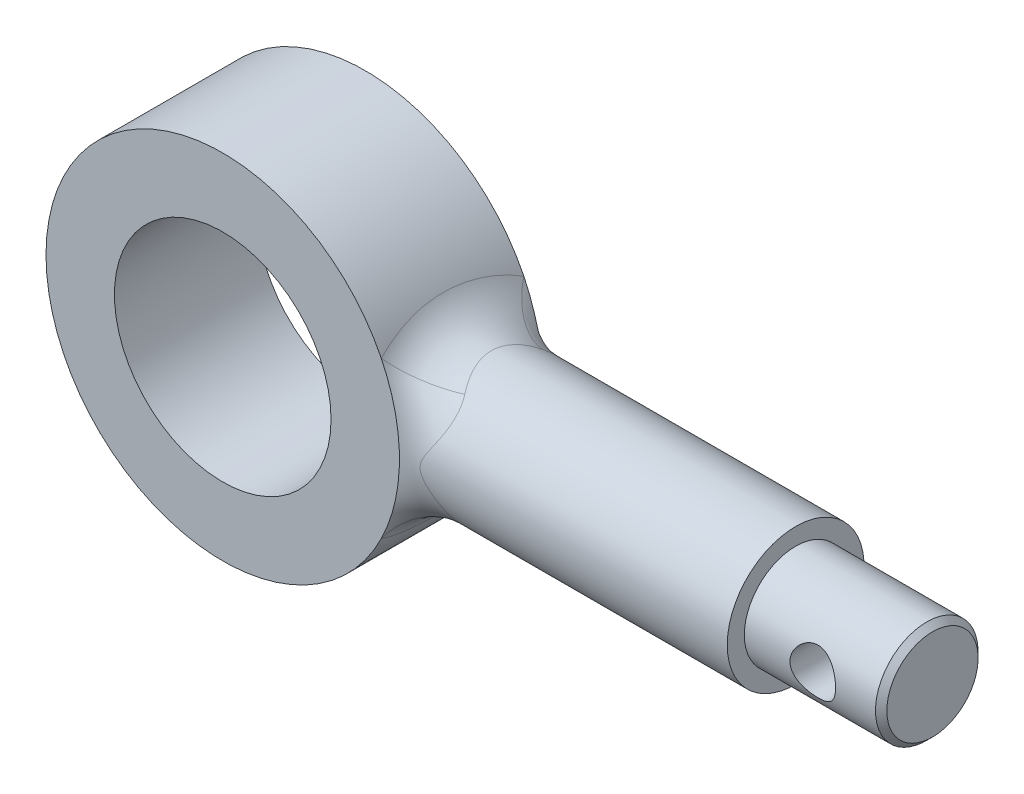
ISO-10303-21;
HEADER;
FILE_DESCRIPTION(('STEP AP214'),'2;1');
FILE_NAME('part.step','',(''),(''),'','','');
FILE_SCHEMA(('AUTOMOTIVE_DESIGN { 1 0 10303 214 1 1 1 1 }'));
ENDSEC;
DATA;
#1=APPLICATION_CONTEXT('core data for automotive mechanical design processes');
#2=APPLICATION_PROTOCOL_DEFINITION('international standard','automotive_design',2000,#1);
#3=PRODUCT_CONTEXT('',#1,'mechanical');
#4=PRODUCT('Part','Part','',(#3));
#5=PRODUCT_RELATED_PRODUCT_CATEGORY('part','',(#4));
#6=PRODUCT_DEFINITION_FORMATION('','',#4);
#7=PRODUCT_DEFINITION_CONTEXT('part definition',#1,'design');
#8=PRODUCT_DEFINITION('design','',#6,#7);
#9=PRODUCT_DEFINITION_SHAPE('','',#8);
#10=(LENGTH_UNIT() NAMED_UNIT(*) SI_UNIT(.MILLI.,.METRE.));
#11=(NAMED_UNIT(*) PLANE_ANGLE_UNIT() SI_UNIT($,.RADIAN.));
#12=(NAMED_UNIT(*) SI_UNIT($,.STERADIAN.) SOLID_ANGLE_UNIT());
#13=UNCERTAINTY_MEASURE_WITH_UNIT(LENGTH_MEASURE(1.E-05),#10,'distance_accuracy_value','');
#14=(GEOMETRIC_REPRESENTATION_CONTEXT(3) GLOBAL_UNCERTAINTY_ASSIGNED_CONTEXT((#13)) GLOBAL_UNIT_ASSIGNED_CONTEXT((#10,
#11,#12)) REPRESENTATION_CONTEXT('',''));
#15=CARTESIAN_POINT('',(0.,0.,0.));
#16=DIRECTION('',(0.,0.,1.));
#17=DIRECTION('',(1.,0.,0.));
#18=AXIS2_PLACEMENT_3D('',#15,#16,#17);
#19=CARTESIAN_POINT('',(-8.88178419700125E-13,0.,12.5000000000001));
#20=DIRECTION('',(0.,0.,-1.));
#21=DIRECTION('',(-1.,0.,0.));
#22=AXIS2_PLACEMENT_3D('',#19,#20,#21);
#23=CYLINDRICAL_SURFACE('',#22,31.);
#24=CARTESIAN_POINT('',(-8.88178419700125E-13,0.,12.5000000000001));
#25=DIRECTION('',(0.,0.,1.));
#26=DIRECTION('',(1.,0.,0.));
#27=AXIS2_PLACEMENT_3D('',#24,#25,#26);
#28=CIRCLE('',#27,31.);
#29=CARTESIAN_POINT('',(27.814218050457,13.6882896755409,12.5000000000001));
#30=VERTEX_POINT('',#29);
#31=CARTESIAN_POINT('',(27.8142180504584,-13.6882896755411,12.5000000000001));
#32=VERTEX_POINT('',#31);
#33=EDGE_CURVE('E101',#30,#32,#28,.T.);
#34=ORIENTED_EDGE('',*,*,#33,.F.);
#35=CARTESIAN_POINT('',(29.4967918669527,9.53620834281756,18.025738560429));
#36=CARTESIAN_POINT('',(30.9232653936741,5.12393134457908,11.0605678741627));
#37=CARTESIAN_POINT('',(39.0118860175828,6.87949340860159,9.83222103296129));
#38=CARTESIAN_POINT('',(29.3789741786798,9.90072126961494,17.6884136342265));
#39=CARTESIAN_POINT('',(30.8927962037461,5.40381018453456,10.934370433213));
#40=CARTESIAN_POINT('',(38.8560626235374,7.14245581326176,9.64822561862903));
#41=CARTESIAN_POINT('',(29.2572364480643,10.2541043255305,17.3325931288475));
#42=CARTESIAN_POINT('',(30.8559715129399,5.68882033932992,10.7907680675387));
#43=CARTESIAN_POINT('',(38.6950546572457,7.39738904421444,9.45414170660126));
#44=CARTESIAN_POINT('',(29.0087886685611,10.9371749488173,16.5860951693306));
#45=CARTESIAN_POINT('',(30.7710092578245,6.25947349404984,10.4687170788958));
#46=CARTESIAN_POINT('',(38.3664624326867,7.89016140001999,9.04696100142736));
#47=CARTESIAN_POINT('',(28.8820795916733,11.2668671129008,16.1954245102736));
#48=CARTESIAN_POINT('',(30.7230079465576,6.54507418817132,10.2906918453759));
#49=CARTESIAN_POINT('',(38.1988794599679,8.12800384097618,8.83386791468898));
#50=CARTESIAN_POINT('',(28.625943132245,11.902667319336,15.3794253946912));
#51=CARTESIAN_POINT('',(30.6166687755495,7.11237119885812,9.89812126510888));
#52=CARTESIAN_POINT('',(37.8601183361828,8.58667495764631,8.38877748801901));
#53=CARTESIAN_POINT('',(28.4965061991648,12.2086644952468,14.9539511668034));
#54=CARTESIAN_POINT('',(30.5583893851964,7.39416122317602,9.68378050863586));
#55=CARTESIAN_POINT('',(37.6889275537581,8.80742365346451,8.1567006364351));
#56=CARTESIAN_POINT('',(28.2384771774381,12.7941685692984,14.0717267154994));
#57=CARTESIAN_POINT('',(30.4339872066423,7.94657003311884,9.21956978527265));
#58=CARTESIAN_POINT('',(37.3476633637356,9.22981075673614,7.67548729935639));
#59=CARTESIAN_POINT('',(28.1098851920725,13.0736722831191,13.6149727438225));
#60=CARTESIAN_POINT('',(30.3679231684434,8.21741826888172,8.96998578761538));
#61=CARTESIAN_POINT('',(37.177590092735,9.43144686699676,7.42634876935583));
#62=CARTESIAN_POINT('',(27.8451643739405,13.6290082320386,12.6290996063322));
#63=CARTESIAN_POINT('',(30.2247102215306,8.76594627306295,8.41239010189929));
#64=CARTESIAN_POINT('',(36.8274754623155,9.83207045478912,6.8885997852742));
#65=CARTESIAN_POINT('',(27.7094159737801,13.9021869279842,12.0971785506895));
#66=CARTESIAN_POINT('',(30.1470364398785,9.0426909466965,8.10107241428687));
#67=CARTESIAN_POINT('',(36.6479372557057,10.0291436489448,6.59846102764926));
#68=CARTESIAN_POINT('',(27.4469632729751,14.4134241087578,11.0009065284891));
#69=CARTESIAN_POINT('',(29.9903834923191,9.56916196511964,7.44002565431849));
#70=CARTESIAN_POINT('',(36.3008223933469,10.3979540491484,6.00049447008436));
#71=CARTESIAN_POINT('',(27.3202583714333,14.6514849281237,10.4365577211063));
#72=CARTESIAN_POINT('',(29.9113403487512,9.81941970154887,7.09035807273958));
#73=CARTESIAN_POINT('',(36.1332449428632,10.5696929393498,5.69266784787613));
#74=CARTESIAN_POINT('',(27.0804445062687,15.0901277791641,9.27902433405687));
#75=CARTESIAN_POINT('',(29.7570366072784,10.2862168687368,6.35656159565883));
#76=CARTESIAN_POINT('',(35.8160717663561,10.8861332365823,5.06128600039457));
#77=CARTESIAN_POINT('',(26.9673176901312,15.2907592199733,8.68587909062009));
#78=CARTESIAN_POINT('',(29.6816460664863,10.5033740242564,5.97234364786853));
#79=CARTESIAN_POINT('',(35.6664524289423,11.0308702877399,4.73775223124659));
#80=CARTESIAN_POINT('',(26.7588813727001,15.6526655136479,7.47364070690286));
#81=CARTESIAN_POINT('',(29.5396731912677,10.8984768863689,5.17361972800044));
#82=CARTESIAN_POINT('',(35.3907785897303,11.2919522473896,4.07653129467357));
#83=CARTESIAN_POINT('',(26.663569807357,15.8139449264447,6.85455058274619));
#84=CARTESIAN_POINT('',(29.4729238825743,11.0769971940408,4.75877145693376));
#85=CARTESIAN_POINT('',(35.2647213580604,11.408300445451,3.73884577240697));
#86=CARTESIAN_POINT('',(26.4999102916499,16.086595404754,5.63215779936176));
#87=CARTESIAN_POINT('',(29.3566400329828,11.38048584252,3.92963589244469));
#88=CARTESIAN_POINT('',(35.0482684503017,11.6049925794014,3.07208607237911));
#89=CARTESIAN_POINT('',(26.4303019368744,16.2003522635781,5.03008358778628));
#90=CARTESIAN_POINT('',(29.3061886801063,11.5083844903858,3.5164278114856));
#91=CARTESIAN_POINT('',(34.9562057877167,11.6870576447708,2.74368195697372));
#92=CARTESIAN_POINT('',(26.3135399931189,16.3893261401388,3.81165831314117));
#93=CARTESIAN_POINT('',(29.220897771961,11.7214178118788,2.67404265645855));
#94=CARTESIAN_POINT('',(34.801778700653,11.8233848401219,2.07908635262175));
#95=CARTESIAN_POINT('',(26.2663853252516,16.4645450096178,3.19530793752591));
#96=CARTESIAN_POINT('',(29.1859297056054,11.8068884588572,2.24427281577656));
#97=CARTESIAN_POINT('',(34.7394128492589,11.8776483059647,1.74289523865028));
#98=CARTESIAN_POINT('',(26.196767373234,16.5750919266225,1.95455843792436));
#99=CARTESIAN_POINT('',(29.134170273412,11.9325378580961,1.37586723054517));
#100=CARTESIAN_POINT('',(34.6473374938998,11.9573976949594,1.0661227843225));
#101=CARTESIAN_POINT('',(26.1742796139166,16.6104595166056,1.33016791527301));
#102=CARTESIAN_POINT('',(29.1172763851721,11.9729693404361,0.936547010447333));
#103=CARTESIAN_POINT('',(34.6175956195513,11.9829121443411,0.725546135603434));
#104=CARTESIAN_POINT('',(26.1550233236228,16.6407668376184,0.079013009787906));
#105=CARTESIAN_POINT('',(29.1028447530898,12.0075452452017,0.0559073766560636));
#106=CARTESIAN_POINT('',(34.5921276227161,12.0047760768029,0.0430980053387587));
#107=CARTESIAN_POINT('',(26.1582514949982,16.6357117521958,-0.547751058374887));
#108=CARTESIAN_POINT('',(29.1052799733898,12.0017543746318,-0.386157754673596));
#109=CARTESIAN_POINT('',(34.596397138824,12.0011292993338,-0.298773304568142));
#110=CARTESIAN_POINT('',(26.1879310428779,16.588936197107,-1.70711381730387));
#111=CARTESIAN_POINT('',(29.1274937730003,11.948427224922,-1.20147700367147));
#112=CARTESIAN_POINT('',(34.6356507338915,11.9673850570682,-0.931152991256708));
#113=CARTESIAN_POINT('',(26.2109686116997,16.5526046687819,-2.24026598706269));
#114=CARTESIAN_POINT('',(29.14475052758,11.9069596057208,-1.57602140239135));
#115=CARTESIAN_POINT('',(34.666119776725,11.9411752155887,-1.22196326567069));
#116=CARTESIAN_POINT('',(26.2749027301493,16.4509301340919,-3.29975083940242));
#117=CARTESIAN_POINT('',(29.1922196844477,11.7914680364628,-2.31683933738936));
#118=CARTESIAN_POINT('',(34.7506778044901,11.8678264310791,-1.7998640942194));
#119=CARTESIAN_POINT('',(26.3157972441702,16.3855904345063,-3.82608429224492));
#120=CARTESIAN_POINT('',(29.2224868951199,11.7173086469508,-2.68354309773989));
#121=CARTESIAN_POINT('',(34.8047640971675,11.8206898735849,-2.08695506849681));
#122=CARTESIAN_POINT('',(26.4140679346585,16.2266974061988,-4.86861155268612));
#123=CARTESIAN_POINT('',(29.2943360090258,11.5381101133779,-3.40476733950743));
#124=CARTESIAN_POINT('',(34.9347350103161,11.70606323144,-2.65560630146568));
#125=CARTESIAN_POINT('',(26.4714483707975,16.1331367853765,-5.3848027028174));
#126=CARTESIAN_POINT('',(29.3359997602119,11.432857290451,-3.75965824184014));
#127=CARTESIAN_POINT('',(35.0106252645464,11.6385678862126,-2.93716511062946));
#128=CARTESIAN_POINT('',(26.6008593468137,15.9188546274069,-6.40392063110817));
#129=CARTESIAN_POINT('',(29.4284868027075,11.1937230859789,-4.45365794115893));
#130=CARTESIAN_POINT('',(35.1817817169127,11.4839831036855,-3.49304761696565));
#131=CARTESIAN_POINT('',(26.6728907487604,15.7981314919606,-6.90684662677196));
#132=CARTESIAN_POINT('',(29.4794011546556,11.0595838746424,-4.79306753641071));
#133=CARTESIAN_POINT('',(35.277049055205,11.3968925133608,-3.76737088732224));
#134=CARTESIAN_POINT('',(26.8309316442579,15.5282311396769,-7.90595936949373));
#135=CARTESIAN_POINT('',(29.5889155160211,10.7626021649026,-5.45916375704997));
#136=CARTESIAN_POINT('',(35.4860708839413,11.2021843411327,-4.31234147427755));
#137=CARTESIAN_POINT('',(26.9171720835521,15.3785751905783,-8.40185598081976));
#138=CARTESIAN_POINT('',(29.647727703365,10.5989940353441,-5.7857017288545));
#139=CARTESIAN_POINT('',(35.6001308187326,11.0942213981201,-4.58283053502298));
#140=CARTESIAN_POINT('',(27.1002882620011,15.0535456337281,-9.37518856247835));
#141=CARTESIAN_POINT('',(29.7695618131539,10.2479046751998,-6.41682802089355));
#142=CARTESIAN_POINT('',(35.8423167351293,10.8597425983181,-5.11373921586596));
#143=CARTESIAN_POINT('',(27.1971683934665,14.8781613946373,-9.8526167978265));
#144=CARTESIAN_POINT('',(29.832668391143,10.0600963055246,-6.72154487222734));
#145=CARTESIAN_POINT('',(35.9704485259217,10.733219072,-5.37415461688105));
#146=CARTESIAN_POINT('',(27.5002354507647,14.3149721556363,-11.2548618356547));
#147=CARTESIAN_POINT('',(30.0248138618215,9.46332229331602,-7.60284708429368));
#148=CARTESIAN_POINT('',(36.3712791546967,10.3269300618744,-6.13901554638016));
#149=CARTESIAN_POINT('',(27.7188651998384,13.8901041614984,-12.1497360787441));
#150=CARTESIAN_POINT('',(30.1556163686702,9.02354001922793,-8.14028356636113));
#151=CARTESIAN_POINT('',(36.6604346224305,10.0204270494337,-6.62712876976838));
#152=CARTESIAN_POINT('',(28.0738179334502,13.1510689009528,-13.4847065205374));
#153=CARTESIAN_POINT('',(30.3490687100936,8.29286877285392,-8.89798590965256));
#154=CARTESIAN_POINT('',(37.1298882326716,9.48728137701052,-7.35529446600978));
#155=CARTESIAN_POINT('',(28.2056541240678,12.8665403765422,-13.9565141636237));
#156=CARTESIAN_POINT('',(30.4174891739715,8.01597941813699,-9.15742364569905));
#157=CARTESIAN_POINT('',(37.3042522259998,9.2820203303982,-7.61264408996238));
#158=CARTESIAN_POINT('',(28.4705259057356,12.2693028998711,-14.867512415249));
#159=CARTESIAN_POINT('',(30.5464391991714,7.45033772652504,-9.63966030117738));
#160=CARTESIAN_POINT('',(37.6545665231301,8.85116866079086,-8.10955222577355));
#161=CARTESIAN_POINT('',(28.6035615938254,11.9565916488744,-15.3067003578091));
#162=CARTESIAN_POINT('',(30.6069079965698,7.16132426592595,-9.86215104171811));
#163=CARTESIAN_POINT('',(37.8305169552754,8.62557637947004,-8.34910928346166));
#164=CARTESIAN_POINT('',(28.8673109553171,11.3049390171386,-16.1496086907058));
#165=CARTESIAN_POINT('',(30.7173166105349,6.57815295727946,-10.2696361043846));
#166=CARTESIAN_POINT('',(38.1793467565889,8.15546920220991,-8.80887746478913));
#167=CARTESIAN_POINT('',(28.9980274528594,10.9660326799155,-16.553374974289));
#168=CARTESIAN_POINT('',(30.7671581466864,6.28388016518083,-10.4542819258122));
#169=CARTESIAN_POINT('',(38.3522298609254,7.91097958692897,-9.0291136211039));
#170=CARTESIAN_POINT('',(29.254213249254,10.2631089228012,-17.3238730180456));
#171=CARTESIAN_POINT('',(30.8551373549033,5.69585643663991,-10.7874348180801));
#172=CARTESIAN_POINT('',(38.6910562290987,7.40388502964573,-9.4493852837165));
#173=CARTESIAN_POINT('',(29.3796825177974,9.89909135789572,-17.6906045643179));
#174=CARTESIAN_POINT('',(30.8931289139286,5.40214792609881,-10.9354869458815));
#175=CARTESIAN_POINT('',(38.8569994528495,7.14127998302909,-9.649420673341));
#176=CARTESIAN_POINT('',(29.5009751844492,9.52325906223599,-18.0377096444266));
#177=CARTESIAN_POINT('',(30.9243581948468,5.11392958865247,-11.0650763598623));
#178=CARTESIAN_POINT('',(39.0174187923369,6.87015169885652,-9.83875071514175));
#179=(BOUNDED_SURFACE() B_SPLINE_SURFACE(3,2,((#35,#36,#37),(#38,#39,#40),(#41,#42,#43),(#44,
#45,#46),(#47,#48,#49),(#50,#51,#52),(#53,#54,#55),(#56,#57,#58),(#59,#60,#61),(#62,#63,#64),
(#65,#66,#67),(#68,#69,#70),(#71,#72,#73),(#74,#75,#76),(#77,#78,#79),(#80,#81,#82),(#83,#84,
#85),(#86,#87,#88),(#89,#90,#91),(#92,#93,#94),(#95,#96,#97),(#98,#99,#100),(#101,#102,#103),
(#104,#105,#106),(#107,#108,#109),(#110,#111,#112),(#113,#114,#115),(#116,#117,#118),(#119,#120,
#121),(#122,#123,#124),(#125,#126,#127),(#128,#129,#130),(#131,#132,#133),(#134,#135,#136),
(#137,#138,#139),(#140,#141,#142),(#143,#144,#145),(#146,#147,#148),(#149,#150,#151),(#152,#153,
#154),(#155,#156,#157),(#158,#159,#160),(#161,#162,#163),(#164,#165,#166),(#167,#168,#169),
(#170,#171,#172),(#173,#174,#175),(#176,#177,#178)),.UNSPECIFIED.,.F.,.F.,
.F.) B_SPLINE_SURFACE_WITH_KNOTS((4,2,2,2,2,2,2,2,2,2,2,2,2,2,2,2,2,2,2,2,2,2,2,4),(3,3),(0.,
1.8254345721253,3.65051399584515,5.48367291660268,7.31705189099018,9.31743179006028,
11.3176786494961,13.3152660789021,15.3126219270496,17.1919645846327,19.0712169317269,
20.9486029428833,22.825748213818,24.4323726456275,26.0388139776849,27.6456707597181,
29.2526221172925,30.8888771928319,32.5258103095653,35.7993632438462,37.682378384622,
39.5655472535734,41.4462390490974,43.3269417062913),(0.,1.),
.UNSPECIFIED.) GEOMETRIC_REPRESENTATION_ITEM() RATIONAL_B_SPLINE_SURFACE(((1.,0.766927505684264,
1.),(1.,0.771323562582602,1.),(1.,0.775797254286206,1.),(1.,0.78479039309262,1.),(1.,
0.789309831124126,1.),(1.,0.798306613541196,1.),(1.,0.802783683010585,1.),(1.,0.811576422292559,
1.),(1.,0.815892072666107,1.),(1.,0.824650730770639,1.),(1.,0.829069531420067,1.),(1.,
0.83749192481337,1.),(1.,0.841495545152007,1.),(1.,0.848978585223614,1.),(1.,0.852458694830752,
1.),(1.,0.858804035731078,1.),(1.,0.861669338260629,1.),(1.,0.866550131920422,1.),(1.,
0.868605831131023,1.),(1.,0.872036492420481,1.),(1.,0.873411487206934,1.),(1.,0.875436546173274,
1.),(1.,0.876087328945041,1.),(1.,0.876644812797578,1.),(1.,0.876551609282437,1.),(1.,
0.875691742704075,1.),(1.,0.875024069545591,1.),(1.,0.873162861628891,1.),(1.,0.871969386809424,
1.),(1.,0.869083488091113,1.),(1.,0.867390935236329,1.),(1.,0.86354353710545,1.),(1.,
0.861388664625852,1.),(1.,0.856616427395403,1.),(1.,0.853991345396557,1.),(1.,0.848357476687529,
1.),(1.,0.845348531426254,1.),(1.,0.835822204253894,1.),(1.,0.828804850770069,1.),(1.,
0.817096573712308,1.),(1.,0.812683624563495,1.),(1.,0.803678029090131,1.),(1.,0.799085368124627,
1.),(1.,0.789834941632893,1.),(1.,0.785177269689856,1.),(1.,0.775909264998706,1.),(1.,
0.77129893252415,1.),(1.,0.766771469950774,1.))) REPRESENTATION_ITEM('') SURFACE());
#180=CARTESIAN_POINT('',(31.0000000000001,-1.38777878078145E-13,21.9999999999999));
#181=CARTESIAN_POINT('',(31.0000020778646,0.0675284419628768,22.0000042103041));
#182=CARTESIAN_POINT('',(30.999786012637,0.13505143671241,21.999469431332));
#183=CARTESIAN_POINT('',(30.9901372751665,1.58965976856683,21.9757536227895));
#184=CARTESIAN_POINT('',(30.8831120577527,2.9863147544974,21.7142581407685));
#185=CARTESIAN_POINT('',(30.661577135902,4.57857218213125,21.1542727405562));
#186=CARTESIAN_POINT('',(30.6170963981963,4.86642194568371,21.041377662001));
#187=CARTESIAN_POINT('',(30.2954718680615,6.77163165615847,20.2194699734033));
#188=CARTESIAN_POINT('',(29.9113232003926,8.24992751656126,19.2124186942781));
#189=CARTESIAN_POINT('',(29.0043427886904,11.0642660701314,16.6160030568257));
#190=CARTESIAN_POINT('',(28.4690157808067,12.3213400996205,14.9527640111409));
#191=CARTESIAN_POINT('',(27.409312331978,14.5420957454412,11.0055246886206));
#192=CARTESIAN_POINT('',(26.9045979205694,15.4109710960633,8.66364386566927));
#193=CARTESIAN_POINT('',(26.2578467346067,16.4912768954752,3.81543771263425));
#194=CARTESIAN_POINT('',(26.1114847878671,16.7105545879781,1.31145176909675));
#195=CARTESIAN_POINT('',(26.2276355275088,16.5253933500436,-3.28561602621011));
#196=CARTESIAN_POINT('',(26.4323831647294,16.2091608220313,-5.38424687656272));
#197=CARTESIAN_POINT('',(27.0608411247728,15.1353095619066,-9.36149770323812));
#198=CARTESIAN_POINT('',(27.4780839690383,14.3906481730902,-11.2447096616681));
#199=CARTESIAN_POINT('',(28.4417089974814,12.3859261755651,-14.8677537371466));
#200=CARTESIAN_POINT('',(28.9948959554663,11.0945320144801,-16.5893876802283));
#201=CARTESIAN_POINT('',(29.8497497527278,8.44038504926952,-19.0358495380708));
#202=CARTESIAN_POINT('',(30.1761502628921,7.22458116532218,-19.9041785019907));
#203=CARTESIAN_POINT('',(30.5422237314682,5.33943791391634,-20.8512455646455));
#204=CARTESIAN_POINT('',(30.6384434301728,4.76171368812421,-21.0959491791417));
#205=CARTESIAN_POINT('',(30.8977641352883,2.83919829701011,-21.7507884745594));
#206=CARTESIAN_POINT('',(30.9989089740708,1.41976453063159,-21.997665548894));
#207=CARTESIAN_POINT('',(31.0003346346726,-0.425543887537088,-22.0007153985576));
#208=CARTESIAN_POINT('',(30.9911515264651,-0.859679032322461,-21.9781684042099));
#209=CARTESIAN_POINT('',(30.9418571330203,-2.03793308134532,-21.8565317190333));
#210=CARTESIAN_POINT('',(30.8840679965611,-2.77710107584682,-21.713596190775));
#211=CARTESIAN_POINT('',(30.5969522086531,-5.29956502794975,-20.9944046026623));
#212=CARTESIAN_POINT('',(30.2403475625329,-6.98425383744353,-20.089766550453));
#213=CARTESIAN_POINT('',(29.8192775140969,-8.47424083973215,-18.9311426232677));
#214=CARTESIAN_POINT('',(29.8074065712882,-8.51589390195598,-18.8984143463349));
#215=CARTESIAN_POINT('',(29.3374932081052,-10.1518937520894,-17.6001724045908));
#216=CARTESIAN_POINT('',(28.8110742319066,-11.5053959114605,-16.0455537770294));
#217=CARTESIAN_POINT('',(27.7365749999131,-13.9193286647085,-12.3348773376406));
#218=CARTESIAN_POINT('',(27.2001084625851,-14.8904255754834,-10.1214655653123));
#219=CARTESIAN_POINT('',(26.4142345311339,-16.2464446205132,-5.37451571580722));
#220=CARTESIAN_POINT('',(26.1767530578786,-16.6072006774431,-2.83189774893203));
#221=CARTESIAN_POINT('',(26.1458881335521,-16.6545966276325,1.89263731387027));
#222=CARTESIAN_POINT('',(26.2935420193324,-16.4307329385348,4.07383387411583));
#223=CARTESIAN_POINT('',(26.8356161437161,-15.5270007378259,8.15515924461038));
#224=CARTESIAN_POINT('',(27.2134821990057,-14.8775186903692,10.0643425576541));
#225=CARTESIAN_POINT('',(28.1195629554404,-13.0914187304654,13.7616602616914));
#226=CARTESIAN_POINT('',(28.6558238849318,-11.9263966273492,15.5343288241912));
#227=CARTESIAN_POINT('',(29.692847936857,-9.03623992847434,18.6319705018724));
#228=CARTESIAN_POINT('',(30.1934508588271,-7.30875072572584,19.955012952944));
#229=CARTESIAN_POINT('',(30.7543802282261,-4.09058975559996,21.3943465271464));
#230=CARTESIAN_POINT('',(30.9086352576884,-2.74254574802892,21.7745839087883));
#231=CARTESIAN_POINT('',(30.9899694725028,-0.914779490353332,21.9752290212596));
#232=CARTESIAN_POINT('',(30.9999859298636,-0.457264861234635,21.9999714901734));
#233=CARTESIAN_POINT('',(31.0000000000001,-1.38777878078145E-13,21.9999999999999));
#234=B_SPLINE_CURVE_WITH_KNOTS('',3,(#180,#181,#182,#183,#184,#185,#186,#187,#188,#189,#190,
#191,#192,#193,#194,#195,#196,#197,#198,#199,#200,#201,#202,#203,#204,#205,#206,#207,#208,#209,
#210,#211,#212,#213,#214,#215,#216,#217,#218,#219,#220,#221,#222,#223,#224,#225,#226,#227,#228,
#229,#230,#231,#232,#233),.UNSPECIFIED.,.T.,.F.,(4,2,2,2,2,2,2,2,2,2,2,2,2,2,2,2,2,2,2,2,2,2,2,
2,2,2,4),(0.,0.202604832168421,4.36312738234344,5.30052983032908,10.6634982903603,
17.0345218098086,24.5631153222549,32.0003836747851,38.3276233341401,44.4728708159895,
51.0319891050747,55.5523359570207,57.4531430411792,61.6767565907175,62.9795157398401,
65.2328400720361,70.8693571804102,71.0322505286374,77.2924527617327,84.6201715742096,
92.2317690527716,98.7485734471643,104.844468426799,111.328808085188,117.840649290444,
121.982538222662,123.354464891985),.UNSPECIFIED.);
#235=CARTESIAN_POINT('',(27.8142180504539,13.6882896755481,-12.5000000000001));
#236=VERTEX_POINT('',#235);
#237=EDGE_CURVE('E178',#30,#236,#234,.T.);
#238=ORIENTED_EDGE('',*,*,#237,.T.);
#239=CARTESIAN_POINT('',(-8.88178419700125E-13,0.,-12.4999999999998));
#240=DIRECTION('',(0.,0.,1.));
#241=DIRECTION('',(1.,0.,0.));
#242=AXIS2_PLACEMENT_3D('',#239,#240,#241);
#243=CIRCLE('',#242,31.);
#244=CARTESIAN_POINT('',(27.8142180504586,-13.688289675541,-12.5000000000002));
#245=VERTEX_POINT('',#244);
#246=EDGE_CURVE('E317',#236,#245,#243,.T.);
#247=ORIENTED_EDGE('',*,*,#246,.T.);
#248=CARTESIAN_POINT('',(29.7954893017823,-8.5573837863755,-18.8654901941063));
#249=CARTESIAN_POINT('',(30.9906838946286,-4.39590072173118,-11.3566061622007));
#250=CARTESIAN_POINT('',(39.406937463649,-6.17336191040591,-10.2902673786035));
#251=CARTESIAN_POINT('',(29.6852797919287,-8.94123219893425,-18.560932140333));
#252=CARTESIAN_POINT('',(30.9702224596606,-4.66850735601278,-11.2578088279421));
#253=CARTESIAN_POINT('',(39.2611764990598,-6.45027308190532,-10.124144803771));
#254=CARTESIAN_POINT('',(29.5699765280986,-9.31463190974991,-18.2367897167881));
#255=CARTESIAN_POINT('',(30.9436755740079,-4.94856669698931,-11.1429417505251));
#256=CARTESIAN_POINT('',(39.1086786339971,-6.71964648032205,-9.94733984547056));
#257=CARTESIAN_POINT('',(29.3319825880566,-10.0389003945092,-17.5516678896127));
#258=CARTESIAN_POINT('',(30.8787623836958,-5.5144479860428,-10.8796116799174));
#259=CARTESIAN_POINT('',(38.7939124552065,-7.24213928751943,-9.57363703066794));
#260=CARTESIAN_POINT('',(29.2092944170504,-10.3897767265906,-17.1907009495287));
#261=CARTESIAN_POINT('',(30.840546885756,-5.80009335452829,-10.7315925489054));
#262=CARTESIAN_POINT('',(38.6316474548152,-7.49526414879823,-9.37674597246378));
#263=CARTESIAN_POINT('',(28.9589720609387,-11.0683866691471,-16.4332042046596));
#264=CARTESIAN_POINT('',(30.75257075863,-6.37214186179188,-10.3998257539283));
#265=CARTESIAN_POINT('',(38.300575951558,-7.98481853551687,-8.96356592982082));
#266=CARTESIAN_POINT('',(28.8313273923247,-11.3960665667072,-16.0365963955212));
#267=CARTESIAN_POINT('',(30.7029178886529,-6.65852909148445,-10.2164124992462));
#268=CARTESIAN_POINT('',(38.1317555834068,-8.22120931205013,-8.74723439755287));
#269=CARTESIAN_POINT('',(28.5742569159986,-12.0261214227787,-15.2104848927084));
#270=CARTESIAN_POINT('',(30.5937504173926,-7.22528634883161,-9.81370699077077));
#271=CARTESIAN_POINT('',(37.7917591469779,-8.67573568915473,-8.29662812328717));
#272=CARTESIAN_POINT('',(28.4448308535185,-12.3284927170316,-14.7809764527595));
#273=CARTESIAN_POINT('',(30.5343341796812,-7.50577712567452,-9.59477207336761));
#274=CARTESIAN_POINT('',(37.6205827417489,-8.89386864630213,-8.06235079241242));
#275=CARTESIAN_POINT('',(28.1771844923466,-12.9291395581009,-13.8562544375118));
#276=CARTESIAN_POINT('',(30.4031286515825,-8.07602256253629,-9.10324079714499));
#277=CARTESIAN_POINT('',(37.2665988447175,-9.3271798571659,-7.55795696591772));
#278=CARTESIAN_POINT('',(28.0390660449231,-13.2252543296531,-13.3585290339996));
#279=CARTESIAN_POINT('',(30.3307402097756,-8.36534620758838,-8.8279015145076));
#280=CARTESIAN_POINT('',(37.0839260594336,-9.54079931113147,-7.28647038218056));
#281=CARTESIAN_POINT('',(27.7681984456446,-13.7849146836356,-12.3291764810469));
#282=CARTESIAN_POINT('',(30.1810357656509,-8.92321526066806,-8.23756712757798));
#283=CARTESIAN_POINT('',(36.7256818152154,-9.94454255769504,-6.72500535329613));
#284=CARTESIAN_POINT('',(27.6354520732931,-14.0484435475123,-11.7975321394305));
#285=CARTESIAN_POINT('',(30.1037121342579,-9.19218886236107,-7.92274850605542));
#286=CARTESIAN_POINT('',(36.5501140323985,-10.134654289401,-6.43501753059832));
#287=CARTESIAN_POINT('',(27.3795712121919,-14.5408413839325,-10.7031404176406));
#288=CARTESIAN_POINT('',(29.948658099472,-9.70257632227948,-7.25622055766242));
#289=CARTESIAN_POINT('',(36.2116909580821,-10.4898738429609,-5.83807659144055));
#290=CARTESIAN_POINT('',(27.2564346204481,-14.7697179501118,-10.1403998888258));
#291=CARTESIAN_POINT('',(29.8708542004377,-9.94451817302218,-6.90454316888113));
#292=CARTESIAN_POINT('',(36.0488328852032,-10.6549871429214,-5.53112721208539));
#293=CARTESIAN_POINT('',(27.0240736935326,-15.1906962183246,-8.98691856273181));
#294=CARTESIAN_POINT('',(29.7197279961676,-10.3946664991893,-6.16799157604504));
#295=CARTESIAN_POINT('',(35.7415168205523,-10.9586840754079,-4.90195557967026));
#296=CARTESIAN_POINT('',(26.914840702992,-15.3828208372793,-8.39619550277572));
#297=CARTESIAN_POINT('',(29.6462734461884,-10.6034517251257,-5.78297188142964));
#298=CARTESIAN_POINT('',(35.597047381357,-11.0972842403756,-4.57974300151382));
#299=CARTESIAN_POINT('',(26.7163949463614,-15.7249045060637,-7.20178112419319));
#300=CARTESIAN_POINT('',(29.51007381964,-10.9782201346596,-4.99188016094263));
#301=CARTESIAN_POINT('',(35.3345868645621,-11.3440660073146,-3.92824424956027));
#302=CARTESIAN_POINT('',(26.626832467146,-15.8756146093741,-6.5985692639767));
#303=CARTESIAN_POINT('',(29.4470004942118,-11.1454542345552,-4.58607263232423));
#304=CARTESIAN_POINT('',(35.2161332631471,-11.452789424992,-3.59921959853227));
#305=CARTESIAN_POINT('',(26.4688157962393,-16.1376972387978,-5.37258755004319));
#306=CARTESIAN_POINT('',(29.3342544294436,-11.4377139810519,-3.75213116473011));
#307=CARTESIAN_POINT('',(35.0071434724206,-11.6418578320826,-2.9305023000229));
#308=CARTESIAN_POINT('',(26.4003612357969,-16.2490704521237,-4.74981803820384));
#309=CARTESIAN_POINT('',(29.2844223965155,-11.5631930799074,-3.32347781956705));
#310=CARTESIAN_POINT('',(34.9166067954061,-11.7222033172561,-2.59080983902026));
#311=CARTESIAN_POINT('',(26.2878159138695,-16.4305254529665,-3.49096429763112));
#312=CARTESIAN_POINT('',(29.2019165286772,-11.7680918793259,-2.45097651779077));
#313=CARTESIAN_POINT('',(34.7677565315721,-11.8531063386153,-1.90416234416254));
#314=CARTESIAN_POINT('',(26.2436894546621,-16.5006677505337,-2.85490100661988));
#315=CARTESIAN_POINT('',(29.1690845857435,-11.8479222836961,-2.00648605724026));
#316=CARTESIAN_POINT('',(34.7093957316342,-11.9037075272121,-1.55721873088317));
#317=CARTESIAN_POINT('',(26.1818666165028,-16.5985931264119,-1.5749006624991));
#318=CARTESIAN_POINT('',(29.1230173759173,-11.9593414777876,-1.10917872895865));
#319=CARTESIAN_POINT('',(34.6276300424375,-11.974351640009,-0.85903672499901));
#320=CARTESIAN_POINT('',(26.1641655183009,-16.6263837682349,-0.930965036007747));
#321=CARTESIAN_POINT('',(29.1096978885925,-11.9911358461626,-0.655590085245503));
#322=CARTESIAN_POINT('',(34.6042189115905,-11.9944000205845,-0.507799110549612));
#323=CARTESIAN_POINT('',(26.1566838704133,-16.6381433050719,0.262139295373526));
#324=CARTESIAN_POINT('',(29.1040818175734,-12.0045643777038,0.184524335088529));
#325=CARTESIAN_POINT('',(34.5943238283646,-12.0028834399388,0.142985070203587));
#326=CARTESIAN_POINT('',(26.1631484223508,-16.6280053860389,0.811184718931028));
#327=CARTESIAN_POINT('',(29.1089495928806,-11.9929640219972,0.571543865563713));
#328=CARTESIAN_POINT('',(34.6028737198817,-11.9955698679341,0.442464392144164));
#329=CARTESIAN_POINT('',(26.1956187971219,-16.5768059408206,1.90568141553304));
#330=CARTESIAN_POINT('',(29.1332454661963,-11.9345957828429,1.34097351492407));
#331=CARTESIAN_POINT('',(34.6458184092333,-11.958634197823,1.03946259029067));
#332=CARTESIAN_POINT('',(26.2216224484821,-16.5357478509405,2.45113308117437));
#333=CARTESIAN_POINT('',(29.1527033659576,-11.8877561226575,1.72387830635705));
#334=CARTESIAN_POINT('',(34.6802103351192,-11.9290145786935,1.33698168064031));
#335=CARTESIAN_POINT('',(26.2922095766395,-16.4232789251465,3.53445429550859));
#336=CARTESIAN_POINT('',(29.2050199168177,-11.7601085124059,2.48045455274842));
#337=CARTESIAN_POINT('',(34.7735675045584,-11.8478786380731,1.92788416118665));
#338=CARTESIAN_POINT('',(26.3367959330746,-16.3518633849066,4.07232265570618));
#339=CARTESIAN_POINT('',(29.2379452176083,-11.6791347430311,2.85457894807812));
#340=CARTESIAN_POINT('',(34.8325365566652,-11.7963589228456,2.22126690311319));
#341=CARTESIAN_POINT('',(26.4429666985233,-16.1796084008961,5.13673728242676));
#342=CARTESIAN_POINT('',(29.315321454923,-11.4851564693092,3.58930014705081));
#343=CARTESIAN_POINT('',(34.972955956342,-11.6720928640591,2.80185669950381));
#344=CARTESIAN_POINT('',(26.5045517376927,-16.0787678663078,5.66328312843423));
#345=CARTESIAN_POINT('',(29.3598605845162,-11.3719194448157,3.95028648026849));
#346=CARTESIAN_POINT('',(35.0544071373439,-11.5993457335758,3.0890635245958));
#347=CARTESIAN_POINT('',(26.6408940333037,-15.8518069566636,6.68836012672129));
#348=CARTESIAN_POINT('',(29.4567866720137,-11.1192579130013,4.64579496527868));
#349=CARTESIAN_POINT('',(35.2347308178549,-11.4356144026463,3.64819643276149));
#350=CARTESIAN_POINT('',(26.7152656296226,-15.7264149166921,7.18726377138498));
#351=CARTESIAN_POINT('',(29.5090362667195,-10.9803134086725,4.98109285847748));
#352=CARTESIAN_POINT('',(35.333093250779,-11.345155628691,3.92032569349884));
#353=CARTESIAN_POINT('',(26.8760839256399,-15.4499744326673,8.16903353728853));
#354=CARTESIAN_POINT('',(29.6197354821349,-10.6770798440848,5.63262111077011));
#355=CARTESIAN_POINT('',(35.5457884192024,-11.1457293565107,4.45583647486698));
#356=CARTESIAN_POINT('',(26.9625354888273,-15.2989156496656,8.6518931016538));
#357=CARTESIAN_POINT('',(29.6782757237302,-10.5124913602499,5.94904467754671));
#358=CARTESIAN_POINT('',(35.66012758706,-11.03675439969,4.7192144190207));
#359=CARTESIAN_POINT('',(27.2367866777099,-14.80869754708,10.0739704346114));
#360=CARTESIAN_POINT('',(29.8598969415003,-9.98301486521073,6.86926897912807));
#361=CARTESIAN_POINT('',(36.0228469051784,-10.6831073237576,5.49489296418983));
#362=CARTESIAN_POINT('',(27.4394685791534,-14.4325191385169,10.9865855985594));
#363=CARTESIAN_POINT('',(29.9882262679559,-9.58409677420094,7.43854248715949));
#364=CARTESIAN_POINT('',(36.2909100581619,-10.4117293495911,5.99268305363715));
#365=CARTESIAN_POINT('',(27.7741318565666,-13.7720752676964,12.3520552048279));
#366=CARTESIAN_POINT('',(30.1840782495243,-8.91114557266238,8.25033005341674));
#367=CARTESIAN_POINT('',(36.7335292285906,-9.93528010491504,6.73748465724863));
#368=CARTESIAN_POINT('',(27.8991117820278,-13.5176789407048,12.8340937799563));
#369=CARTESIAN_POINT('',(30.2545028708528,-8.65512409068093,8.52975024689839));
#370=CARTESIAN_POINT('',(36.8988252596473,-9.75175665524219,7.00041478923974));
#371=CARTESIAN_POINT('',(28.1527549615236,-12.9811556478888,13.7688873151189));
#372=CARTESIAN_POINT('',(30.3901971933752,-8.12744648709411,9.05476631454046));
#373=CARTESIAN_POINT('',(37.2342888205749,-9.36470466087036,7.51030217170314));
#374=CARTESIAN_POINT('',(28.281418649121,-12.6990254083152,14.2216388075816));
#375=CARTESIAN_POINT('',(30.4554534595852,-7.85546747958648,9.30016428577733));
#376=CARTESIAN_POINT('',(37.4044569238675,-9.1611737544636,7.75725753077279));
#377=CARTESIAN_POINT('',(28.5389574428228,-12.1091357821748,15.0947697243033));
#378=CARTESIAN_POINT('',(30.5777832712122,-7.30210510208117,9.75543493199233));
#379=CARTESIAN_POINT('',(37.7450727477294,-8.73562288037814,8.23351075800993));
#380=CARTESIAN_POINT('',(28.6678314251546,-11.8014353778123,15.5152195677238));
#381=CARTESIAN_POINT('',(30.6348109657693,-7.02052262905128,9.96509254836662));
#382=CARTESIAN_POINT('',(37.9155189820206,-8.51364546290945,8.46284703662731));
#383=CARTESIAN_POINT('',(28.9231140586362,-11.1612081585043,16.3229063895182));
#384=CARTESIAN_POINT('',(30.7389773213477,-6.45290757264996,10.349679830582));
#385=CARTESIAN_POINT('',(38.2531508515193,-8.05178066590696,8.9034034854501));
#386=CARTESIAN_POINT('',(29.0495230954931,-10.8286852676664,16.7101485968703));
#387=CARTESIAN_POINT('',(30.7860107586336,-6.16678793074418,10.5242411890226));
#388=CARTESIAN_POINT('',(38.4203369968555,-7.81189611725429,9.11462650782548));
#389=CARTESIAN_POINT('',(29.1732386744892,-10.4843762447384,17.0798721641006));
#390=CARTESIAN_POINT('',(30.8268171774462,-5.88322123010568,10.680449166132));
#391=CARTESIAN_POINT('',(38.5839608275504,-7.56350896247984,9.31629390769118));
#392=(BOUNDED_SURFACE() B_SPLINE_SURFACE(3,2,((#248,#249,#250),(#251,#252,#253),(#254,#255,
#256),(#257,#258,#259),(#260,#261,#262),(#263,#264,#265),(#266,#267,#268),(#269,#270,#271),
(#272,#273,#274),(#275,#276,#277),(#278,#279,#280),(#281,#282,#283),(#284,#285,#286),(#287,#288,
#289),(#290,#291,#292),(#293,#294,#295),(#296,#297,#298),(#299,#300,#301),(#302,#303,#304),
(#305,#306,#307),(#308,#309,#310),(#311,#312,#313),(#314,#315,#316),(#317,#318,#319),(#320,#321,
#322),(#323,#324,#325),(#326,#327,#328),(#329,#330,#331),(#332,#333,#334),(#335,#336,#337),
(#338,#339,#340),(#341,#342,#343),(#344,#345,#346),(#347,#348,#349),(#350,#351,#352),(#353,#354,
#355),(#356,#357,#358),(#359,#360,#361),(#362,#363,#364),(#365,#366,#367),(#368,#369,#370),
(#371,#372,#373),(#374,#375,#376),(#377,#378,#379),(#380,#381,#382),(#383,#384,#385),(#386,#387,
#388),(#389,#390,#391)),.UNSPECIFIED.,.F.,.F.,.F.) B_SPLINE_SURFACE_WITH_KNOTS((4,2,2,2,2,2,2,2,
2,2,2,2,2,2,2,2,2,2,2,2,2,2,2,4),(3,3),(0.,1.8284243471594,3.65623189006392,5.48814205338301,
7.32031698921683,9.29546160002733,11.2716154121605,13.2473355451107,15.2218196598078,
17.1576942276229,19.0935349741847,21.0265275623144,22.9591749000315,24.6049054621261,
26.2504531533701,27.8962559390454,29.5421197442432,31.145035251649,32.7485979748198,
35.956042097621,37.7865547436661,39.6172837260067,41.4439011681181,43.2702304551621),(0.,1.),
.UNSPECIFIED.) GEOMETRIC_REPRESENTATION_ITEM() RATIONAL_B_SPLINE_SURFACE(((1.,0.755648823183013,
1.),(1.,0.759864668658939,1.),(1.,0.7642123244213,1.),(1.,0.773053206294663,1.),(1.,
0.777546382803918,1.),(1.,0.786573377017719,1.),(1.,0.791107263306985,1.),(1.,0.800099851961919,
1.),(1.,0.804558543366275,1.),(1.,0.813642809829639,1.),(1.,0.818254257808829,1.),(1.,
0.827162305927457,1.),(1.,0.831458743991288,1.),(1.,0.839627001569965,1.),(1.,0.843498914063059,
1.),(1.,0.850717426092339,1.),(1.,0.854064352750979,1.),(1.,0.860084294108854,1.),(1.,
0.862769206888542,1.),(1.,0.867471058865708,1.),(1.,0.869488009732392,1.),(1.,0.872788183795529,
1.),(1.,0.874072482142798,1.),(1.,0.875868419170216,1.),(1.,0.876380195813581,1.),(1.,
0.876596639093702,1.),(1.,0.876409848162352,1.),(1.,0.875468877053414,1.),(1.,0.874714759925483,
1.),(1.,0.872657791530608,1.),(1.,0.871354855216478,1.),(1.,0.868231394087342,1.),(1.,
0.866410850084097,1.),(1.,0.862346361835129,1.),(1.,0.860114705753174,1.),(1.,0.855243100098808,
1.),(1.,0.852602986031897,1.),(1.,0.844136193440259,1.),(1.,0.837763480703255,1.),(1.,
0.826964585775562,1.),(1.,0.822877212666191,1.),(1.,0.814457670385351,1.),(1.,0.810125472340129,
1.),(1.,0.801319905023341,1.),(1.,0.796846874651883,1.),(1.,0.78785229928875,1.),(1.,
0.783330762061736,1.),(1.,0.778835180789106,1.))) REPRESENTATION_ITEM('') SURFACE());
#393=CARTESIAN_POINT('',(31.0000000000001,-1.38777878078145E-13,21.9999999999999));
#394=CARTESIAN_POINT('',(31.0000020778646,0.0675284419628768,22.0000042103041));
#395=CARTESIAN_POINT('',(30.999786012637,0.13505143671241,21.999469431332));
#396=CARTESIAN_POINT('',(30.9901372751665,1.58965976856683,21.9757536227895));
#397=CARTESIAN_POINT('',(30.8831120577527,2.9863147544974,21.7142581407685));
#398=CARTESIAN_POINT('',(30.661577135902,4.57857218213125,21.1542727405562));
#399=CARTESIAN_POINT('',(30.6170963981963,4.86642194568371,21.041377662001));
#400=CARTESIAN_POINT('',(30.2954718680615,6.77163165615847,20.2194699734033));
#401=CARTESIAN_POINT('',(29.9113232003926,8.24992751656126,19.2124186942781));
#402=CARTESIAN_POINT('',(29.0043427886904,11.0642660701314,16.6160030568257));
#403=CARTESIAN_POINT('',(28.4690157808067,12.3213400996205,14.9527640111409));
#404=CARTESIAN_POINT('',(27.409312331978,14.5420957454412,11.0055246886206));
#405=CARTESIAN_POINT('',(26.9045979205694,15.4109710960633,8.66364386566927));
#406=CARTESIAN_POINT('',(26.2578467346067,16.4912768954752,3.81543771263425));
#407=CARTESIAN_POINT('',(26.1114847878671,16.7105545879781,1.31145176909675));
#408=CARTESIAN_POINT('',(26.2276355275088,16.5253933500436,-3.28561602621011));
#409=CARTESIAN_POINT('',(26.4323831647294,16.2091608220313,-5.38424687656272));
#410=CARTESIAN_POINT('',(27.0608411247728,15.1353095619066,-9.36149770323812));
#411=CARTESIAN_POINT('',(27.4780839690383,14.3906481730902,-11.2447096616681));
#412=CARTESIAN_POINT('',(28.4417089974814,12.3859261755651,-14.8677537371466));
#413=CARTESIAN_POINT('',(28.9948959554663,11.0945320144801,-16.5893876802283));
#414=CARTESIAN_POINT('',(29.8497497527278,8.44038504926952,-19.0358495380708));
#415=CARTESIAN_POINT('',(30.1761502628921,7.22458116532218,-19.9041785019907));
#416=CARTESIAN_POINT('',(30.5422237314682,5.33943791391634,-20.8512455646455));
#417=CARTESIAN_POINT('',(30.6384434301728,4.76171368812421,-21.0959491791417));
#418=CARTESIAN_POINT('',(30.8977641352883,2.83919829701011,-21.7507884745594));
#419=CARTESIAN_POINT('',(30.9989089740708,1.41976453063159,-21.997665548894));
#420=CARTESIAN_POINT('',(31.0003346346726,-0.425543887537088,-22.0007153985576));
#421=CARTESIAN_POINT('',(30.9911515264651,-0.859679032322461,-21.9781684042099));
#422=CARTESIAN_POINT('',(30.9418571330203,-2.03793308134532,-21.8565317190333));
#423=CARTESIAN_POINT('',(30.8840679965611,-2.77710107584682,-21.713596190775));
#424=CARTESIAN_POINT('',(30.5969522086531,-5.29956502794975,-20.9944046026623));
#425=CARTESIAN_POINT('',(30.2403475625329,-6.98425383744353,-20.089766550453));
#426=CARTESIAN_POINT('',(29.8192775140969,-8.47424083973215,-18.9311426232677));
#427=CARTESIAN_POINT('',(29.8074065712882,-8.51589390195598,-18.8984143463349));
#428=CARTESIAN_POINT('',(29.3374932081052,-10.1518937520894,-17.6001724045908));
#429=CARTESIAN_POINT('',(28.8110742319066,-11.5053959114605,-16.0455537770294));
#430=CARTESIAN_POINT('',(27.7365749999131,-13.9193286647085,-12.3348773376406));
#431=CARTESIAN_POINT('',(27.2001084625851,-14.8904255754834,-10.1214655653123));
#432=CARTESIAN_POINT('',(26.4142345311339,-16.2464446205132,-5.37451571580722));
#433=CARTESIAN_POINT('',(26.1767530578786,-16.6072006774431,-2.83189774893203));
#434=CARTESIAN_POINT('',(26.1458881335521,-16.6545966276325,1.89263731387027));
#435=CARTESIAN_POINT('',(26.2935420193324,-16.4307329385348,4.07383387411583));
#436=CARTESIAN_POINT('',(26.8356161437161,-15.5270007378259,8.15515924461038));
#437=CARTESIAN_POINT('',(27.2134821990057,-14.8775186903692,10.0643425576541));
#438=CARTESIAN_POINT('',(28.1195629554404,-13.0914187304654,13.7616602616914));
#439=CARTESIAN_POINT('',(28.6558238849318,-11.9263966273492,15.5343288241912));
#440=CARTESIAN_POINT('',(29.692847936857,-9.03623992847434,18.6319705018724));
#441=CARTESIAN_POINT('',(30.1934508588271,-7.30875072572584,19.955012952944));
#442=CARTESIAN_POINT('',(30.7543802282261,-4.09058975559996,21.3943465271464));
#443=CARTESIAN_POINT('',(30.9086352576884,-2.74254574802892,21.7745839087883));
#444=CARTESIAN_POINT('',(30.9899694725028,-0.914779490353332,21.9752290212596));
#445=CARTESIAN_POINT('',(30.9999859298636,-0.457264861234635,21.9999714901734));
#446=CARTESIAN_POINT('',(31.0000000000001,-1.38777878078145E-13,21.9999999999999));
#447=B_SPLINE_CURVE_WITH_KNOTS('',3,(#393,#394,#395,#396,#397,#398,#399,#400,#401,#402,#403,
#404,#405,#406,#407,#408,#409,#410,#411,#412,#413,#414,#415,#416,#417,#418,#419,#420,#421,#422,
#423,#424,#425,#426,#427,#428,#429,#430,#431,#432,#433,#434,#435,#436,#437,#438,#439,#440,#441,
#442,#443,#444,#445,#446),.UNSPECIFIED.,.T.,.F.,(4,2,2,2,2,2,2,2,2,2,2,2,2,2,2,2,2,2,2,2,2,2,2,
2,2,2,4),(0.,0.202604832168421,4.36312738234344,5.30052983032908,10.6634982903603,
17.0345218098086,24.5631153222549,32.0003836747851,38.3276233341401,44.4728708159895,
51.0319891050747,55.5523359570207,57.4531430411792,61.6767565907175,62.9795157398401,
65.2328400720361,70.8693571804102,71.0322505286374,77.2924527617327,84.6201715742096,
92.2317690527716,98.7485734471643,104.844468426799,111.328808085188,117.840649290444,
121.982538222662,123.354464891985),.UNSPECIFIED.);
#448=EDGE_CURVE('E49',#245,#32,#447,.T.);
#449=ORIENTED_EDGE('',*,*,#448,.T.);
#450=EDGE_LOOP('',(#34,#238,#247,#449));
#451=FACE_BOUND('',#450,.T.);
#452=ADVANCED_FACE('F34',(#451),#23,.T.);
#453=CARTESIAN_POINT('',(-8.88178419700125E-13,0.,12.5000000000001));
#454=DIRECTION('',(0.,0.,1.));
#455=DIRECTION('',(1.,0.,0.));
#456=AXIS2_PLACEMENT_3D('',#453,#454,#455);
#457=PLANE('',#456);
#458=ORIENTED_EDGE('',*,*,#33,.T.);
#459=EDGE_CURVE('E103',#32,#30,#28,.T.);
#460=ORIENTED_EDGE('',*,*,#459,.T.);
#461=EDGE_LOOP('',(#458,#460));
#462=FACE_BOUND('',#461,.T.);
#463=CARTESIAN_POINT('',(-8.88178419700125E-13,0.,12.5000000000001));
#464=DIRECTION('',(0.,0.,1.));
#465=DIRECTION('',(1.,0.,0.));
#466=AXIS2_PLACEMENT_3D('',#463,#464,#465);
#467=CIRCLE('',#466,19.);
#468=CARTESIAN_POINT('',(18.9999999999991,0.,12.5000000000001));
#469=VERTEX_POINT('',#468);
#470=EDGE_CURVE('E313',#469,#469,#467,.T.);
#471=ORIENTED_EDGE('',*,*,#470,.F.);
#472=EDGE_LOOP('',(#471));
#473=FACE_BOUND('',#472,.T.);
#474=ADVANCED_FACE('F194',(#462,#473),#457,.T.);
#475=CARTESIAN_POINT('',(-8.88178419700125E-13,0.,-12.4999999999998));
#476=DIRECTION('',(0.,0.,1.));
#477=DIRECTION('',(1.,0.,0.));
#478=AXIS2_PLACEMENT_3D('',#475,#476,#477);
#479=PLANE('',#478);
#480=ORIENTED_EDGE('',*,*,#246,.F.);
#481=EDGE_CURVE('E95',#245,#236,#243,.T.);
#482=ORIENTED_EDGE('',*,*,#481,.F.);
#483=EDGE_LOOP('',(#480,#482));
#484=FACE_BOUND('',#483,.T.);
#485=CARTESIAN_POINT('',(-8.88178419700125E-13,0.,-12.4999999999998));
#486=DIRECTION('',(0.,0.,1.));
#487=DIRECTION('',(1.,0.,0.));
#488=AXIS2_PLACEMENT_3D('',#485,#486,#487);
#489=CIRCLE('',#488,19.);
#490=CARTESIAN_POINT('',(18.9999999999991,0.,-12.4999999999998));
#491=VERTEX_POINT('',#490);
#492=EDGE_CURVE('E314',#491,#491,#489,.T.);
#493=ORIENTED_EDGE('',*,*,#492,.T.);
#494=EDGE_LOOP('',(#493));
#495=FACE_BOUND('',#494,.T.);
#496=ADVANCED_FACE('F195',(#484,#495),#479,.F.);
#497=CARTESIAN_POINT('',(-8.88178419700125E-13,0.,12.5000000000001));
#498=DIRECTION('',(0.,0.,-1.));
#499=DIRECTION('',(-1.,0.,0.));
#500=AXIS2_PLACEMENT_3D('',#497,#498,#499);
#501=CYLINDRICAL_SURFACE('',#500,19.);
#502=ORIENTED_EDGE('',*,*,#470,.T.);
#503=EDGE_LOOP('',(#502));
#504=FACE_BOUND('',#503,.T.);
#505=ORIENTED_EDGE('',*,*,#492,.F.);
#506=EDGE_LOOP('',(#505));
#507=FACE_BOUND('',#506,.T.);
#508=ADVANCED_FACE('F129',(#504,#507),#501,.F.);
#509=CARTESIAN_POINT('',(-8.88178419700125E-13,0.,-1.11022302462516E-13));
#510=DIRECTION('',(-1.,0.,0.));
#511=DIRECTION('',(0.,0.,1.));
#512=AXIS2_PLACEMENT_3D('',#509,#510,#511);
#513=CYLINDRICAL_SURFACE('',#512,12.);
#514=CARTESIAN_POINT('',(40.999999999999,-2.22044604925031E-13,12.0000000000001));
#515=CARTESIAN_POINT('',(40.9997852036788,-1.10432879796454,11.9998275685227));
#516=CARTESIAN_POINT('',(40.8410156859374,-2.22121169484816,11.8403818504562));
#517=CARTESIAN_POINT('',(40.5094629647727,-3.45583825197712,11.4937172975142));
#518=CARTESIAN_POINT('',(40.4501721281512,-3.65611801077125,11.4314681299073));
#519=CARTESIAN_POINT('',(39.9400484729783,-5.24363985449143,10.8923830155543));
#520=CARTESIAN_POINT('',(39.287449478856,-6.49314219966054,10.182519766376));
#521=CARTESIAN_POINT('',(37.9244304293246,-8.5669926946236,8.50419511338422));
#522=CARTESIAN_POINT('',(37.2201714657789,-9.41302837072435,7.55466416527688));
#523=CARTESIAN_POINT('',(36.0197755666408,-10.702233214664,5.53789324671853));
#524=CARTESIAN_POINT('',(35.5082647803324,-11.1861879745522,4.50808198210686));
#525=CARTESIAN_POINT('',(34.8243925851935,-11.8091367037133,2.36545091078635));
#526=CARTESIAN_POINT('',(34.6201324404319,-11.9810437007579,1.27531132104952));
#527=CARTESIAN_POINT('',(34.5971919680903,-12.0003941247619,0.0718246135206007));
#528=CARTESIAN_POINT('',(34.5970289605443,-12.0005358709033,-0.0422175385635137));
#529=CARTESIAN_POINT('',(34.6166286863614,-11.9840334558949,-1.2538449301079));
#530=CARTESIAN_POINT('',(34.82024208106,-11.8121805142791,-2.35666274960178));
#531=CARTESIAN_POINT('',(35.2408835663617,-11.429962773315,-3.66916182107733));
#532=CARTESIAN_POINT('',(35.3486194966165,-11.3308870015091,-3.96337149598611));
#533=CARTESIAN_POINT('',(36.0053821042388,-10.7132707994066,-5.59196750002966));
#534=CARTESIAN_POINT('',(36.7240697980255,-9.98867266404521,-6.78499238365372));
#535=CARTESIAN_POINT('',(38.1292553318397,-8.27364961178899,-8.78707884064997));
#536=CARTESIAN_POINT('',(38.8148134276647,-7.30353914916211,-9.61604114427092));
#537=CARTESIAN_POINT('',(39.977268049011,-5.08478146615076,-10.9396783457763));
#538=CARTESIAN_POINT('',(40.460915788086,-3.84770010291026,-11.4455339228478));
#539=CARTESIAN_POINT('',(40.8469013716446,-2.00400109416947,-11.8439160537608));
#540=CARTESIAN_POINT('',(40.9238879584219,-1.47143183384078,-11.9223499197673));
#541=CARTESIAN_POINT('',(41.038007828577,0.0488285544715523,-12.0390348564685));
#542=CARTESIAN_POINT('',(40.9913523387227,1.05326843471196,-11.9922645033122));
#543=CARTESIAN_POINT('',(40.7783647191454,2.34877924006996,-11.7731690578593));
#544=CARTESIAN_POINT('',(40.7093365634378,2.67981286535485,-11.7020106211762));
#545=CARTESIAN_POINT('',(40.2720493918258,4.43199630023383,-11.2474973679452));
#546=CARTESIAN_POINT('',(39.6832583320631,5.74038909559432,-10.624143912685));
#547=CARTESIAN_POINT('',(38.367807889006,7.97237837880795,-9.07250005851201));
#548=CARTESIAN_POINT('',(37.6448585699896,8.90457632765,-8.15201225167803));
#549=CARTESIAN_POINT('',(36.3711980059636,10.3470805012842,-6.18024885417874));
#550=CARTESIAN_POINT('',(35.8106912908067,10.8988754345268,-5.16706579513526));
#551=CARTESIAN_POINT('',(35.0158039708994,11.6410266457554,-3.07915005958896));
#552=CARTESIAN_POINT('',(34.7448411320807,11.8735244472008,-2.03708913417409));
#553=CARTESIAN_POINT('',(34.6330114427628,11.9696252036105,-0.861187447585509));
#554=CARTESIAN_POINT('',(34.6243323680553,11.9770873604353,-0.750518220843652));
#555=CARTESIAN_POINT('',(34.5539849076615,12.03784648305,0.400469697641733));
#556=CARTESIAN_POINT('',(34.6567363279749,11.9520812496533,1.46969870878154));
#557=CARTESIAN_POINT('',(34.9667396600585,11.6775409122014,2.78347790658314));
#558=CARTESIAN_POINT('',(35.0547420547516,11.5990790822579,3.0926474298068));
#559=CARTESIAN_POINT('',(35.6106079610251,11.0941346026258,4.80143103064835));
#560=CARTESIAN_POINT('',(36.2936796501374,10.4417190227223,6.06726535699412));
#561=CARTESIAN_POINT('',(37.680943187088,8.85655915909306,8.20083208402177));
#562=CARTESIAN_POINT('',(38.3810097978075,7.9443466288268,9.08880513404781));
#563=CARTESIAN_POINT('',(39.5688206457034,5.93944587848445,10.4885051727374));
#564=CARTESIAN_POINT('',(40.0718332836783,4.88044122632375,11.0321319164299));
#565=CARTESIAN_POINT('',(40.7173557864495,2.78197313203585,11.713354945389));
#566=CARTESIAN_POINT('',(40.9117115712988,1.78062306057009,11.9102535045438));
#567=CARTESIAN_POINT('',(40.988962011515,0.560340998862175,11.9887578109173));
#568=CARTESIAN_POINT('',(40.996633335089,0.35329725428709,11.996579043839));
#569=CARTESIAN_POINT('',(40.999710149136,0.0974485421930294,11.9997050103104));
#570=CARTESIAN_POINT('',(41.0000094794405,0.0487364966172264,12.0000076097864));
#571=CARTESIAN_POINT('',(40.999999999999,-2.22044604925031E-13,12.0000000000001));
#572=B_SPLINE_CURVE_WITH_KNOTS('',3,(#514,#515,#516,#517,#518,#519,#520,#521,#522,#523,#524,
#525,#526,#527,#528,#529,#530,#531,#532,#533,#534,#535,#536,#537,#538,#539,#540,#541,#542,#543,
#544,#545,#546,#547,#548,#549,#550,#551,#552,#553,#554,#555,#556,#557,#558,#559,#560,#561,#562,
#563,#564,#565,#566,#567,#568,#569,#570,#571),.UNSPECIFIED.,.T.,.F.,(4,2,2,2,2,2,2,2,2,2,2,2,2,
2,2,2,2,2,2,2,2,2,2,2,2,2,2,2,4),(0.,3.31187592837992,3.96599825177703,8.57126680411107,
12.8887701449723,16.5758853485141,19.844600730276,20.1867926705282,23.4783570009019,
24.4643786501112,29.0656867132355,33.3682384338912,37.5124323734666,39.1366439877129,
42.0862760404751,43.1218833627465,47.6717661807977,52.1107538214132,55.9086022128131,
59.1301275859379,59.4639789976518,62.5918457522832,63.5841042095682,68.193840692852,
72.5095880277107,76.3195099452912,79.3706469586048,79.9922461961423,80.1384066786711),.UNSPECIFIED.);
#573=CARTESIAN_POINT('',(36.7865464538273,9.87483654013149,-6.81818181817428));
#574=VERTEX_POINT('',#573);
#575=CARTESIAN_POINT('',(36.7865464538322,9.87483654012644,6.81818181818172));
#576=VERTEX_POINT('',#575);
#577=EDGE_CURVE('E84',#574,#576,#572,.T.);
#578=ORIENTED_EDGE('',*,*,#577,.T.);
#579=CARTESIAN_POINT('',(33.626846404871,11.3264123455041,3.96388488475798));
#580=CARTESIAN_POINT('',(27.82522480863,9.63002401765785,8.81114817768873));
#581=CARTESIAN_POINT('',(26.3762925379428,16.287762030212,12.5000000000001));
#582=CARTESIAN_POINT('',(33.8823503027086,11.2744572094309,4.11242644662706));
#583=CARTESIAN_POINT('',(27.9708667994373,9.57648307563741,8.76038864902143));
#584=CARTESIAN_POINT('',(26.4650042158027,16.1440718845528,12.5000000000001));
#585=CARTESIAN_POINT('',(34.1258050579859,11.2176069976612,4.26541913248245));
#586=CARTESIAN_POINT('',(28.1142681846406,9.52407600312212,8.71195110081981));
#587=CARTESIAN_POINT('',(26.5519804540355,16.0006268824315,12.5000000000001));
#588=CARTESIAN_POINT('',(34.5876813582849,11.0935391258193,4.57837861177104));
#589=CARTESIAN_POINT('',(28.3971883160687,9.42222445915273,8.62140754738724));
#590=CARTESIAN_POINT('',(26.7231958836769,15.7130229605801,12.5000000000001));
#591=CARTESIAN_POINT('',(34.8060947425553,11.0263181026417,4.73834765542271));
#592=CARTESIAN_POINT('',(28.5366969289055,9.37277765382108,8.57928533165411));
#593=CARTESIAN_POINT('',(26.8074341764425,15.5688638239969,12.5000000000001));
#594=CARTESIAN_POINT('',(35.215490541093,10.8814228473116,5.06220779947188));
#595=CARTESIAN_POINT('',(28.811920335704,9.27768041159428,8.50309629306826));
#596=CARTESIAN_POINT('',(26.9733258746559,15.2796345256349,12.5000000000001));
#597=CARTESIAN_POINT('',(35.4066373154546,10.8038172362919,5.22606779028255));
#598=CARTESIAN_POINT('',(28.947610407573,9.2320121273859,8.46896193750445));
#599=CARTESIAN_POINT('',(27.0549922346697,15.1345758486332,12.5000000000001));
#600=CARTESIAN_POINT('',(35.7625446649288,10.6376052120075,5.55657582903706));
#601=CARTESIAN_POINT('',(29.2166828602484,9.14367428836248,8.41049945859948));
#602=CARTESIAN_POINT('',(27.2167813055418,14.8416580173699,12.5000000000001));
#603=CARTESIAN_POINT('',(35.9273186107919,10.5490044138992,5.72322241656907));
#604=CARTESIAN_POINT('',(29.3500063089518,9.10101222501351,8.38613491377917));
#605=CARTESIAN_POINT('',(27.2969047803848,14.6938003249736,12.5000000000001));
#606=CARTESIAN_POINT('',(36.2193478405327,10.3676291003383,6.04515208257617));
#607=CARTESIAN_POINT('',(29.6048985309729,9.02047083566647,8.35067169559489));
#608=CARTESIAN_POINT('',(27.4502194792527,14.4052123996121,12.5000000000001));
#609=CARTESIAN_POINT('',(36.3484670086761,10.2756353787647,6.2003736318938));
#610=CARTESIAN_POINT('',(29.7265080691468,8.98249855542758,8.33869574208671));
#611=CARTESIAN_POINT('',(27.5234886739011,14.2647531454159,12.5000000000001));
#612=CARTESIAN_POINT('',(36.5842682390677,10.0822276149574,6.51015013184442));
#613=CARTESIAN_POINT('',(29.9676431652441,8.90646812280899,8.32651261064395));
#614=CARTESIAN_POINT('',(27.6693422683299,13.9797403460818,12.5000000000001));
#615=CARTESIAN_POINT('',(36.690936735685,9.98080793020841,6.66470462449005));
#616=CARTESIAN_POINT('',(30.0871103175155,8.86843198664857,8.32625185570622));
#617=CARTESIAN_POINT('',(27.7419262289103,13.8351843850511,12.5000000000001));
#618=CARTESIAN_POINT('',(36.9010919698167,9.74787719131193,7.00205564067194));
#619=CARTESIAN_POINT('',(30.3464071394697,8.78265947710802,8.33990631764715));
#620=CARTESIAN_POINT('',(27.9008274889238,13.5123020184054,12.5000000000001));
#621=CARTESIAN_POINT('',(36.9997644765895,9.6143846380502,7.18438318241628));
#622=CARTESIAN_POINT('',(30.4856874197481,8.73448757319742,8.35652098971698));
#623=CARTESIAN_POINT('',(27.9870176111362,13.3329574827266,12.5000000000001));
#624=CARTESIAN_POINT('',(37.1664732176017,9.33504571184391,7.54379014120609));
#625=CARTESIAN_POINT('',(30.7583147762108,8.63143153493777,8.40933146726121));
#626=CARTESIAN_POINT('',(28.1586498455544,12.966548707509,12.5000000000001));
#627=CARTESIAN_POINT('',(37.2344926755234,9.18919262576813,7.72086663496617));
#628=CARTESIAN_POINT('',(30.8916001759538,8.57663628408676,8.4453635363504));
#629=CARTESIAN_POINT('',(28.2440915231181,12.7794803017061,12.5000000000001));
#630=CARTESIAN_POINT('',(37.3413886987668,8.88588672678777,8.06810124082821));
#631=CARTESIAN_POINT('',(31.1500895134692,8.45640351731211,8.53672075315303));
#632=CARTESIAN_POINT('',(28.414251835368,12.3965425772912,12.5000000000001));
#633=CARTESIAN_POINT('',(37.3802118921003,8.72841324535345,8.2382461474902));
#634=CARTESIAN_POINT('',(31.2752637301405,8.39107625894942,8.59188708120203));
#635=CARTESIAN_POINT('',(28.4989688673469,12.2006578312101,12.5000000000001));
#636=CARTESIAN_POINT('',(37.4302678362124,8.40315586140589,8.56976801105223));
#637=CARTESIAN_POINT('',(31.5148910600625,8.24634508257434,8.71987573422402));
#638=CARTESIAN_POINT('',(28.6673380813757,11.7996202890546,12.5000000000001));
#639=CARTESIAN_POINT('',(37.4414892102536,8.23536773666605,8.73114132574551));
#640=CARTESIAN_POINT('',(31.6293731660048,8.16709997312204,8.79251294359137));
#641=CARTESIAN_POINT('',(28.7509898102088,11.5944637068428,12.5000000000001));
#642=CARTESIAN_POINT('',(37.4383666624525,7.90151258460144,9.03402972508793));
#643=CARTESIAN_POINT('',(31.8386253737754,7.99719274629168,8.94774850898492));
#644=CARTESIAN_POINT('',(28.9116779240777,11.1874797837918,12.5000000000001));
#645=CARTESIAN_POINT('',(37.4255755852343,7.73599249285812,9.17615559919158));
#646=CARTESIAN_POINT('',(31.9341921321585,7.90776017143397,9.02925565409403));
#647=CARTESIAN_POINT('',(28.988801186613,10.9862446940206,12.5000000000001));
#648=CARTESIAN_POINT('',(37.3791588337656,7.39798022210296,9.45078375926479));
#649=CARTESIAN_POINT('',(32.1123624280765,7.71245580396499,9.20255655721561));
#650=CARTESIAN_POINT('',(29.1414513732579,10.5746861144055,12.5000000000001));
#651=CARTESIAN_POINT('',(37.3455314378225,7.22548746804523,9.58328524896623));
#652=CARTESIAN_POINT('',(32.1950642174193,7.60674534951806,9.29424490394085));
#653=CARTESIAN_POINT('',(29.2169781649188,10.3643618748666,12.5000000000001));
#654=CARTESIAN_POINT('',(37.259314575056,6.874793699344,9.83789059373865));
#655=CARTESIAN_POINT('',(32.3462464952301,7.3780867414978,9.4846152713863));
#656=CARTESIAN_POINT('',(29.3659026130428,9.93455632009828,12.5000000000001));
#657=CARTESIAN_POINT('',(37.2067555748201,6.69660227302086,9.96001076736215));
#658=CARTESIAN_POINT('',(32.4148704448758,7.25532493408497,9.58321873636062));
#659=CARTESIAN_POINT('',(29.4393034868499,9.71509021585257,12.5000000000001));
#660=CARTESIAN_POINT('',(37.0845523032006,6.3351761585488,10.1937171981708));
#661=CARTESIAN_POINT('',(32.5373951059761,6.99209215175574,9.78431935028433));
#662=CARTESIAN_POINT('',(29.583632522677,9.26629605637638,12.5000000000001));
#663=CARTESIAN_POINT('',(37.0149089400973,6.15194173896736,10.3053040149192));
#664=CARTESIAN_POINT('',(32.5914310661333,6.8517611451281,9.88679364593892));
#665=CARTESIAN_POINT('',(29.6545608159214,9.03696852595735,12.5000000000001));
#666=CARTESIAN_POINT('',(36.8228541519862,5.69091244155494,10.5695038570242));
#667=CARTESIAN_POINT('',(32.7069900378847,6.48152922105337,10.1421191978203));
#668=CARTESIAN_POINT('',(29.8272843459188,8.45372406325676,12.5000000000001));
#669=CARTESIAN_POINT('',(36.6912610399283,5.41051919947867,10.7156356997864));
#670=CARTESIAN_POINT('',(32.7600731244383,6.24045955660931,10.2960347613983));
#671=CARTESIAN_POINT('',(29.9272920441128,8.09351565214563,12.5000000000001));
#672=CARTESIAN_POINT('',(36.4014838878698,4.84242454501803,10.9840680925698));
#673=CARTESIAN_POINT('',(32.8340729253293,5.72082029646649,10.5961760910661));
#674=CARTESIAN_POINT('',(30.1189158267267,7.3484052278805,12.5000000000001));
#675=CARTESIAN_POINT('',(36.243286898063,4.55471963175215,11.1063569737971));
#676=CARTESIAN_POINT('',(32.8553787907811,5.44241739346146,10.7426286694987));
#677=CARTESIAN_POINT('',(30.2105277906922,6.96349124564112,12.5000000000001));
#678=CARTESIAN_POINT('',(35.992048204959,4.11789808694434,11.2724174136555));
#679=CARTESIAN_POINT('',(32.8658534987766,4.99670411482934,10.9514505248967));
#680=CARTESIAN_POINT('',(30.3402610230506,6.36479011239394,12.5000000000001));
#681=CARTESIAN_POINT('',(35.905669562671,3.97091942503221,11.325020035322));
#682=CARTESIAN_POINT('',(32.8657732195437,4.84346329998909,11.019251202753));
#683=CARTESIAN_POINT('',(30.3823507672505,6.16095932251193,12.5000000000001));
#684=CARTESIAN_POINT('',(35.7297844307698,3.67552884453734,11.4243058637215));
#685=CARTESIAN_POINT('',(32.8590910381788,4.52847131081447,11.1500485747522));
#686=CARTESIAN_POINT('',(30.4635366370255,5.74609682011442,12.5000000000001));
#687=CARTESIAN_POINT('',(35.6402781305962,3.52711701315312,11.4709894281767));
#688=CARTESIAN_POINT('',(32.8525194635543,4.36670329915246,11.213092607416));
#689=CARTESIAN_POINT('',(30.5026329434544,5.53506554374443,12.5000000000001));
#690=CARTESIAN_POINT('',(35.4598590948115,3.22888557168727,11.558479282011));
#691=CARTESIAN_POINT('',(32.8337248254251,4.03493734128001,11.3335555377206));
#692=CARTESIAN_POINT('',(30.5774823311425,5.10540051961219,12.5000000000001));
#693=CARTESIAN_POINT('',(35.3689468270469,3.07906643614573,11.599287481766));
#694=CARTESIAN_POINT('',(32.8215243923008,3.86491033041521,11.391025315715));
#695=CARTESIAN_POINT('',(30.6132364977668,4.88676927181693,12.5000000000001));
#696=CARTESIAN_POINT('',(35.1878826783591,2.77784347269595,11.6750891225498));
#697=CARTESIAN_POINT('',(32.7926226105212,3.51673308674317,11.4996167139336));
#698=CARTESIAN_POINT('',(30.6810333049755,4.44127925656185,12.5000000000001));
#699=CARTESIAN_POINT('',(35.0977307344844,2.62643977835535,11.7100830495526));
#700=CARTESIAN_POINT('',(32.7759326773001,3.33853663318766,11.5507881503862));
#701=CARTESIAN_POINT('',(30.7130762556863,4.21442117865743,12.5000000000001));
#702=CARTESIAN_POINT('',(34.911846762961,2.30587350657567,11.7776275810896));
#703=CARTESIAN_POINT('',(32.7376560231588,2.95509353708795,11.6510188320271));
#704=CARTESIAN_POINT('',(30.7761429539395,3.72765126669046,12.5000000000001));
#705=CARTESIAN_POINT('',(34.8165139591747,2.13650625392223,11.8095422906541));
#706=CARTESIAN_POINT('',(32.7157340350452,2.7488080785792,11.6993815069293));
#707=CARTESIAN_POINT('',(30.8067115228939,3.46676034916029,12.5000000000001));
#708=CARTESIAN_POINT('',(34.6356240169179,1.79499121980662,11.8662539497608));
#709=CARTESIAN_POINT('',(32.6709300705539,2.32636182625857,11.7864751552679));
#710=CARTESIAN_POINT('',(30.86208230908,2.93322928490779,12.5000000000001));
#711=CARTESIAN_POINT('',(34.5500683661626,1.62284301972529,11.8910498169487));
#712=CARTESIAN_POINT('',(32.6480358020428,2.11008756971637,11.8252640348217));
#713=CARTESIAN_POINT('',(30.8868836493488,2.66058735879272,12.5000000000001));
#714=CARTESIAN_POINT('',(34.3971366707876,1.27754100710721,11.9330509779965));
#715=CARTESIAN_POINT('',(32.6051989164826,1.67081821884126,11.8916254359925));
#716=CARTESIAN_POINT('',(30.9295513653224,2.10684171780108,12.5000000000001));
#717=CARTESIAN_POINT('',(34.329537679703,1.10442972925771,11.9503512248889));
#718=CARTESIAN_POINT('',(32.5852003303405,1.44781478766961,11.9193862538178));
#719=CARTESIAN_POINT('',(30.947504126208,1.82589512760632,12.5000000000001));
#720=CARTESIAN_POINT('',(34.2471722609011,0.842590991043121,11.9707018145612));
#721=CARTESIAN_POINT('',(32.5602364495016,1.10750368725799,11.9522475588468));
#722=CARTESIAN_POINT('',(30.9688362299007,1.39702919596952,12.5000000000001));
#723=CARTESIAN_POINT('',(34.2228921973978,0.754966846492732,11.9765514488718));
#724=CARTESIAN_POINT('',(32.5527553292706,0.993155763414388,11.9617376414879));
#725=CARTESIAN_POINT('',(30.975013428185,1.25286189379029,12.5000000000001));
#726=CARTESIAN_POINT('',(34.1816898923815,0.579105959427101,11.9863417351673));
#727=CARTESIAN_POINT('',(32.5399501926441,0.762939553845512,11.977659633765));
#728=CARTESIAN_POINT('',(30.9853936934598,0.962527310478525,12.5000000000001));
#729=CARTESIAN_POINT('',(34.1647662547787,0.490869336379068,11.9902827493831));
#730=CARTESIAN_POINT('',(32.5346231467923,0.647047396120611,11.9840955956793));
#731=CARTESIAN_POINT('',(30.9895971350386,0.816360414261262,12.5000000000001));
#732=CARTESIAN_POINT('',(34.1388211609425,0.312095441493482,11.9962812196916));
#733=CARTESIAN_POINT('',(32.5264225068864,0.411793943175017,11.9939024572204));
#734=CARTESIAN_POINT('',(30.9960083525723,0.519574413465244,12.5000000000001));
#735=CARTESIAN_POINT('',(34.1299749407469,0.22154907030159,11.9982969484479));
#736=CARTESIAN_POINT('',(32.5236014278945,0.292382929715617,11.9972077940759));
#737=CARTESIAN_POINT('',(30.998171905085,0.368926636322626,12.5000000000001));
#738=CARTESIAN_POINT('',(34.1212971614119,0.0403045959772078,12.0002745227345));
#739=CARTESIAN_POINT('',(32.520834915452,0.0532271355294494,12.0004497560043));
#740=CARTESIAN_POINT('',(31.000294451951,0.0671575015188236,12.5000000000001));
#741=CARTESIAN_POINT('',(34.1214654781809,-0.0503935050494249,12.0002363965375));
#742=CARTESIAN_POINT('',(32.5208887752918,-0.0665464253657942,12.0003872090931));
#743=CARTESIAN_POINT('',(31.0002534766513,-0.083963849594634,12.5000000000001));
#744=CARTESIAN_POINT('',(34.1308102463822,-0.231645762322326,11.9981063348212));
#745=CARTESIAN_POINT('',(32.5238675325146,-0.305699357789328,11.9968953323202));
#746=CARTESIAN_POINT('',(30.9979673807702,-0.385728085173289,12.5000000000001));
#747=CARTESIAN_POINT('',(34.1399886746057,-0.322199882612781,11.9960139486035));
#748=CARTESIAN_POINT('',(32.5267937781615,-0.425107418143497,11.993464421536));
#749=CARTESIAN_POINT('',(30.9957217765,-0.536370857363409,12.5000000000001));
#750=CARTESIAN_POINT('',(34.1668406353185,-0.502855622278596,11.9898002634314));
#751=CARTESIAN_POINT('',(32.5352764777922,-0.662803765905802,11.9833078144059));
#752=CARTESIAN_POINT('',(30.9890824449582,-0.836234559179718,12.5000000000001));
#753=CARTESIAN_POINT('',(34.1845145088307,-0.592957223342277,11.9856788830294));
#754=CARTESIAN_POINT('',(32.5408349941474,-0.781119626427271,11.9765795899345));
#755=CARTESIAN_POINT('',(30.9846886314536,-0.985455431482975,12.5000000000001));
#756=CARTESIAN_POINT('',(34.2494810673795,-0.864308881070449,11.9702140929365));
#757=CARTESIAN_POINT('',(32.5610092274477,-1.13629937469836,11.9514277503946));
#758=CARTESIAN_POINT('',(30.968299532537,-1.43323924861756,12.5000000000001));
#759=CARTESIAN_POINT('',(34.3085806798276,-1.04455413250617,11.955795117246));
#760=CARTESIAN_POINT('',(32.5790803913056,-1.3706153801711,11.9280709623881));
#761=CARTESIAN_POINT('',(30.9531255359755,-1.72848923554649,12.5000000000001));
#762=CARTESIAN_POINT('',(34.4485983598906,-1.40167775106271,11.9192116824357));
#763=CARTESIAN_POINT('',(32.6198531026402,-1.82954100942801,11.8696769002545));
#764=CARTESIAN_POINT('',(30.9154062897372,-2.30695004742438,12.5000000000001));
#765=CARTESIAN_POINT('',(34.5295324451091,-1.57855354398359,11.8970415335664));
#766=CARTESIAN_POINT('',(32.6425846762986,-2.05431347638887,11.8345823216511));
#767=CARTESIAN_POINT('',(30.892855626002,-2.59015185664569,12.5000000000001));
#768=CARTESIAN_POINT('',(34.6923473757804,-1.90489665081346,11.8488251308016));
#769=CARTESIAN_POINT('',(32.685265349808,-2.46288832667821,11.7596222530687));
#770=CARTESIAN_POINT('',(30.8449661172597,-3.10571186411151,12.5000000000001));
#771=CARTESIAN_POINT('',(34.7725411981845,-2.05476402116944,11.8237424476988));
#772=CARTESIAN_POINT('',(32.7051831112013,-2.64821192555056,11.7210388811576));
#773=CARTESIAN_POINT('',(30.8204473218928,-3.33967543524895,12.5000000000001));
#774=CARTESIAN_POINT('',(34.938432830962,-2.35258119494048,11.7681058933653));
#775=CARTESIAN_POINT('',(32.7432383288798,-3.01114077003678,11.6368892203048));
#776=CARTESIAN_POINT('',(30.7672206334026,-3.79889275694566,12.5000000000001));
#777=CARTESIAN_POINT('',(35.0241316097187,-2.50053065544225,11.7375510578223));
#778=CARTESIAN_POINT('',(32.7613795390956,-3.18881147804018,11.5912796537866));
#779=CARTESIAN_POINT('',(30.7385120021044,-4.02414496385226,12.5000000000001));
#780=CARTESIAN_POINT('',(35.1978475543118,-2.79481568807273,11.6709795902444));
#781=CARTESIAN_POINT('',(32.7942661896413,-3.53645666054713,11.4937489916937));
#782=CARTESIAN_POINT('',(30.6773498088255,-4.46655100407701,12.5000000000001));
#783=CARTESIAN_POINT('',(35.2858651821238,-2.94115093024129,11.634961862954));
#784=CARTESIAN_POINT('',(32.8090064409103,-3.70648125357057,11.4417823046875));
#785=CARTESIAN_POINT('',(30.6448954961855,-4.68370320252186,12.5000000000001));
#786=CARTESIAN_POINT('',(35.4618172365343,-3.23236353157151,11.557444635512));
#787=CARTESIAN_POINT('',(32.8338630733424,-4.03874103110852,11.3322143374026));
#788=CARTESIAN_POINT('',(30.5766287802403,-5.11042592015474,12.5000000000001));
#789=CARTESIAN_POINT('',(35.5497516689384,-3.37724100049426,11.5159455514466));
#790=CARTESIAN_POINT('',(32.8439665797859,-4.20101486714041,11.2745683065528));
#791=CARTESIAN_POINT('',(30.5408166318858,-5.31999701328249,12.5000000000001));
#792=CARTESIAN_POINT('',(35.7234207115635,-3.66515272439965,11.4275653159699));
#793=CARTESIAN_POINT('',(32.8585852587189,-4.51711506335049,11.1545335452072));
#794=CARTESIAN_POINT('',(30.466291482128,-5.7313721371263,12.5000000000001));
#795=CARTESIAN_POINT('',(35.8091618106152,-3.80819158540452,11.3807030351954));
#796=CARTESIAN_POINT('',(32.8630979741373,-4.67099547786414,11.0921167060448));
#797=CARTESIAN_POINT('',(30.4275888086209,-5.93320025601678,12.5000000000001));
#798=CARTESIAN_POINT('',(35.9773264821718,-4.09292053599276,11.2814333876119));
#799=CARTESIAN_POINT('',(32.8658936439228,-4.97070964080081,10.9631069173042));
#800=CARTESIAN_POINT('',(30.3474719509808,-6.33024092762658,12.5000000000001));
#801=CARTESIAN_POINT('',(36.0597498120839,-4.23461052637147,11.2290256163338));
#802=CARTESIAN_POINT('',(32.8641468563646,-5.11655472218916,10.896472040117));
#803=CARTESIAN_POINT('',(30.3060575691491,-6.52545299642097,12.5000000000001));
#804=CARTESIAN_POINT('',(36.3001578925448,-4.65745001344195,11.0634419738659));
#805=CARTESIAN_POINT('',(32.8486430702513,-5.54259765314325,10.6910167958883));
#806=CARTESIAN_POINT('',(30.1781897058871,-7.10152676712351,12.5000000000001));
#807=CARTESIAN_POINT('',(36.4513868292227,-4.93654003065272,10.9418534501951));
#808=CARTESIAN_POINT('',(32.8244885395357,-5.80931574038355,10.547389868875));
#809=CARTESIAN_POINT('',(30.0880666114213,-7.47306935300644,12.5000000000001));
#810=CARTESIAN_POINT('',(36.7024771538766,-5.43678982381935,10.7006329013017));
#811=CARTESIAN_POINT('',(32.7536319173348,-6.26104987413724,10.2814320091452));
#812=CARTESIAN_POINT('',(29.9174013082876,-8.12656440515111,12.5000000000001));
#813=CARTESIAN_POINT('',(36.8066677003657,-5.65913456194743,10.5847815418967));
#814=CARTESIAN_POINT('',(32.7116262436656,-6.45233298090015,10.1597165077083));
#815=CARTESIAN_POINT('',(29.8381607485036,-8.41239581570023,12.5000000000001));
#816=CARTESIAN_POINT('',(36.9944347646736,-6.09808709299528,10.3381183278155));
#817=CARTESIAN_POINT('',(32.6072402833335,-6.81076569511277,9.91677890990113));
#818=CARTESIAN_POINT('',(29.6754223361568,-8.96958992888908,12.5000000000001));
#819=CARTESIAN_POINT('',(37.0780119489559,-6.3146950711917,10.207306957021));
#820=CARTESIAN_POINT('',(32.5446370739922,-6.97774177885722,9.79551611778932));
#821=CARTESIAN_POINT('',(29.5919246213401,-9.24095309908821,12.5000000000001));
#822=CARTESIAN_POINT('',(37.2213730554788,-6.74103848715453,9.93091097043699));
#823=CARTESIAN_POINT('',(32.3992691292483,-7.2875511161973,9.55834925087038));
#824=CARTESIAN_POINT('',(29.4214387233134,-9.77017382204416,12.5000000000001));
#825=CARTESIAN_POINT('',(37.2811347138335,-6.95076732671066,9.7853126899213));
#826=CARTESIAN_POINT('',(32.3162649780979,-7.43012996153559,9.44249040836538));
#827=CARTESIAN_POINT('',(29.3344473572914,-10.0280185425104,12.5000000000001));
#828=CARTESIAN_POINT('',(37.3736904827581,-7.36164052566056,9.48007029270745));
#829=CARTESIAN_POINT('',(32.1312710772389,-7.69174320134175,9.22139339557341));
#830=CARTESIAN_POINT('',(29.1577921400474,-10.5306272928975,12.5000000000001));
#831=CARTESIAN_POINT('',(37.4064845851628,-7.5627848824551,9.32042617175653));
#832=CARTESIAN_POINT('',(32.0290868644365,-7.8105159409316,9.11627755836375));
#833=CARTESIAN_POINT('',(29.0681282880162,-10.7753913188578,12.5000000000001));
#834=CARTESIAN_POINT('',(37.4423368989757,-7.9566445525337,8.98660294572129));
#835=CARTESIAN_POINT('',(31.8066830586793,-8.02742036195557,8.92068162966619));
#836=CARTESIAN_POINT('',(28.8859504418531,-11.254696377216,12.5000000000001));
#837=CARTESIAN_POINT('',(37.4451247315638,-8.14926767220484,8.81230591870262));
#838=CARTESIAN_POINT('',(31.686172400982,-8.12507529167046,8.83055231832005));
#839=CARTESIAN_POINT('',(28.7934180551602,-11.4891255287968,12.5000000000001));
#840=CARTESIAN_POINT('',(37.4174352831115,-8.52245705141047,8.45192284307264));
#841=CARTESIAN_POINT('',(31.4305378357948,-8.30161764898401,8.67035179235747));
#842=CARTESIAN_POINT('',(28.6068065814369,-11.9461942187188,12.5000000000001));
#843=CARTESIAN_POINT('',(37.386956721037,-8.70302284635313,8.26583634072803));
#844=CARTESIAN_POINT('',(31.2953354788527,-8.38025759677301,8.60053679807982));
#845=CARTESIAN_POINT('',(28.5127274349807,-12.1688333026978,12.5000000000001));
#846=CARTESIAN_POINT('',(37.2902589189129,-9.05017889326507,7.88420477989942));
#847=CARTESIAN_POINT('',(31.0137295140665,-8.52303479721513,8.48397860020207));
#848=CARTESIAN_POINT('',(28.3235570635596,-12.6028595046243,12.5000000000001));
#849=CARTESIAN_POINT('',(37.2241002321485,-9.216792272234,7.68867625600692));
#850=CARTESIAN_POINT('',(30.8673426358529,-8.58699929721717,8.43746785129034));
#851=CARTESIAN_POINT('',(28.2284678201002,-12.8142650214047,12.5000000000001));
#852=CARTESIAN_POINT('',(37.0539250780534,-9.53493848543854,7.29039559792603));
#853=CARTESIAN_POINT('',(30.5663518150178,-8.7057202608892,8.36844368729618));
#854=CARTESIAN_POINT('',(28.037310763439,-13.2272817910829,12.5000000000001));
#855=CARTESIAN_POINT('',(36.9499159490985,-9.68647423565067,7.08764487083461));
#856=CARTESIAN_POINT('',(30.4118190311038,-8.76033781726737,8.34617702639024));
#857=CARTESIAN_POINT('',(27.9412431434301,-13.4288949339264,12.5000000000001));
#858=CARTESIAN_POINT('',(36.7201247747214,-9.95286211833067,6.70719946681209));
#859=CARTESIAN_POINT('',(30.1198448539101,-8.8580228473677,8.32624990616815));
#860=CARTESIAN_POINT('',(27.7618800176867,-13.795415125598,12.5000000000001));
#861=CARTESIAN_POINT('',(36.5995748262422,-10.0698623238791,6.53006251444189));
#862=CARTESIAN_POINT('',(29.9830512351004,-8.90161439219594,8.32565621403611));
#863=CARTESIAN_POINT('',(27.6787202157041,-13.9614517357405,12.5000000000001));
#864=CARTESIAN_POINT('',(36.3288717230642,-10.2915153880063,6.17483015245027));
#865=CARTESIAN_POINT('',(29.706509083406,-8.98879967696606,8.33978581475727));
#866=CARTESIAN_POINT('',(27.5114593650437,-14.2882222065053,12.5000000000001));
#867=CARTESIAN_POINT('',(36.1787234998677,-10.3961702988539,5.99673490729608));
#868=CARTESIAN_POINT('',(29.5668478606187,-9.03236018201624,8.35459780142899));
#869=CARTESIAN_POINT('',(27.4273584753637,-14.4489569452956,12.5000000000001));
#870=CARTESIAN_POINT('',(35.8475213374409,-10.5935765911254,5.64072731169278));
#871=CARTESIAN_POINT('',(29.2841069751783,-9.12203316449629,8.39738443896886));
#872=CARTESIAN_POINT('',(27.2573228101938,-14.7672309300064,12.5000000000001));
#873=CARTESIAN_POINT('',(35.6662816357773,-10.6862501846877,5.46282293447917));
#874=CARTESIAN_POINT('',(29.141101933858,-9.16813948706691,8.42549866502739));
#875=CARTESIAN_POINT('',(27.1713798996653,-14.9247441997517,12.5000000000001));
#876=CARTESIAN_POINT('',(35.3719657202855,-10.8158265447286,5.19880177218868));
#877=CARTESIAN_POINT('',(28.9247710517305,-9.23990949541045,8.4755536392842));
#878=CARTESIAN_POINT('',(27.0410959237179,-15.1587302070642,12.5000000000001));
#879=CARTESIAN_POINT('',(35.2700745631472,-10.8574603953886,5.1112344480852));
#880=CARTESIAN_POINT('',(28.8522057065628,-9.26432115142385,8.49359901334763));
#881=CARTESIAN_POINT('',(26.9974227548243,-15.2363740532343,12.5000000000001));
#882=CARTESIAN_POINT('',(35.0588799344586,-10.9376309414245,4.93734722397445));
#883=CARTESIAN_POINT('',(28.7062791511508,-9.31408957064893,8.53204803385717));
#884=CARTESIAN_POINT('',(26.9095309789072,-15.3910701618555,12.5000000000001));
#885=CARTESIAN_POINT('',(34.9495763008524,-10.9761675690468,4.85102735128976));
#886=CARTESIAN_POINT('',(28.6329247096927,-9.33944565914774,8.55245510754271));
#887=CARTESIAN_POINT('',(26.865312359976,-15.4681224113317,12.5000000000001));
#888=CARTESIAN_POINT('',(34.8365984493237,-11.0131863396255,4.76547234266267));
#889=CARTESIAN_POINT('',(28.5591912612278,-9.36527106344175,8.5738667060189));
#890=CARTESIAN_POINT('',(26.8207723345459,-15.5449725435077,12.5000000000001));
#891=(BOUNDED_SURFACE() B_SPLINE_SURFACE(3,2,((#579,#580,#581),(#582,#583,#584),(#585,#586,
#587),(#588,#589,#590),(#591,#592,#593),(#594,#595,#596),(#597,#598,#599),(#600,#601,#602),
(#603,#604,#605),(#606,#607,#608),(#609,#610,#611),(#612,#613,#614),(#615,#616,#617),(#618,#619,
#620),(#621,#622,#623),(#624,#625,#626),(#627,#628,#629),(#630,#631,#632),(#633,#634,#635),
(#636,#637,#638),(#639,#640,#641),(#642,#643,#644),(#645,#646,#647),(#648,#649,#650),(#651,#652,
#653),(#654,#655,#656),(#657,#658,#659),(#660,#661,#662),(#663,#664,#665),(#666,#667,#668),
(#669,#670,#671),(#672,#673,#674),(#675,#676,#677),(#678,#679,#680),(#681,#682,#683),(#684,#685,
#686),(#687,#688,#689),(#690,#691,#692),(#693,#694,#695),(#696,#697,#698),(#699,#700,#701),
(#702,#703,#704),(#705,#706,#707),(#708,#709,#710),(#711,#712,#713),(#714,#715,#716),(#717,#718,
#719),(#720,#721,#722),(#723,#724,#725),(#726,#727,#728),(#729,#730,#731),(#732,#733,#734),
(#735,#736,#737),(#738,#739,#740),(#741,#742,#743),(#744,#745,#746),(#747,#748,#749),(#750,#751,
#752),(#753,#754,#755),(#756,#757,#758),(#759,#760,#761),(#762,#763,#764),(#765,#766,#767),
(#768,#769,#770),(#771,#772,#773),(#774,#775,#776),(#777,#778,#779),(#780,#781,#782),(#783,#784,
#785),(#786,#787,#788),(#789,#790,#791),(#792,#793,#794),(#795,#796,#797),(#798,#799,#800),
(#801,#802,#803),(#804,#805,#806),(#807,#808,#809),(#810,#811,#812),(#813,#814,#815),(#816,#817,
#818),(#819,#820,#821),(#822,#823,#824),(#825,#826,#827),(#828,#829,#830),(#831,#832,#833),
(#834,#835,#836),(#837,#838,#839),(#840,#841,#842),(#843,#844,#845),(#846,#847,#848),(#849,#850,
#851),(#852,#853,#854),(#855,#856,#857),(#858,#859,#860),(#861,#862,#863),(#864,#865,#866),
(#867,#868,#869),(#870,#871,#872),(#873,#874,#875),(#876,#877,#878),(#879,#880,#881),(#882,#883,
#884),(#885,#886,#887),(#888,#889,#890)),.UNSPECIFIED.,.F.,.F.,
.F.) B_SPLINE_SURFACE_WITH_KNOTS((4,2,2,2,2,2,2,2,2,2,2,2,2,2,2,2,2,2,2,2,2,2,2,2,2,2,2,2,2,2,2,
2,2,2,2,2,2,2,2,2,2,2,2,2,2,2,2,2,2,2,2,4),(3,3),(0.,1.15576187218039,2.31189933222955,
3.46074310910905,4.60900257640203,5.67317373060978,6.73798606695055,8.01368775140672,
9.29008677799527,10.5688134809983,11.8480671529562,13.0474285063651,14.2468889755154,
15.4444277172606,16.6419028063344,18.4224776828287,20.2039218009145,21.1005851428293,
21.9971942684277,22.8935111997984,23.7897531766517,24.7795077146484,25.7694126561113,
26.7463823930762,27.234675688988,27.7228762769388,28.2214325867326,28.7199820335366,
29.2186408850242,29.7173197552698,30.7259101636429,31.7352424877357,32.6046355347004,
33.4741819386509,34.3439029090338,35.2135578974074,36.0802419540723,36.9469892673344,
38.6794528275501,40.0921664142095,41.504834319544,42.9188197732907,44.3328056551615,
45.759522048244,47.1862933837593,48.6106509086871,50.0347324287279,51.2554001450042,
52.4758646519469,53.7038926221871,54.3183752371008,54.9328712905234),(0.,1.),
.UNSPECIFIED.) GEOMETRIC_REPRESENTATION_ITEM() RATIONAL_B_SPLINE_SURFACE(((1.,0.79048911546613,
1.),(1.,0.792113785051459,1.),(1.,0.793733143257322,1.),(1.,0.797043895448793,1.),(1.,
0.798735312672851,1.),(1.,0.802260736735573,1.),(1.,0.804093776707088,1.),(1.,0.807971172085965,
1.),(1.,0.810015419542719,1.),(1.,0.814198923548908,1.),(1.,0.816320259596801,1.),(1.,
0.820800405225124,1.),(1.,0.823159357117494,1.),(1.,0.828609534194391,1.),(1.,0.831753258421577,
1.),(1.,0.838370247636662,1.),(1.,0.84184369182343,1.),(1.,0.849084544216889,1.),(1.,
0.852852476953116,1.),(1.,0.860620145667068,1.),(1.,0.864619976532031,1.),(1.,0.872524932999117,
1.),(1.,0.876420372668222,1.),(1.,0.88428968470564,1.),(1.,0.888263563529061,1.),(1.,
0.896218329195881,1.),(1.,0.900199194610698,1.),(1.,0.908109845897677,1.),(1.,0.912039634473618,
1.),(1.,0.921673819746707,1.),(1.,0.927310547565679,1.),(1.,0.938145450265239,1.),(1.,
0.943343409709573,1.),(1.,0.950692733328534,1.),(1.,0.953075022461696,1.),(1.,0.957662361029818,
1.),(1.,0.959867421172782,1.),(1.,0.964078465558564,1.),(1.,0.966084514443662,1.),(1.,
0.969876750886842,1.),(1.,0.971662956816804,1.),(1.,0.975166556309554,1.),(1.,0.976857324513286,
1.),(1.,0.979908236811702,1.),(1.,0.981268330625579,1.),(1.,0.983600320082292,1.),(1.,
0.984577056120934,1.),(1.,0.985734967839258,1.),(1.,0.986069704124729,1.),(1.,0.986631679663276,
1.),(1.,0.986858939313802,1.),(1.,0.987205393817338,1.),(1.,0.987322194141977,1.),(1.,
0.987436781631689,1.),(1.,0.987434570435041,1.),(1.,0.987311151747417,1.),(1.,0.987189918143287,
1.),(1.,0.986831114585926,1.),(1.,0.986593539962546,1.),(1.,0.985706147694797,1.),(1.,
0.984883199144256,1.),(1.,0.982828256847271,1.),(1.,0.981595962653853,1.),(1.,0.978966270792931,
1.),(1.,0.977615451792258,1.),(1.,0.974671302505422,1.),(1.,0.9730779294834,1.),(1.,
0.969670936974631,1.),(1.,0.967857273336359,1.),(1.,0.964030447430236,1.),(1.,0.962017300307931,
1.),(1.,0.957817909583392,1.),(1.,0.955632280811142,1.),(1.,0.951101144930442,1.),(1.,
0.948755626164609,1.),(1.,0.941509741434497,1.),(1.,0.936397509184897,1.),(1.,0.926755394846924,
1.),(1.,0.922292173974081,1.),(1.,0.913195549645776,1.),(1.,0.908562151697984,1.),(1.,
0.899222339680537,1.),(1.,0.894515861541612,1.),(1.,0.885139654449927,1.),(1.,0.880469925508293,
1.),(1.,0.871231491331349,1.),(1.,0.866664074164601,1.),(1.,0.857776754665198,1.),(1.,
0.85345686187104,1.),(1.,0.845160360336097,1.),(1.,0.841183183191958,1.),(1.,0.833629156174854,
1.),(1.,0.830052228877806,1.),(1.,0.823809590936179,1.),(1.,0.821086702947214,1.),(1.,
0.815952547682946,1.),(1.,0.813541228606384,1.),(1.,0.808986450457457,1.),(1.,0.806844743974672,
1.),(1.,0.803804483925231,1.),(1.,0.802819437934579,1.),(1.,0.800896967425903,1.),(1.,
0.799959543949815,1.),(1.,0.79904087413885,1.))) REPRESENTATION_ITEM('') SURFACE());
#892=CARTESIAN_POINT('',(33.626846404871,11.3264123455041,3.96388488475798));
#893=CARTESIAN_POINT('',(33.8823503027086,11.2744572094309,4.11242644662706));
#894=CARTESIAN_POINT('',(34.1258050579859,11.2176069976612,4.26541913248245));
#895=CARTESIAN_POINT('',(34.5876813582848,11.0935391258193,4.57837861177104));
#896=CARTESIAN_POINT('',(34.8060947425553,11.0263181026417,4.73834765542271));
#897=CARTESIAN_POINT('',(35.215490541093,10.8814228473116,5.06220779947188));
#898=CARTESIAN_POINT('',(35.4066373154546,10.8038172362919,5.22606779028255));
#899=CARTESIAN_POINT('',(35.7625446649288,10.6376052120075,5.55657582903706));
#900=CARTESIAN_POINT('',(35.9273186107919,10.5490044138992,5.72322241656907));
#901=CARTESIAN_POINT('',(36.2193478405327,10.3676291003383,6.04515208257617));
#902=CARTESIAN_POINT('',(36.3484670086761,10.2756353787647,6.2003736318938));
#903=CARTESIAN_POINT('',(36.5842682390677,10.0822276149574,6.51015013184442));
#904=CARTESIAN_POINT('',(36.690936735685,9.98080793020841,6.66470462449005));
#905=CARTESIAN_POINT('',(36.9010919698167,9.74787719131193,7.00205564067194));
#906=CARTESIAN_POINT('',(36.9997644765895,9.6143846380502,7.18438318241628));
#907=CARTESIAN_POINT('',(37.1664732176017,9.33504571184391,7.54379014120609));
#908=CARTESIAN_POINT('',(37.2344926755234,9.18919262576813,7.72086663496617));
#909=CARTESIAN_POINT('',(37.3413886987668,8.88588672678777,8.06810124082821));
#910=CARTESIAN_POINT('',(37.3802118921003,8.72841324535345,8.2382461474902));
#911=CARTESIAN_POINT('',(37.4302678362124,8.40315586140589,8.56976801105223));
#912=CARTESIAN_POINT('',(37.4414892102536,8.23536773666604,8.73114132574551));
#913=CARTESIAN_POINT('',(37.4383666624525,7.90151258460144,9.03402972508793));
#914=CARTESIAN_POINT('',(37.4255755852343,7.73599249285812,9.17615559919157));
#915=CARTESIAN_POINT('',(37.3791588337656,7.39798022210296,9.45078375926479));
#916=CARTESIAN_POINT('',(37.3455314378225,7.22548746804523,9.58328524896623));
#917=CARTESIAN_POINT('',(37.259314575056,6.874793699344,9.83789059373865));
#918=CARTESIAN_POINT('',(37.2067555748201,6.69660227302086,9.96001076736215));
#919=CARTESIAN_POINT('',(37.0845523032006,6.3351761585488,10.1937171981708));
#920=CARTESIAN_POINT('',(37.0149089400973,6.15194173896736,10.3053040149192));
#921=CARTESIAN_POINT('',(36.8228541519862,5.69091244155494,10.5695038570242));
#922=CARTESIAN_POINT('',(36.6912610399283,5.41051919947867,10.7156356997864));
#923=CARTESIAN_POINT('',(36.4014838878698,4.84242454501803,10.9840680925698));
#924=CARTESIAN_POINT('',(36.243286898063,4.55471963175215,11.106356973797));
#925=CARTESIAN_POINT('',(35.992048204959,4.11789808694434,11.2724174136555));
#926=CARTESIAN_POINT('',(35.905669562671,3.97091942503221,11.325020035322));
#927=CARTESIAN_POINT('',(35.7297844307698,3.67552884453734,11.4243058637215));
#928=CARTESIAN_POINT('',(35.6402781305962,3.52711701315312,11.4709894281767));
#929=CARTESIAN_POINT('',(35.4598590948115,3.22888557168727,11.558479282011));
#930=CARTESIAN_POINT('',(35.3689468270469,3.07906643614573,11.599287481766));
#931=CARTESIAN_POINT('',(35.1878826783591,2.77784347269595,11.6750891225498));
#932=CARTESIAN_POINT('',(35.0977307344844,2.62643977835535,11.7100830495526));
#933=CARTESIAN_POINT('',(34.911846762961,2.30587350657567,11.7776275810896));
#934=CARTESIAN_POINT('',(34.8165139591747,2.13650625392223,11.8095422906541));
#935=CARTESIAN_POINT('',(34.6356240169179,1.79499121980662,11.8662539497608));
#936=CARTESIAN_POINT('',(34.5500683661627,1.62284301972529,11.8910498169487));
#937=CARTESIAN_POINT('',(34.3971366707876,1.27754100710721,11.9330509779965));
#938=CARTESIAN_POINT('',(34.329537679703,1.10442972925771,11.9503512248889));
#939=CARTESIAN_POINT('',(34.2471722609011,0.842590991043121,11.9707018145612));
#940=CARTESIAN_POINT('',(34.2228921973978,0.754966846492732,11.9765514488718));
#941=CARTESIAN_POINT('',(34.1816898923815,0.579105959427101,11.9863417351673));
#942=CARTESIAN_POINT('',(34.1647662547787,0.490869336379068,11.9902827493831));
#943=CARTESIAN_POINT('',(34.1388211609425,0.312095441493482,11.9962812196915));
#944=CARTESIAN_POINT('',(34.1299749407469,0.221549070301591,11.9982969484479));
#945=CARTESIAN_POINT('',(34.1212971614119,0.0403045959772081,12.0002745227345));
#946=CARTESIAN_POINT('',(34.1214654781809,-0.050393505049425,12.0002363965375));
#947=CARTESIAN_POINT('',(34.1308102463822,-0.231645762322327,11.9981063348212));
#948=CARTESIAN_POINT('',(34.1399886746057,-0.322199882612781,11.9960139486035));
#949=CARTESIAN_POINT('',(34.1668406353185,-0.502855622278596,11.9898002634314));
#950=CARTESIAN_POINT('',(34.1845145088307,-0.592957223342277,11.9856788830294));
#951=CARTESIAN_POINT('',(34.2494810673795,-0.864308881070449,11.9702140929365));
#952=CARTESIAN_POINT('',(34.3085806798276,-1.04455413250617,11.955795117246));
#953=CARTESIAN_POINT('',(34.4485983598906,-1.40167775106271,11.9192116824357));
#954=CARTESIAN_POINT('',(34.529532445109,-1.57855354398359,11.8970415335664));
#955=CARTESIAN_POINT('',(34.6923473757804,-1.90489665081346,11.8488251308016));
#956=CARTESIAN_POINT('',(34.7725411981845,-2.05476402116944,11.8237424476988));
#957=CARTESIAN_POINT('',(34.938432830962,-2.35258119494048,11.7681058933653));
#958=CARTESIAN_POINT('',(35.0241316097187,-2.50053065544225,11.7375510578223));
#959=CARTESIAN_POINT('',(35.1978475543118,-2.79481568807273,11.6709795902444));
#960=CARTESIAN_POINT('',(35.2858651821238,-2.94115093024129,11.634961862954));
#961=CARTESIAN_POINT('',(35.4618172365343,-3.23236353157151,11.557444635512));
#962=CARTESIAN_POINT('',(35.5497516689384,-3.37724100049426,11.5159455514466));
#963=CARTESIAN_POINT('',(35.7234207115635,-3.66515272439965,11.4275653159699));
#964=CARTESIAN_POINT('',(35.8091618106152,-3.80819158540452,11.3807030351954));
#965=CARTESIAN_POINT('',(35.9773264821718,-4.09292053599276,11.2814333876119));
#966=CARTESIAN_POINT('',(36.0597498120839,-4.23461052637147,11.2290256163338));
#967=CARTESIAN_POINT('',(36.3001578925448,-4.65745001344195,11.0634419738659));
#968=CARTESIAN_POINT('',(36.4513868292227,-4.93654003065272,10.9418534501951));
#969=CARTESIAN_POINT('',(36.7024771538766,-5.43678982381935,10.7006329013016));
#970=CARTESIAN_POINT('',(36.8066677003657,-5.65913456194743,10.5847815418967));
#971=CARTESIAN_POINT('',(36.9944347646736,-6.09808709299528,10.3381183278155));
#972=CARTESIAN_POINT('',(37.0780119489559,-6.3146950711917,10.207306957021));
#973=CARTESIAN_POINT('',(37.2213730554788,-6.74103848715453,9.93091097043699));
#974=CARTESIAN_POINT('',(37.2811347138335,-6.95076732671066,9.7853126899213));
#975=CARTESIAN_POINT('',(37.3736904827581,-7.36164052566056,9.48007029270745));
#976=CARTESIAN_POINT('',(37.4064845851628,-7.5627848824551,9.32042617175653));
#977=CARTESIAN_POINT('',(37.4423368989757,-7.9566445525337,8.98660294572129));
#978=CARTESIAN_POINT('',(37.4451247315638,-8.14926767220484,8.81230591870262));
#979=CARTESIAN_POINT('',(37.4174352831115,-8.52245705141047,8.45192284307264));
#980=CARTESIAN_POINT('',(37.386956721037,-8.70302284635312,8.26583634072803));
#981=CARTESIAN_POINT('',(37.2902589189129,-9.05017889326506,7.88420477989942));
#982=CARTESIAN_POINT('',(37.2241002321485,-9.216792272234,7.68867625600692));
#983=CARTESIAN_POINT('',(37.0539250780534,-9.53493848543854,7.29039559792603));
#984=CARTESIAN_POINT('',(36.9499159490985,-9.68647423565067,7.08764487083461));
#985=CARTESIAN_POINT('',(36.7201247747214,-9.95286211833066,6.70719946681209));
#986=CARTESIAN_POINT('',(36.5995748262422,-10.0698623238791,6.53006251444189));
#987=CARTESIAN_POINT('',(36.3288717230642,-10.2915153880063,6.17483015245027));
#988=CARTESIAN_POINT('',(36.1787234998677,-10.3961702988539,5.99673490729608));
#989=CARTESIAN_POINT('',(35.8475213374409,-10.5935765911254,5.64072731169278));
#990=CARTESIAN_POINT('',(35.6662816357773,-10.6862501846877,5.46282293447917));
#991=CARTESIAN_POINT('',(35.3719657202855,-10.8158265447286,5.19880177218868));
#992=CARTESIAN_POINT('',(35.2700745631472,-10.8574603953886,5.1112344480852));
#993=CARTESIAN_POINT('',(35.0588799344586,-10.9376309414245,4.93734722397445));
#994=CARTESIAN_POINT('',(34.9495763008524,-10.9761675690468,4.85102735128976));
#995=CARTESIAN_POINT('',(34.8365984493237,-11.0131863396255,4.76547234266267));
#996=B_SPLINE_CURVE_WITH_KNOTS('',3,(#892,#893,#894,#895,#896,#897,#898,#899,#900,#901,#902,
#903,#904,#905,#906,#907,#908,#909,#910,#911,#912,#913,#914,#915,#916,#917,#918,#919,#920,#921,
#922,#923,#924,#925,#926,#927,#928,#929,#930,#931,#932,#933,#934,#935,#936,#937,#938,#939,#940,
#941,#942,#943,#944,#945,#946,#947,#948,#949,#950,#951,#952,#953,#954,#955,#956,#957,#958,#959,
#960,#961,#962,#963,#964,#965,#966,#967,#968,#969,#970,#971,#972,#973,#974,#975,#976,#977,#978,
#979,#980,#981,#982,#983,#984,#985,#986,#987,#988,#989,#990,#991,#992,#993,#994,#995),
.UNSPECIFIED.,.F.,.F.,(4,2,2,2,2,2,2,2,2,2,2,2,2,2,2,2,2,2,2,2,2,2,2,2,2,2,2,2,2,2,2,2,2,2,2,2,
2,2,2,2,2,2,2,2,2,2,2,2,2,2,2,4),(0.,1.15576187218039,2.31189933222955,3.46074310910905,
4.60900257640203,5.67317373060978,6.73798606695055,8.01368775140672,9.29008677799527,
10.5688134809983,11.8480671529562,13.0474285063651,14.2468889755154,15.4444277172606,
16.6419028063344,18.4224776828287,20.2039218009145,21.1005851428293,21.9971942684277,
22.8935111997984,23.7897531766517,24.7795077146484,25.7694126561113,26.7463823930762,
27.234675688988,27.7228762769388,28.2214325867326,28.7199820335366,29.2186408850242,
29.7173197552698,30.7259101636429,31.7352424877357,32.6046355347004,33.4741819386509,
34.3439029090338,35.2135578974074,36.0802419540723,36.9469892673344,38.6794528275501,
40.0921664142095,41.504834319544,42.9188197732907,44.3328056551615,45.759522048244,
47.1862933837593,48.6106509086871,50.0347324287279,51.2554001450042,52.4758646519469,
53.7038926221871,54.3183752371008,54.9328712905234),.UNSPECIFIED.);
#997=CARTESIAN_POINT('',(36.7865464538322,-9.87483654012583,6.81818181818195));
#998=VERTEX_POINT('',#997);
#999=EDGE_CURVE('E134',#576,#998,#996,.T.);
#1000=ORIENTED_EDGE('',*,*,#999,.T.);
#1001=CARTESIAN_POINT('',(40.999999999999,-2.22044604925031E-13,12.0000000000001));
#1002=CARTESIAN_POINT('',(40.9997852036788,-1.10432879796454,11.9998275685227));
#1003=CARTESIAN_POINT('',(40.8410156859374,-2.22121169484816,11.8403818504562));
#1004=CARTESIAN_POINT('',(40.5094629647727,-3.45583825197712,11.4937172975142));
#1005=CARTESIAN_POINT('',(40.4501721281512,-3.65611801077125,11.4314681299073));
#1006=CARTESIAN_POINT('',(39.9400484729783,-5.24363985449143,10.8923830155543));
#1007=CARTESIAN_POINT('',(39.287449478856,-6.49314219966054,10.182519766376));
#1008=CARTESIAN_POINT('',(37.9244304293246,-8.5669926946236,8.50419511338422));
#1009=CARTESIAN_POINT('',(37.2201714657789,-9.41302837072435,7.55466416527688));
#1010=CARTESIAN_POINT('',(36.0197755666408,-10.702233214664,5.53789324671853));
#1011=CARTESIAN_POINT('',(35.5082647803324,-11.1861879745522,4.50808198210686));
#1012=CARTESIAN_POINT('',(34.8243925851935,-11.8091367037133,2.36545091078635));
#1013=CARTESIAN_POINT('',(34.6201324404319,-11.9810437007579,1.27531132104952));
#1014=CARTESIAN_POINT('',(34.5971919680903,-12.0003941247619,0.0718246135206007));
#1015=CARTESIAN_POINT('',(34.5970289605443,-12.0005358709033,-0.0422175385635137));
#1016=CARTESIAN_POINT('',(34.6166286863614,-11.9840334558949,-1.2538449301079));
#1017=CARTESIAN_POINT('',(34.82024208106,-11.8121805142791,-2.35666274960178));
#1018=CARTESIAN_POINT('',(35.2408835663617,-11.429962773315,-3.66916182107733));
#1019=CARTESIAN_POINT('',(35.3486194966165,-11.3308870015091,-3.96337149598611));
#1020=CARTESIAN_POINT('',(36.0053821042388,-10.7132707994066,-5.59196750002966));
#1021=CARTESIAN_POINT('',(36.7240697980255,-9.98867266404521,-6.78499238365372));
#1022=CARTESIAN_POINT('',(38.1292553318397,-8.27364961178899,-8.78707884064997));
#1023=CARTESIAN_POINT('',(38.8148134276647,-7.30353914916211,-9.61604114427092));
#1024=CARTESIAN_POINT('',(39.977268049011,-5.08478146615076,-10.9396783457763));
#1025=CARTESIAN_POINT('',(40.460915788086,-3.84770010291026,-11.4455339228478));
#1026=CARTESIAN_POINT('',(40.8469013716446,-2.00400109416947,-11.8439160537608));
#1027=CARTESIAN_POINT('',(40.9238879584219,-1.47143183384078,-11.9223499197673));
#1028=CARTESIAN_POINT('',(41.038007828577,0.0488285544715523,-12.0390348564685));
#1029=CARTESIAN_POINT('',(40.9913523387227,1.05326843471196,-11.9922645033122));
#1030=CARTESIAN_POINT('',(40.7783647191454,2.34877924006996,-11.7731690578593));
#1031=CARTESIAN_POINT('',(40.7093365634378,2.67981286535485,-11.7020106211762));
#1032=CARTESIAN_POINT('',(40.2720493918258,4.43199630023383,-11.2474973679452));
#1033=CARTESIAN_POINT('',(39.6832583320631,5.74038909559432,-10.624143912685));
#1034=CARTESIAN_POINT('',(38.367807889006,7.97237837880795,-9.07250005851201));
#1035=CARTESIAN_POINT('',(37.6448585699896,8.90457632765,-8.15201225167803));
#1036=CARTESIAN_POINT('',(36.3711980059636,10.3470805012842,-6.18024885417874));
#1037=CARTESIAN_POINT('',(35.8106912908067,10.8988754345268,-5.16706579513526));
#1038=CARTESIAN_POINT('',(35.0158039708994,11.6410266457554,-3.07915005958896));
#1039=CARTESIAN_POINT('',(34.7448411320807,11.8735244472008,-2.03708913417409));
#1040=CARTESIAN_POINT('',(34.6330114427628,11.9696252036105,-0.861187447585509));
#1041=CARTESIAN_POINT('',(34.6243323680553,11.9770873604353,-0.750518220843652));
#1042=CARTESIAN_POINT('',(34.5539849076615,12.03784648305,0.400469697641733));
#1043=CARTESIAN_POINT('',(34.6567363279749,11.9520812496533,1.46969870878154));
#1044=CARTESIAN_POINT('',(34.9667396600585,11.6775409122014,2.78347790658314));
#1045=CARTESIAN_POINT('',(35.0547420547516,11.5990790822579,3.0926474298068));
#1046=CARTESIAN_POINT('',(35.6106079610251,11.0941346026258,4.80143103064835));
#1047=CARTESIAN_POINT('',(36.2936796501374,10.4417190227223,6.06726535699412));
#1048=CARTESIAN_POINT('',(37.680943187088,8.85655915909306,8.20083208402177));
#1049=CARTESIAN_POINT('',(38.3810097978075,7.9443466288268,9.08880513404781));
#1050=CARTESIAN_POINT('',(39.5688206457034,5.93944587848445,10.4885051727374));
#1051=CARTESIAN_POINT('',(40.0718332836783,4.88044122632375,11.0321319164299));
#1052=CARTESIAN_POINT('',(40.7173557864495,2.78197313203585,11.713354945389));
#1053=CARTESIAN_POINT('',(40.9117115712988,1.78062306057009,11.9102535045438));
#1054=CARTESIAN_POINT('',(40.988962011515,0.560340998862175,11.9887578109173));
#1055=CARTESIAN_POINT('',(40.996633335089,0.35329725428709,11.996579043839));
#1056=CARTESIAN_POINT('',(40.999710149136,0.0974485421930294,11.9997050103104));
#1057=CARTESIAN_POINT('',(41.0000094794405,0.0487364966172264,12.0000076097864));
#1058=CARTESIAN_POINT('',(40.999999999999,-2.22044604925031E-13,12.0000000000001));
#1059=B_SPLINE_CURVE_WITH_KNOTS('',3,(#1001,#1002,#1003,#1004,#1005,#1006,#1007,#1008,#1009,
#1010,#1011,#1012,#1013,#1014,#1015,#1016,#1017,#1018,#1019,#1020,#1021,#1022,#1023,#1024,#1025,
#1026,#1027,#1028,#1029,#1030,#1031,#1032,#1033,#1034,#1035,#1036,#1037,#1038,#1039,#1040,#1041,
#1042,#1043,#1044,#1045,#1046,#1047,#1048,#1049,#1050,#1051,#1052,#1053,#1054,#1055,#1056,#1057,
#1058),.UNSPECIFIED.,.T.,.F.,(4,2,2,2,2,2,2,2,2,2,2,2,2,2,2,2,2,2,2,2,2,2,2,2,2,2,2,2,4),(0.,
3.31187592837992,3.96599825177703,8.57126680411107,12.8887701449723,16.5758853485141,
19.844600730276,20.1867926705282,23.4783570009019,24.4643786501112,29.0656867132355,
33.3682384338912,37.5124323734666,39.1366439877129,42.0862760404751,43.1218833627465,
47.6717661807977,52.1107538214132,55.9086022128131,59.1301275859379,59.4639789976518,
62.5918457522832,63.5841042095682,68.193840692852,72.5095880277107,76.3195099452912,
79.3706469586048,79.9922461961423,80.1384066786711),.UNSPECIFIED.);
#1060=CARTESIAN_POINT('',(36.7865464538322,-9.87483654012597,-6.81818181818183));
#1061=VERTEX_POINT('',#1060);
#1062=EDGE_CURVE('E86',#998,#1061,#1059,.T.);
#1063=ORIENTED_EDGE('',*,*,#1062,.T.);
#1064=CARTESIAN_POINT('',(33.626846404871,-11.326412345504,-3.96388488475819));
#1065=CARTESIAN_POINT('',(27.8252248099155,-9.63002401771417,-8.8111481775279));
#1066=CARTESIAN_POINT('',(26.3762925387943,-16.2877620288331,-12.4999999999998));
#1067=CARTESIAN_POINT('',(33.8823503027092,-11.2744572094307,-4.11242644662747));
#1068=CARTESIAN_POINT('',(27.9708667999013,-9.57648307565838,-8.76038864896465));
#1069=CARTESIAN_POINT('',(26.4650042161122,-16.1440718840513,-12.4999999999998));
#1070=CARTESIAN_POINT('',(34.1258050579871,-11.2176069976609,-4.26541913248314));
#1071=CARTESIAN_POINT('',(28.1142681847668,-9.52407600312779,-8.71195110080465));
#1072=CARTESIAN_POINT('',(26.5519804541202,-16.0006268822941,-12.4999999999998));
#1073=CARTESIAN_POINT('',(34.5876813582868,-11.0935391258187,-4.57837861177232));
#1074=CARTESIAN_POINT('',(28.3971883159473,-9.42222445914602,-8.6214075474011));
#1075=CARTESIAN_POINT('',(26.723195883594,-15.7130229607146,-12.4999999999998));
#1076=CARTESIAN_POINT('',(34.8060947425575,-11.0263181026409,-4.73834765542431));
#1077=CARTESIAN_POINT('',(28.5366969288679,-9.37277765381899,-8.57928533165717));
#1078=CARTESIAN_POINT('',(26.8074341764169,-15.568863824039,-12.4999999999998));
#1079=CARTESIAN_POINT('',(35.2154905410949,-10.8814228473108,-5.06220779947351));
#1080=CARTESIAN_POINT('',(28.8119203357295,-9.27768041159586,-8.50309629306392));
#1081=CARTESIAN_POINT('',(26.973325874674,-15.2796345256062,-12.4999999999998));
#1082=CARTESIAN_POINT('',(35.4066373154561,-10.8038172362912,-5.22606779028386));
#1083=CARTESIAN_POINT('',(28.9476104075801,-9.23201212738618,-8.468961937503));
#1084=CARTESIAN_POINT('',(27.0549922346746,-15.1345758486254,-12.4999999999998));
#1085=CARTESIAN_POINT('',(35.7625446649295,-10.6376052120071,-5.55657582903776));
#1086=CARTESIAN_POINT('',(29.2166828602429,-9.14367428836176,-8.41049945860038));
#1087=CARTESIAN_POINT('',(27.2167813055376,-14.8416580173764,-12.4999999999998));
#1088=CARTESIAN_POINT('',(35.9273186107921,-10.5490044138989,-5.72322241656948));
#1089=CARTESIAN_POINT('',(29.3500063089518,-9.10101222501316,-8.38613491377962));
#1090=CARTESIAN_POINT('',(27.2969047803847,-14.6938003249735,-12.4999999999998));
#1091=CARTESIAN_POINT('',(36.2193478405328,-10.3676291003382,-6.04515208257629));
#1092=CARTESIAN_POINT('',(29.6048985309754,-9.02047083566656,-8.35067169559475));
#1093=CARTESIAN_POINT('',(27.4502194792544,-14.4052123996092,-12.4999999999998));
#1094=CARTESIAN_POINT('',(36.3484670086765,-10.2756353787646,-6.20037363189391));
#1095=CARTESIAN_POINT('',(29.7265080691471,-8.98249855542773,-8.33869574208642));
#1096=CARTESIAN_POINT('',(27.5234886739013,-14.2647531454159,-12.4999999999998));
#1097=CARTESIAN_POINT('',(36.5842682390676,-10.0822276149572,-6.51015013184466));
#1098=CARTESIAN_POINT('',(29.9676431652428,-8.90646812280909,-8.32651261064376));
#1099=CARTESIAN_POINT('',(27.6693422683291,-13.9797403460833,-12.4999999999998));
#1100=CARTESIAN_POINT('',(36.6909367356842,-9.98080793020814,-6.66470462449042));
#1101=CARTESIAN_POINT('',(30.0871103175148,-8.86843198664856,-8.3262518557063));
#1102=CARTESIAN_POINT('',(27.7419262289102,-13.8351843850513,-12.4999999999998));
#1103=CARTESIAN_POINT('',(36.9010919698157,-9.7478771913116,-7.00205564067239));
#1104=CARTESIAN_POINT('',(30.3464071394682,-8.78265947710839,-8.3399063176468));
#1105=CARTESIAN_POINT('',(27.9008274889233,-13.5123020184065,-12.4999999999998));
#1106=CARTESIAN_POINT('',(36.9997644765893,-9.61438463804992,-7.18438318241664));
#1107=CARTESIAN_POINT('',(30.4856874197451,-8.73448757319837,-8.35652098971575));
#1108=CARTESIAN_POINT('',(27.9870176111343,-13.3329574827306,-12.4999999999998));
#1109=CARTESIAN_POINT('',(37.1664732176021,-9.33504571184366,-7.54379014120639));
#1110=CARTESIAN_POINT('',(30.7583147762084,-8.6314315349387,-8.40933146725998));
#1111=CARTESIAN_POINT('',(28.1586498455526,-12.966548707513,-12.4999999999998));
#1112=CARTESIAN_POINT('',(37.2344926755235,-9.18919262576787,-7.72086663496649));
#1113=CARTESIAN_POINT('',(30.8916001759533,-8.57663628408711,-8.44536353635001));
#1114=CARTESIAN_POINT('',(28.2440915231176,-12.7794803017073,-12.4999999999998));
#1115=CARTESIAN_POINT('',(37.3413886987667,-8.8858867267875,-8.06810124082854));
#1116=CARTESIAN_POINT('',(31.1500895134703,-8.45640351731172,-8.5367207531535));
#1117=CARTESIAN_POINT('',(28.4142518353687,-12.3965425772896,-12.4999999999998));
#1118=CARTESIAN_POINT('',(37.3802118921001,-8.7284132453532,-8.23824614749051));
#1119=CARTESIAN_POINT('',(31.2752637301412,-8.39107625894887,-8.59188708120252));
#1120=CARTESIAN_POINT('',(28.4989688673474,-12.2006578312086,-12.4999999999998));
#1121=CARTESIAN_POINT('',(37.4302678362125,-8.40315586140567,-8.5697680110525));
#1122=CARTESIAN_POINT('',(31.5148910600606,-8.24634508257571,-8.71987573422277));
#1123=CARTESIAN_POINT('',(28.6673380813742,-11.7996202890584,-12.4999999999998));
#1124=CARTESIAN_POINT('',(37.441489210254,-8.23536773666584,-8.73114132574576));
#1125=CARTESIAN_POINT('',(31.6293731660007,-8.16709997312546,-8.79251294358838));
#1126=CARTESIAN_POINT('',(28.7509898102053,-11.5944637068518,-12.4999999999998));
#1127=CARTESIAN_POINT('',(37.4383666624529,-7.90151258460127,-9.03402972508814));
#1128=CARTESIAN_POINT('',(31.8386253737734,-7.99719274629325,-8.94774850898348));
#1129=CARTESIAN_POINT('',(28.9116779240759,-11.1874797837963,-12.4999999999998));
#1130=CARTESIAN_POINT('',(37.4255755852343,-7.73599249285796,-9.17615559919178));
#1131=CARTESIAN_POINT('',(31.9341921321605,-7.9077601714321,-9.02925565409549));
#1132=CARTESIAN_POINT('',(28.9888011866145,-10.9862446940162,-12.4999999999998));
#1133=CARTESIAN_POINT('',(37.3791588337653,-7.39798022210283,-9.45078375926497));
#1134=CARTESIAN_POINT('',(32.1123624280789,-7.71245580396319,-9.20255655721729));
#1135=CARTESIAN_POINT('',(29.1414513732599,-10.5746861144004,-12.4999999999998));
#1136=CARTESIAN_POINT('',(37.3455314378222,-7.22548746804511,-9.58328524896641));
#1137=CARTESIAN_POINT('',(32.1950642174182,-7.60674534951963,-9.29424490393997));
#1138=CARTESIAN_POINT('',(29.2169781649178,-10.3643618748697,-12.4999999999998));
#1139=CARTESIAN_POINT('',(37.2593145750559,-6.87479369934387,-9.83789059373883));
#1140=CARTESIAN_POINT('',(32.346246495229,-7.37808674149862,-9.48461527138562));
#1141=CARTESIAN_POINT('',(29.3659026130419,-9.93455632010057,-12.4999999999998));
#1142=CARTESIAN_POINT('',(37.20675557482,-6.69660227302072,-9.96001076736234));
#1143=CARTESIAN_POINT('',(32.4148704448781,-7.25532493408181,-9.58321873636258));
#1144=CARTESIAN_POINT('',(29.439303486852,-9.71509021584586,-12.4999999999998));
#1145=CARTESIAN_POINT('',(37.0845523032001,-6.33517615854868,-10.193717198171));
#1146=CARTESIAN_POINT('',(32.537395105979,-6.99209215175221,-9.78431935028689));
#1147=CARTESIAN_POINT('',(29.5836325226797,-9.26629605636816,-12.4999999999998));
#1148=CARTESIAN_POINT('',(37.0149089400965,-6.15194173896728,-10.3053040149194));
#1149=CARTESIAN_POINT('',(32.5914310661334,-6.85176114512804,-9.88679364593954));
#1150=CARTESIAN_POINT('',(29.6545608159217,-9.03696852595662,-12.4999999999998));
#1151=CARTESIAN_POINT('',(36.8228541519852,-5.69091244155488,-10.5695038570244));
#1152=CARTESIAN_POINT('',(32.7069900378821,-6.48152922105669,-10.1421191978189));
#1153=CARTESIAN_POINT('',(29.8272843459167,-8.45372406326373,-12.4999999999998));
#1154=CARTESIAN_POINT('',(36.6912610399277,-5.41051919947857,-10.7156356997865));
#1155=CARTESIAN_POINT('',(32.7600731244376,-6.24045955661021,-10.296034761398));
#1156=CARTESIAN_POINT('',(29.9272920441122,-8.09351565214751,-12.4999999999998));
#1157=CARTESIAN_POINT('',(36.4014838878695,-4.8424245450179,-10.98406809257));
#1158=CARTESIAN_POINT('',(32.83407292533,-5.72082029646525,-10.5961760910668));
#1159=CARTESIAN_POINT('',(30.1189158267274,-7.34840522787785,-12.4999999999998));
#1160=CARTESIAN_POINT('',(36.2432868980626,-4.55471963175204,-11.1063569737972));
#1161=CARTESIAN_POINT('',(32.8553787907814,-5.44241739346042,-10.7426286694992));
#1162=CARTESIAN_POINT('',(30.2105277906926,-6.96349124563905,-12.4999999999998));
#1163=CARTESIAN_POINT('',(35.9920482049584,-4.11789808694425,-11.2724174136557));
#1164=CARTESIAN_POINT('',(32.8658534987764,-4.99670411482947,-10.9514505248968));
#1165=CARTESIAN_POINT('',(30.3402610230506,-6.36479011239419,-12.4999999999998));
#1166=CARTESIAN_POINT('',(35.9056695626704,-3.97091942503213,-11.3250200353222));
#1167=CARTESIAN_POINT('',(32.8657732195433,-4.84346329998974,-11.0192512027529));
#1168=CARTESIAN_POINT('',(30.3823507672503,-6.16095932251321,-12.4999999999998));
#1169=CARTESIAN_POINT('',(35.7297844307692,-3.67552884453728,-11.4243058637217));
#1170=CARTESIAN_POINT('',(32.8590910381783,-4.52847131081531,-11.1500485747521));
#1171=CARTESIAN_POINT('',(30.4635366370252,-5.74609682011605,-12.4999999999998));
#1172=CARTESIAN_POINT('',(35.6402781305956,-3.52711701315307,-11.4709894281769));
#1173=CARTESIAN_POINT('',(32.852519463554,-4.36670329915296,-11.213092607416));
#1174=CARTESIAN_POINT('',(30.5026329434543,-5.53506554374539,-12.4999999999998));
#1175=CARTESIAN_POINT('',(35.4598590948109,-3.22888557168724,-11.5584792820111));
#1176=CARTESIAN_POINT('',(32.833724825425,-4.03493734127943,-11.333555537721));
#1177=CARTESIAN_POINT('',(30.5774823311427,-5.10540051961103,-12.4999999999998));
#1178=CARTESIAN_POINT('',(35.3689468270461,-3.07906643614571,-11.5992874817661));
#1179=CARTESIAN_POINT('',(32.8215243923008,-3.8649103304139,-11.3910253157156));
#1180=CARTESIAN_POINT('',(30.6132364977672,-4.8867692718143,-12.4999999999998));
#1181=CARTESIAN_POINT('',(35.1878826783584,-2.77784347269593,-11.67508912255));
#1182=CARTESIAN_POINT('',(32.7926226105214,-3.51673308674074,-11.4996167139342));
#1183=CARTESIAN_POINT('',(30.6810333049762,-4.4412792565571,-12.4999999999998));
#1184=CARTESIAN_POINT('',(35.0977307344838,-2.62643977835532,-11.7100830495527));
#1185=CARTESIAN_POINT('',(32.7759326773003,-3.33853663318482,-11.5507881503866));
#1186=CARTESIAN_POINT('',(30.713076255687,-4.214421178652,-12.4999999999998));
#1187=CARTESIAN_POINT('',(34.9118467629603,-2.30587350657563,-11.7776275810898));
#1188=CARTESIAN_POINT('',(32.7376560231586,-2.95509353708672,-11.6510188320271));
#1189=CARTESIAN_POINT('',(30.7761429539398,-3.72765126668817,-12.4999999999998));
#1190=CARTESIAN_POINT('',(34.8165139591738,-2.1365062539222,-11.8095422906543));
#1191=CARTESIAN_POINT('',(32.7157340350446,-2.74880807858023,-11.6993815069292));
#1192=CARTESIAN_POINT('',(30.8067115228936,-3.46676034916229,-12.4999999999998));
#1193=CARTESIAN_POINT('',(34.6356240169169,-1.79499121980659,-11.866253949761));
#1194=CARTESIAN_POINT('',(32.6709300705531,-2.32636182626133,-11.7864751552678));
#1195=CARTESIAN_POINT('',(30.8620823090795,-2.93322928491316,-12.4999999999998));
#1196=CARTESIAN_POINT('',(34.5500683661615,-1.62284301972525,-11.8910498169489));
#1197=CARTESIAN_POINT('',(32.6480358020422,-2.11008756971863,-11.8252640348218));
#1198=CARTESIAN_POINT('',(30.8868836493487,-2.66058735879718,-12.4999999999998));
#1199=CARTESIAN_POINT('',(34.3971366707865,-1.27754100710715,-11.9330509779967));
#1200=CARTESIAN_POINT('',(32.6051989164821,-1.67081821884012,-11.8916254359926));
#1201=CARTESIAN_POINT('',(30.9295513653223,-2.10684171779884,-12.4999999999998));
#1202=CARTESIAN_POINT('',(34.3295376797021,-1.10442972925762,-11.9503512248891));
#1203=CARTESIAN_POINT('',(32.5852003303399,-1.44781478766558,-11.9193862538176));
#1204=CARTESIAN_POINT('',(30.9475041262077,-1.82589512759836,-12.4999999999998));
#1205=CARTESIAN_POINT('',(34.2471722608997,-0.842590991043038,-11.9707018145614));
#1206=CARTESIAN_POINT('',(32.5602364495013,-1.10750368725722,-11.9522475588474));
#1207=CARTESIAN_POINT('',(30.9688362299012,-1.39702919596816,-12.4999999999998));
#1208=CARTESIAN_POINT('',(34.2228921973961,-0.754966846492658,-11.976551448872));
#1209=CARTESIAN_POINT('',(32.5527553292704,-0.99315576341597,-11.961737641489));
#1210=CARTESIAN_POINT('',(30.9750134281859,-1.25286189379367,-12.4999999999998));
#1211=CARTESIAN_POINT('',(34.1816898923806,-0.579105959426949,-11.9863417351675));
#1212=CARTESIAN_POINT('',(32.5399501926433,-0.76293955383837,-11.9776596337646));
#1213=CARTESIAN_POINT('',(30.9853936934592,-0.962527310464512,-12.4999999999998));
#1214=CARTESIAN_POINT('',(34.1647662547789,-0.490869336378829,-11.9902827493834));
#1215=CARTESIAN_POINT('',(32.5346231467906,-0.647047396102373,-11.984095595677));
#1216=CARTESIAN_POINT('',(30.989597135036,-0.81636041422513,-12.4999999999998));
#1217=CARTESIAN_POINT('',(34.1388211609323,-0.312095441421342,-11.9962812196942));
#1218=CARTESIAN_POINT('',(32.5264225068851,-0.411793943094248,-11.9939024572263));
#1219=CARTESIAN_POINT('',(30.9960083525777,-0.519574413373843,-12.4999999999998));
#1220=CARTESIAN_POINT('',(34.129974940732,-0.221549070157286,-11.9982969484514));
#1221=CARTESIAN_POINT('',(32.5236014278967,-0.29238292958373,-11.9972077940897));
#1222=CARTESIAN_POINT('',(30.9981719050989,-0.368926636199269,-12.4999999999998));
#1223=CARTESIAN_POINT('',(34.1212971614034,-0.0403045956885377,-12.0002745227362));
#1224=CARTESIAN_POINT('',(32.5208349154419,-0.0532271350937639,-12.0004497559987));
#1225=CARTESIAN_POINT('',(31.0002944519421,-0.0671575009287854,-12.4999999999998));
#1226=CARTESIAN_POINT('',(34.1214654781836,0.0503935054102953,-12.0002363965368));
#1227=CARTESIAN_POINT('',(32.5208887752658,0.0665464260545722,-12.0003872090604));
#1228=CARTESIAN_POINT('',(31.0002534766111,0.0839638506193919,-12.4999999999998));
#1229=CARTESIAN_POINT('',(34.1308102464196,0.231645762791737,-11.9981063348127));
#1230=CARTESIAN_POINT('',(32.5238675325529,0.305699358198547,-11.9968953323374));
#1231=CARTESIAN_POINT('',(30.9979673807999,0.38572808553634,-12.4999999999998));
#1232=CARTESIAN_POINT('',(34.1399886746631,0.322199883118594,-11.9960139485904));
#1233=CARTESIAN_POINT('',(32.526793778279,0.425107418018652,-11.9934644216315));
#1234=CARTESIAN_POINT('',(30.9957217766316,0.536370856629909,-12.4999999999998));
#1235=CARTESIAN_POINT('',(34.1668406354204,0.50285562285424,-11.9898002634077));
#1236=CARTESIAN_POINT('',(32.535276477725,0.662803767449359,-11.9833078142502));
#1237=CARTESIAN_POINT('',(30.9890824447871,0.836234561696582,-12.4999999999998));
#1238=CARTESIAN_POINT('',(34.1845145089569,0.592957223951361,-11.9856788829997));
#1239=CARTESIAN_POINT('',(32.5408349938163,0.781119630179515,-11.9765795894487));
#1240=CARTESIAN_POINT('',(30.9846886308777,0.985455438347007,-12.4999999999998));
#1241=CARTESIAN_POINT('',(34.2494810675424,0.864308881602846,-11.9702140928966));
#1242=CARTESIAN_POINT('',(32.5610092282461,1.13629936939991,-11.951427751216));
#1243=CARTESIAN_POINT('',(30.968299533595,1.43323923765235,-12.4999999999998));
#1244=CARTESIAN_POINT('',(34.308580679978,1.04455413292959,-11.9557951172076));
#1245=CARTESIAN_POINT('',(32.5790803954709,1.37061534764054,-11.9280709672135));
#1246=CARTESIAN_POINT('',(30.9531255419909,1.72848917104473,-12.4999999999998));
#1247=CARTESIAN_POINT('',(34.4485983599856,1.40167775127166,-11.9192116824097));
#1248=CARTESIAN_POINT('',(32.6198530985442,1.82954104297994,-11.8696768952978));
#1249=CARTESIAN_POINT('',(30.9154062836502,2.30695011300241,-12.4999999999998));
#1250=CARTESIAN_POINT('',(34.529532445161,1.57855354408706,-11.8970415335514));
#1251=CARTESIAN_POINT('',(32.6425846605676,2.05431360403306,-11.8345823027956));
#1252=CARTESIAN_POINT('',(30.892855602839,2.59015210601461,-12.4999999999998));
#1253=CARTESIAN_POINT('',(34.6923473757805,1.90489665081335,-11.8488251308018));
#1254=CARTESIAN_POINT('',(32.6852653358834,2.46288844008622,-11.759622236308));
#1255=CARTESIAN_POINT('',(30.84496609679,3.10571208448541,-12.4999999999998));
#1256=CARTESIAN_POINT('',(34.7725411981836,2.05476402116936,-11.823742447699));
#1257=CARTESIAN_POINT('',(32.7051831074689,2.64821195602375,-11.7210388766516));
#1258=CARTESIAN_POINT('',(30.8204473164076,3.33967549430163,-12.4999999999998));
#1259=CARTESIAN_POINT('',(34.9384328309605,2.35258119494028,-11.7681058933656));
#1260=CARTESIAN_POINT('',(32.7432383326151,3.01114073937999,-11.6368892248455));
#1261=CARTESIAN_POINT('',(30.7672206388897,3.79889269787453,-12.4999999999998));
#1262=CARTESIAN_POINT('',(35.0241316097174,2.50053065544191,-11.7375510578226));
#1263=CARTESIAN_POINT('',(32.7613795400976,3.18881146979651,-11.5912796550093));
#1264=CARTESIAN_POINT('',(30.7385120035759,4.02414494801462,-12.4999999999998));
#1265=CARTESIAN_POINT('',(35.1978475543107,2.79481568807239,-11.6709795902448));
#1266=CARTESIAN_POINT('',(32.7942661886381,3.5364566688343,-11.493748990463));
#1267=CARTESIAN_POINT('',(30.6773498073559,4.46655101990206,-12.4999999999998));
#1268=CARTESIAN_POINT('',(35.2858651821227,2.9411509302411,-11.6349618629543));
#1269=CARTESIAN_POINT('',(32.8090064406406,3.70648125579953,-11.4417823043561));
#1270=CARTESIAN_POINT('',(30.6448954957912,4.68370320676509,-12.4999999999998));
#1271=CARTESIAN_POINT('',(35.4618172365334,3.23236353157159,-11.5574446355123));
#1272=CARTESIAN_POINT('',(32.8338630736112,4.03874102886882,-11.3322143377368));
#1273=CARTESIAN_POINT('',(30.5766287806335,5.11042591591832,-12.4999999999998));
#1274=CARTESIAN_POINT('',(35.5497516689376,3.37724100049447,-11.5159455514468));
#1275=CARTESIAN_POINT('',(32.8439665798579,4.20101486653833,-11.274568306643));
#1276=CARTESIAN_POINT('',(30.5408166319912,5.31999701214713,-12.4999999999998));
#1277=CARTESIAN_POINT('',(35.7234207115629,3.66515272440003,-11.42756531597));
#1278=CARTESIAN_POINT('',(32.8585852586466,4.5171150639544,-11.154533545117));
#1279=CARTESIAN_POINT('',(30.4662914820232,5.73137213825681,-12.4999999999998));
#1280=CARTESIAN_POINT('',(35.8091618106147,3.80819158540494,-11.3807030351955));
#1281=CARTESIAN_POINT('',(32.8630979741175,4.67099547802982,-11.0921167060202));
#1282=CARTESIAN_POINT('',(30.4275888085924,5.93320025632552,-12.4999999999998));
#1283=CARTESIAN_POINT('',(35.9773264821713,4.09292053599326,-11.281433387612));
#1284=CARTESIAN_POINT('',(32.8658936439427,4.97070964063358,-10.9631069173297));
#1285=CARTESIAN_POINT('',(30.3474719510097,6.33024092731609,-12.4999999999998));
#1286=CARTESIAN_POINT('',(36.0597498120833,4.23461052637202,-11.2290256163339));
#1287=CARTESIAN_POINT('',(32.8641468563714,5.11655472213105,-10.896472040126));
#1288=CARTESIAN_POINT('',(30.3060575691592,6.5254529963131,-12.4999999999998));
#1289=CARTESIAN_POINT('',(36.3001578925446,4.65745001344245,-11.063441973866));
#1290=CARTESIAN_POINT('',(32.8486430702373,5.54259765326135,-10.6910167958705));
#1291=CARTESIAN_POINT('',(30.178189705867,7.10152676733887,-12.4999999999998));
#1292=CARTESIAN_POINT('',(36.4513868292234,4.93654003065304,-10.9418534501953));
#1293=CARTESIAN_POINT('',(32.8244885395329,5.80931574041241,-10.5473898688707));
#1294=CARTESIAN_POINT('',(30.0880666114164,7.47306935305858,-12.4999999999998));
#1295=CARTESIAN_POINT('',(36.7024771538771,5.43678982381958,-10.7006329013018));
#1296=CARTESIAN_POINT('',(32.7536319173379,6.2610498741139,-10.2814320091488));
#1297=CARTESIAN_POINT('',(29.9174013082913,8.12656440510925,-12.4999999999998));
#1298=CARTESIAN_POINT('',(36.8066677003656,5.6591345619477,-10.5847815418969));
#1299=CARTESIAN_POINT('',(32.7116262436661,6.45233298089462,-10.1597165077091));
#1300=CARTESIAN_POINT('',(29.8381607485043,8.41239581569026,-12.4999999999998));
#1301=CARTESIAN_POINT('',(36.9944347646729,6.09808709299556,-10.3381183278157));
#1302=CARTESIAN_POINT('',(32.6072402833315,6.81076569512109,-9.91677890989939));
#1303=CARTESIAN_POINT('',(29.6754223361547,8.96958992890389,-12.4999999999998));
#1304=CARTESIAN_POINT('',(37.0780119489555,6.31469507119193,-10.2073069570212));
#1305=CARTESIAN_POINT('',(32.5446370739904,6.97774177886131,-9.7955161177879));
#1306=CARTESIAN_POINT('',(29.5919246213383,9.24095309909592,-12.4999999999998));
#1307=CARTESIAN_POINT('',(37.2213730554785,6.74103848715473,-9.93091097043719));
#1308=CARTESIAN_POINT('',(32.3992691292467,7.28755111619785,-9.55834925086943));
#1309=CARTESIAN_POINT('',(29.4214387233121,9.77017382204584,-12.4999999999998));
#1310=CARTESIAN_POINT('',(37.281134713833,6.95076732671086,-9.78531268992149));
#1311=CARTESIAN_POINT('',(32.3162649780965,7.4301299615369,-9.44249040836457));
#1312=CARTESIAN_POINT('',(29.3344473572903,10.0280185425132,-12.4999999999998));
#1313=CARTESIAN_POINT('',(37.373690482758,7.36164052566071,-9.48007029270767));
#1314=CARTESIAN_POINT('',(32.1312710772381,7.69174320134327,-9.22139339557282));
#1315=CARTESIAN_POINT('',(29.1577921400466,10.5306272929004,-12.4999999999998));
#1316=CARTESIAN_POINT('',(37.4064845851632,7.56278488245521,-9.32042617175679));
#1317=CARTESIAN_POINT('',(32.0290868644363,7.81051594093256,-9.11627755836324));
#1318=CARTESIAN_POINT('',(29.0681282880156,10.7753913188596,-12.4999999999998));
#1319=CARTESIAN_POINT('',(37.4423368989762,7.95664455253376,-8.9866029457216));
#1320=CARTESIAN_POINT('',(31.8066830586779,8.02742036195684,-8.92068162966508));
#1321=CARTESIAN_POINT('',(28.8859504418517,11.2546963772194,-12.4999999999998));
#1322=CARTESIAN_POINT('',(37.4451247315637,8.1492676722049,-8.81230591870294));
#1323=CARTESIAN_POINT('',(31.6861724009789,8.12507529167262,-8.83055231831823));
#1324=CARTESIAN_POINT('',(28.7934180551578,11.4891255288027,-12.4999999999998));
#1325=CARTESIAN_POINT('',(37.4174352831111,8.52245705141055,-8.45192284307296));
#1326=CARTESIAN_POINT('',(31.430537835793,8.30161764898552,-8.6703517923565));
#1327=CARTESIAN_POINT('',(28.6068065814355,11.9461942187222,-12.4999999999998));
#1328=CARTESIAN_POINT('',(37.3869567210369,8.70302284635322,-8.26583634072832));
#1329=CARTESIAN_POINT('',(31.295335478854,8.38025759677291,-8.60053679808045));
#1330=CARTESIAN_POINT('',(28.5127274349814,12.1688333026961,-12.4999999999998));
#1331=CARTESIAN_POINT('',(37.2902589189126,9.05017889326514,-7.88420477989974));
#1332=CARTESIAN_POINT('',(31.0137295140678,8.52303479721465,-8.48397860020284));
#1333=CARTESIAN_POINT('',(28.3235570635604,12.6028595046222,-12.4999999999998));
#1334=CARTESIAN_POINT('',(37.2241002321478,9.21679227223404,-7.68867625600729));
#1335=CARTESIAN_POINT('',(30.8673426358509,8.58699929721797,-8.43746785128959));
#1336=CARTESIAN_POINT('',(28.228467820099,12.8142650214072,-12.4999999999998));
#1337=CARTESIAN_POINT('',(37.0539250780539,9.53493848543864,-7.29039559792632));
#1338=CARTESIAN_POINT('',(30.5663518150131,8.70572026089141,-8.36844368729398));
#1339=CARTESIAN_POINT('',(28.0373107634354,13.2272817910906,-12.4999999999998));
#1340=CARTESIAN_POINT('',(36.9499159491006,9.68647423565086,-7.08764487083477));
#1341=CARTESIAN_POINT('',(30.4118190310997,8.7603378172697,-8.34617702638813));
#1342=CARTESIAN_POINT('',(27.9412431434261,13.4288949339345,-12.4999999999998));
#1343=CARTESIAN_POINT('',(36.7201247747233,9.95286211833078,-6.70719946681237));
#1344=CARTESIAN_POINT('',(30.1198448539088,8.85802284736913,-8.32624990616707));
#1345=CARTESIAN_POINT('',(27.7618800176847,13.7954151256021,-12.4999999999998));
#1346=CARTESIAN_POINT('',(36.5995748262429,10.0698623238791,-6.53006251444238));
#1347=CARTESIAN_POINT('',(29.9830512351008,8.90161439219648,-8.32565621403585));
#1348=CARTESIAN_POINT('',(27.678720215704,13.9614517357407,-12.4999999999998));
#1349=CARTESIAN_POINT('',(36.3288717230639,10.2915153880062,-6.17483015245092));
#1350=CARTESIAN_POINT('',(29.706509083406,8.98879967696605,-8.33978581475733));
#1351=CARTESIAN_POINT('',(27.5114593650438,14.2882222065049,-12.4999999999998));
#1352=CARTESIAN_POINT('',(36.1787234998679,10.3961702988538,-5.99673490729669));
#1353=CARTESIAN_POINT('',(29.5668478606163,9.03236018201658,-8.35459780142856));
#1354=CARTESIAN_POINT('',(27.427358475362,14.4489569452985,-12.4999999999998));
#1355=CARTESIAN_POINT('',(35.8475213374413,10.5935765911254,-5.6407273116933));
#1356=CARTESIAN_POINT('',(29.2841069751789,9.12203316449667,-8.3973844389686));
#1357=CARTESIAN_POINT('',(27.257322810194,14.767230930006,-12.4999999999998));
#1358=CARTESIAN_POINT('',(35.6662816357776,10.6862501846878,-5.46282293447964));
#1359=CARTESIAN_POINT('',(29.1411019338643,9.16813948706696,-8.42549866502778));
#1360=CARTESIAN_POINT('',(27.1713798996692,14.9247441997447,-12.4999999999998));
#1361=CARTESIAN_POINT('',(35.3719657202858,10.8158265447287,-5.19880177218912));
#1362=CARTESIAN_POINT('',(28.9247710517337,9.23990949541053,-8.47555363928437));
#1363=CARTESIAN_POINT('',(27.0410959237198,15.1587302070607,-12.4999999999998));
#1364=CARTESIAN_POINT('',(35.2700745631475,10.8574603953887,-5.11123444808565));
#1365=CARTESIAN_POINT('',(28.852205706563,9.26432115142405,-8.49359901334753));
#1366=CARTESIAN_POINT('',(26.9974227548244,15.2363740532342,-12.4999999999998));
#1367=CARTESIAN_POINT('',(35.058879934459,10.9376309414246,-4.93734722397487));
#1368=CARTESIAN_POINT('',(28.7062791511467,9.31408957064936,-8.5320480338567));
#1369=CARTESIAN_POINT('',(26.9095309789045,15.3910701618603,-12.4999999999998));
#1370=CARTESIAN_POINT('',(34.949576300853,10.9761675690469,-4.85102735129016));
#1371=CARTESIAN_POINT('',(28.6329247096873,9.33944565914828,-8.55245510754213));
#1372=CARTESIAN_POINT('',(26.8653123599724,15.4681224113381,-12.4999999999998));
#1373=CARTESIAN_POINT('',(34.8365984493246,11.0131863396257,-4.76547234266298));
#1374=CARTESIAN_POINT('',(28.5591912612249,9.36527106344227,-8.57386670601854));
#1375=CARTESIAN_POINT('',(26.8207723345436,15.5449725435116,-12.4999999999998));
#1376=(BOUNDED_SURFACE() B_SPLINE_SURFACE(3,2,((#1064,#1065,#1066),(#1067,#1068,#1069),(#1070,
#1071,#1072),(#1073,#1074,#1075),(#1076,#1077,#1078),(#1079,#1080,#1081),(#1082,#1083,#1084),
(#1085,#1086,#1087),(#1088,#1089,#1090),(#1091,#1092,#1093),(#1094,#1095,#1096),(#1097,#1098,
#1099),(#1100,#1101,#1102),(#1103,#1104,#1105),(#1106,#1107,#1108),(#1109,#1110,#1111),(#1112,
#1113,#1114),(#1115,#1116,#1117),(#1118,#1119,#1120),(#1121,#1122,#1123),(#1124,#1125,#1126),
(#1127,#1128,#1129),(#1130,#1131,#1132),(#1133,#1134,#1135),(#1136,#1137,#1138),(#1139,#1140,
#1141),(#1142,#1143,#1144),(#1145,#1146,#1147),(#1148,#1149,#1150),(#1151,#1152,#1153),(#1154,
#1155,#1156),(#1157,#1158,#1159),(#1160,#1161,#1162),(#1163,#1164,#1165),(#1166,#1167,#1168),
(#1169,#1170,#1171),(#1172,#1173,#1174),(#1175,#1176,#1177),(#1178,#1179,#1180),(#1181,#1182,
#1183),(#1184,#1185,#1186),(#1187,#1188,#1189),(#1190,#1191,#1192),(#1193,#1194,#1195),(#1196,
#1197,#1198),(#1199,#1200,#1201),(#1202,#1203,#1204),(#1205,#1206,#1207),(#1208,#1209,#1210),
(#1211,#1212,#1213),(#1214,#1215,#1216),(#1217,#1218,#1219),(#1220,#1221,#1222),(#1223,#1224,
#1225),(#1226,#1227,#1228),(#1229,#1230,#1231),(#1232,#1233,#1234),(#1235,#1236,#1237),(#1238,
#1239,#1240),(#1241,#1242,#1243),(#1244,#1245,#1246),(#1247,#1248,#1249),(#1250,#1251,#1252),
(#1253,#1254,#1255),(#1256,#1257,#1258),(#1259,#1260,#1261),(#1262,#1263,#1264),(#1265,#1266,
#1267),(#1268,#1269,#1270),(#1271,#1272,#1273),(#1274,#1275,#1276),(#1277,#1278,#1279),(#1280,
#1281,#1282),(#1283,#1284,#1285),(#1286,#1287,#1288),(#1289,#1290,#1291),(#1292,#1293,#1294),
(#1295,#1296,#1297),(#1298,#1299,#1300),(#1301,#1302,#1303),(#1304,#1305,#1306),(#1307,#1308,
#1309),(#1310,#1311,#1312),(#1313,#1314,#1315),(#1316,#1317,#1318),(#1319,#1320,#1321),(#1322,
#1323,#1324),(#1325,#1326,#1327),(#1328,#1329,#1330),(#1331,#1332,#1333),(#1334,#1335,#1336),
(#1337,#1338,#1339),(#1340,#1341,#1342),(#1343,#1344,#1345),(#1346,#1347,#1348),(#1349,#1350,
#1351),(#1352,#1353,#1354),(#1355,#1356,#1357),(#1358,#1359,#1360),(#1361,#1362,#1363),(#1364,
#1365,#1366),(#1367,#1368,#1369),(#1370,#1371,#1372),(#1373,#1374,#1375)),.UNSPECIFIED.,.F.,.F.,
.F.) B_SPLINE_SURFACE_WITH_KNOTS((4,2,2,2,2,2,2,2,2,2,2,2,2,2,2,2,2,2,2,2,2,2,2,2,2,2,2,2,2,2,2,
2,2,2,2,2,2,2,2,2,2,2,2,2,2,2,2,2,2,2,2,4),(3,3),(0.,1.15576187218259,2.3118993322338,
3.46074310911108,4.60900257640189,5.67317373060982,6.73798606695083,8.01368775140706,
9.29008677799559,10.5688134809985,11.8480671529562,13.0474285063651,14.2468889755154,
15.4444277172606,16.6419028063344,18.4224776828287,20.2039218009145,21.1005851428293,
21.9971942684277,22.8935111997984,23.7897531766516,24.7795077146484,25.7694126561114,
26.7463823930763,27.2346756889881,27.7228762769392,28.2214325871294,28.7199820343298,
29.2186408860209,29.7173197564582,30.7259101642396,31.7352424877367,32.6046355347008,
33.4741819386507,34.3439029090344,35.2135578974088,36.0802419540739,36.9469892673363,
38.6794528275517,40.0921664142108,41.5048343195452,42.9188197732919,44.3328056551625,
45.7595220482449,47.1862933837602,48.610650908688,50.0347324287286,51.2554001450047,
52.4758646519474,53.7038926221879,54.3183752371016,54.932871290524),(0.,1.),
.UNSPECIFIED.) GEOMETRIC_REPRESENTATION_ITEM() RATIONAL_B_SPLINE_SURFACE(((1.,0.790489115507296,
1.),(1.,0.792113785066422,1.),(1.,0.79373314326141,1.),(1.,0.797043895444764,1.),(1.,
0.798735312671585,1.),(1.,0.802260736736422,1.),(1.,0.804093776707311,1.),(1.,0.807971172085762,
1.),(1.,0.810015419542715,1.),(1.,0.814198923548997,1.),(1.,0.816320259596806,1.),(1.,
0.820800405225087,1.),(1.,0.823159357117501,1.),(1.,0.828609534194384,1.),(1.,0.83175325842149,
1.),(1.,0.838370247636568,1.),(1.,0.841843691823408,1.),(1.,0.849084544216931,1.),(1.,
0.852852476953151,1.),(1.,0.860620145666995,1.),(1.,0.864619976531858,1.),(1.,0.872524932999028,
1.),(1.,0.876420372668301,1.),(1.,0.884289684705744,1.),(1.,0.888263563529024,1.),(1.,
0.896218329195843,1.),(1.,0.9001991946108,1.),(1.,0.908109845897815,1.),(1.,0.912039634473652,
1.),(1.,0.92167381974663,1.),(1.,0.927310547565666,1.),(1.,0.938145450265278,1.),(1.,
0.943343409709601,1.),(1.,0.95069273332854,1.),(1.,0.953075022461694,1.),(1.,0.957662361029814,
1.),(1.,0.959867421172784,1.),(1.,0.964078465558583,1.),(1.,0.96608451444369,1.),(1.,
0.96987675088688,1.),(1.,0.97166295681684,1.),(1.,0.975166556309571,1.),(1.,0.976857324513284,
1.),(1.,0.979908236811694,1.),(1.,0.981268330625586,1.),(1.,0.9836003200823,1.),(1.,
0.984577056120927,1.),(1.,0.985734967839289,1.),(1.,0.986069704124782,1.),(1.,0.98663167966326,
1.),(1.,0.986858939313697,1.),(1.,0.987205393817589,1.),(1.,0.98732219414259,1.),(1.,
0.98743678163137,1.),(1.,0.987434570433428,1.),(1.,0.987311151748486,1.),(1.,0.987189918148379,
1.),(1.,0.98683111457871,1.),(1.,0.986593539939,1.),(1.,0.985706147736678,1.),(1.,
0.984883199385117,1.),(1.,0.982828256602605,1.),(1.,0.981595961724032,1.),(1.,0.978966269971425,
1.),(1.,0.977615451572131,1.),(1.,0.974671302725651,1.),(1.,0.973077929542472,1.),(1.,
0.969670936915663,1.),(1.,0.967857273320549,1.),(1.,0.964030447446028,1.),(1.,0.962017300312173,
1.),(1.,0.957817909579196,1.),(1.,0.955632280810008,1.),(1.,0.951101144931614,1.),(1.,
0.948755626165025,1.),(1.,0.941509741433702,1.),(1.,0.936397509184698,1.),(1.,0.926755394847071,
1.),(1.,0.922292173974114,1.),(1.,0.913195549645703,1.),(1.,0.908562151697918,1.),(1.,
0.899222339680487,1.),(1.,0.894515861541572,1.),(1.,0.885139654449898,1.),(1.,0.880469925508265,
1.),(1.,0.87123149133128,1.),(1.,0.86666407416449,1.),(1.,0.857776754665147,1.),(1.,
0.853456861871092,1.),(1.,0.845160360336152,1.),(1.,0.841183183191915,1.),(1.,0.833629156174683,
1.),(1.,0.830052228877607,1.),(1.,0.823809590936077,1.),(1.,0.821086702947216,1.),(1.,
0.815952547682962,1.),(1.,0.81354122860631,1.),(1.,0.808986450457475,1.),(1.,0.806844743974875,
1.),(1.,0.803804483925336,1.),(1.,0.802819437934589,1.),(1.,0.800896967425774,1.),(1.,
0.799959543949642,1.),(1.,0.799040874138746,1.))) REPRESENTATION_ITEM('') SURFACE());
#1377=CARTESIAN_POINT('',(33.626846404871,-11.326412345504,-3.96388488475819));
#1378=CARTESIAN_POINT('',(33.8823503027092,-11.2744572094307,-4.11242644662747));
#1379=CARTESIAN_POINT('',(34.1258050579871,-11.2176069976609,-4.26541913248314));
#1380=CARTESIAN_POINT('',(34.5876813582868,-11.0935391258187,-4.57837861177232));
#1381=CARTESIAN_POINT('',(34.8060947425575,-11.0263181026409,-4.73834765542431));
#1382=CARTESIAN_POINT('',(35.2154905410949,-10.8814228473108,-5.06220779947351));
#1383=CARTESIAN_POINT('',(35.4066373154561,-10.8038172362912,-5.22606779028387));
#1384=CARTESIAN_POINT('',(35.7625446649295,-10.6376052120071,-5.55657582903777));
#1385=CARTESIAN_POINT('',(35.9273186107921,-10.5490044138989,-5.72322241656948));
#1386=CARTESIAN_POINT('',(36.2193478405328,-10.3676291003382,-6.04515208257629));
#1387=CARTESIAN_POINT('',(36.3484670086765,-10.2756353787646,-6.20037363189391));
#1388=CARTESIAN_POINT('',(36.5842682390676,-10.0822276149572,-6.51015013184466));
#1389=CARTESIAN_POINT('',(36.6909367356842,-9.98080793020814,-6.66470462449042));
#1390=CARTESIAN_POINT('',(36.9010919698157,-9.7478771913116,-7.00205564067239));
#1391=CARTESIAN_POINT('',(36.9997644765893,-9.61438463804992,-7.18438318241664));
#1392=CARTESIAN_POINT('',(37.1664732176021,-9.33504571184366,-7.54379014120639));
#1393=CARTESIAN_POINT('',(37.2344926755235,-9.18919262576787,-7.72086663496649));
#1394=CARTESIAN_POINT('',(37.3413886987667,-8.8858867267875,-8.06810124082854));
#1395=CARTESIAN_POINT('',(37.3802118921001,-8.7284132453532,-8.23824614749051));
#1396=CARTESIAN_POINT('',(37.4302678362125,-8.40315586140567,-8.5697680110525));
#1397=CARTESIAN_POINT('',(37.441489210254,-8.23536773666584,-8.73114132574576));
#1398=CARTESIAN_POINT('',(37.4383666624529,-7.90151258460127,-9.03402972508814));
#1399=CARTESIAN_POINT('',(37.4255755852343,-7.73599249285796,-9.17615559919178));
#1400=CARTESIAN_POINT('',(37.3791588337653,-7.39798022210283,-9.45078375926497));
#1401=CARTESIAN_POINT('',(37.3455314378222,-7.22548746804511,-9.58328524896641));
#1402=CARTESIAN_POINT('',(37.2593145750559,-6.87479369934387,-9.83789059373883));
#1403=CARTESIAN_POINT('',(37.20675557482,-6.69660227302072,-9.96001076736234));
#1404=CARTESIAN_POINT('',(37.0845523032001,-6.33517615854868,-10.193717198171));
#1405=CARTESIAN_POINT('',(37.0149089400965,-6.15194173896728,-10.3053040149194));
#1406=CARTESIAN_POINT('',(36.8228541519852,-5.69091244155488,-10.5695038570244));
#1407=CARTESIAN_POINT('',(36.6912610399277,-5.41051919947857,-10.7156356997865));
#1408=CARTESIAN_POINT('',(36.4014838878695,-4.8424245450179,-10.98406809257));
#1409=CARTESIAN_POINT('',(36.2432868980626,-4.55471963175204,-11.1063569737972));
#1410=CARTESIAN_POINT('',(35.9920482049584,-4.11789808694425,-11.2724174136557));
#1411=CARTESIAN_POINT('',(35.9056695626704,-3.97091942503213,-11.3250200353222));
#1412=CARTESIAN_POINT('',(35.7297844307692,-3.67552884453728,-11.4243058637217));
#1413=CARTESIAN_POINT('',(35.6402781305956,-3.52711701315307,-11.4709894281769));
#1414=CARTESIAN_POINT('',(35.4598590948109,-3.22888557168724,-11.5584792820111));
#1415=CARTESIAN_POINT('',(35.3689468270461,-3.07906643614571,-11.5992874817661));
#1416=CARTESIAN_POINT('',(35.1878826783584,-2.77784347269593,-11.67508912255));
#1417=CARTESIAN_POINT('',(35.0977307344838,-2.62643977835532,-11.7100830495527));
#1418=CARTESIAN_POINT('',(34.9118467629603,-2.30587350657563,-11.7776275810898));
#1419=CARTESIAN_POINT('',(34.8165139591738,-2.1365062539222,-11.8095422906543));
#1420=CARTESIAN_POINT('',(34.6356240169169,-1.79499121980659,-11.866253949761));
#1421=CARTESIAN_POINT('',(34.5500683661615,-1.62284301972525,-11.8910498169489));
#1422=CARTESIAN_POINT('',(34.3971366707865,-1.27754100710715,-11.9330509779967));
#1423=CARTESIAN_POINT('',(34.3295376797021,-1.10442972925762,-11.9503512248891));
#1424=CARTESIAN_POINT('',(34.2471722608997,-0.842590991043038,-11.9707018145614));
#1425=CARTESIAN_POINT('',(34.2228921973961,-0.754966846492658,-11.976551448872));
#1426=CARTESIAN_POINT('',(34.1816898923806,-0.579105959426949,-11.9863417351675));
#1427=CARTESIAN_POINT('',(34.1647662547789,-0.490869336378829,-11.9902827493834));
#1428=CARTESIAN_POINT('',(34.1388211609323,-0.312095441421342,-11.9962812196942));
#1429=CARTESIAN_POINT('',(34.129974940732,-0.221549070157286,-11.9982969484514));
#1430=CARTESIAN_POINT('',(34.1212971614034,-0.0403045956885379,-12.0002745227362));
#1431=CARTESIAN_POINT('',(34.1214654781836,0.0503935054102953,-12.0002363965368));
#1432=CARTESIAN_POINT('',(34.1308102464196,0.231645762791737,-11.9981063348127));
#1433=CARTESIAN_POINT('',(34.1399886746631,0.322199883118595,-11.9960139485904));
#1434=CARTESIAN_POINT('',(34.1668406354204,0.50285562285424,-11.9898002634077));
#1435=CARTESIAN_POINT('',(34.1845145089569,0.59295722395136,-11.9856788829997));
#1436=CARTESIAN_POINT('',(34.2494810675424,0.864308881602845,-11.9702140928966));
#1437=CARTESIAN_POINT('',(34.308580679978,1.04455413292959,-11.9557951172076));
#1438=CARTESIAN_POINT('',(34.4485983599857,1.40167775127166,-11.9192116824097));
#1439=CARTESIAN_POINT('',(34.529532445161,1.57855354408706,-11.8970415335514));
#1440=CARTESIAN_POINT('',(34.6923473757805,1.90489665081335,-11.8488251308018));
#1441=CARTESIAN_POINT('',(34.7725411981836,2.05476402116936,-11.823742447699));
#1442=CARTESIAN_POINT('',(34.9384328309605,2.35258119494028,-11.7681058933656));
#1443=CARTESIAN_POINT('',(35.0241316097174,2.50053065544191,-11.7375510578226));
#1444=CARTESIAN_POINT('',(35.1978475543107,2.79481568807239,-11.6709795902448));
#1445=CARTESIAN_POINT('',(35.2858651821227,2.9411509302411,-11.6349618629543));
#1446=CARTESIAN_POINT('',(35.4618172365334,3.23236353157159,-11.5574446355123));
#1447=CARTESIAN_POINT('',(35.5497516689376,3.37724100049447,-11.5159455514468));
#1448=CARTESIAN_POINT('',(35.7234207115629,3.66515272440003,-11.42756531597));
#1449=CARTESIAN_POINT('',(35.8091618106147,3.80819158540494,-11.3807030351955));
#1450=CARTESIAN_POINT('',(35.9773264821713,4.09292053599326,-11.281433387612));
#1451=CARTESIAN_POINT('',(36.0597498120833,4.23461052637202,-11.2290256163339));
#1452=CARTESIAN_POINT('',(36.3001578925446,4.65745001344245,-11.063441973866));
#1453=CARTESIAN_POINT('',(36.4513868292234,4.93654003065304,-10.9418534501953));
#1454=CARTESIAN_POINT('',(36.7024771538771,5.43678982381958,-10.7006329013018));
#1455=CARTESIAN_POINT('',(36.8066677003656,5.6591345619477,-10.5847815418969));
#1456=CARTESIAN_POINT('',(36.9944347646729,6.09808709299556,-10.3381183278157));
#1457=CARTESIAN_POINT('',(37.0780119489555,6.31469507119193,-10.2073069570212));
#1458=CARTESIAN_POINT('',(37.2213730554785,6.74103848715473,-9.93091097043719));
#1459=CARTESIAN_POINT('',(37.281134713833,6.95076732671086,-9.78531268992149));
#1460=CARTESIAN_POINT('',(37.373690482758,7.36164052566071,-9.48007029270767));
#1461=CARTESIAN_POINT('',(37.4064845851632,7.56278488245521,-9.32042617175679));
#1462=CARTESIAN_POINT('',(37.4423368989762,7.95664455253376,-8.9866029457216));
#1463=CARTESIAN_POINT('',(37.4451247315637,8.1492676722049,-8.81230591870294));
#1464=CARTESIAN_POINT('',(37.4174352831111,8.52245705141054,-8.45192284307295));
#1465=CARTESIAN_POINT('',(37.3869567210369,8.70302284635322,-8.26583634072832));
#1466=CARTESIAN_POINT('',(37.2902589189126,9.05017889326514,-7.88420477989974));
#1467=CARTESIAN_POINT('',(37.2241002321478,9.21679227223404,-7.68867625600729));
#1468=CARTESIAN_POINT('',(37.0539250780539,9.53493848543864,-7.29039559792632));
#1469=CARTESIAN_POINT('',(36.9499159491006,9.68647423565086,-7.08764487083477));
#1470=CARTESIAN_POINT('',(36.7201247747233,9.95286211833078,-6.70719946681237));
#1471=CARTESIAN_POINT('',(36.5995748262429,10.0698623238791,-6.53006251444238));
#1472=CARTESIAN_POINT('',(36.3288717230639,10.2915153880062,-6.17483015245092));
#1473=CARTESIAN_POINT('',(36.1787234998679,10.3961702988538,-5.99673490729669));
#1474=CARTESIAN_POINT('',(35.8475213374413,10.5935765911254,-5.64072731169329));
#1475=CARTESIAN_POINT('',(35.6662816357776,10.6862501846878,-5.46282293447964));
#1476=CARTESIAN_POINT('',(35.3719657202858,10.8158265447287,-5.19880177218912));
#1477=CARTESIAN_POINT('',(35.2700745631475,10.8574603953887,-5.11123444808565));
#1478=CARTESIAN_POINT('',(35.058879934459,10.9376309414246,-4.93734722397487));
#1479=CARTESIAN_POINT('',(34.949576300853,10.9761675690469,-4.85102735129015));
#1480=CARTESIAN_POINT('',(34.8365984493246,11.0131863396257,-4.76547234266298));
#1481=B_SPLINE_CURVE_WITH_KNOTS('',3,(#1377,#1378,#1379,#1380,#1381,#1382,#1383,#1384,#1385,
#1386,#1387,#1388,#1389,#1390,#1391,#1392,#1393,#1394,#1395,#1396,#1397,#1398,#1399,#1400,#1401,
#1402,#1403,#1404,#1405,#1406,#1407,#1408,#1409,#1410,#1411,#1412,#1413,#1414,#1415,#1416,#1417,
#1418,#1419,#1420,#1421,#1422,#1423,#1424,#1425,#1426,#1427,#1428,#1429,#1430,#1431,#1432,#1433,
#1434,#1435,#1436,#1437,#1438,#1439,#1440,#1441,#1442,#1443,#1444,#1445,#1446,#1447,#1448,#1449,
#1450,#1451,#1452,#1453,#1454,#1455,#1456,#1457,#1458,#1459,#1460,#1461,#1462,#1463,#1464,#1465,
#1466,#1467,#1468,#1469,#1470,#1471,#1472,#1473,#1474,#1475,#1476,#1477,#1478,#1479,#1480),
.UNSPECIFIED.,.F.,.F.,(4,2,2,2,2,2,2,2,2,2,2,2,2,2,2,2,2,2,2,2,2,2,2,2,2,2,2,2,2,2,2,2,2,2,2,2,
2,2,2,2,2,2,2,2,2,2,2,2,2,2,2,4),(0.,1.15576187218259,2.3118993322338,3.46074310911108,
4.60900257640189,5.67317373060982,6.73798606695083,8.01368775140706,9.29008677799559,
10.5688134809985,11.8480671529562,13.0474285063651,14.2468889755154,15.4444277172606,
16.6419028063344,18.4224776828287,20.2039218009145,21.1005851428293,21.9971942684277,
22.8935111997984,23.7897531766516,24.7795077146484,25.7694126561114,26.7463823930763,
27.2346756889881,27.7228762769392,28.2214325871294,28.7199820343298,29.2186408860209,
29.7173197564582,30.7259101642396,31.7352424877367,32.6046355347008,33.4741819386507,
34.3439029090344,35.2135578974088,36.0802419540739,36.9469892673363,38.6794528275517,
40.0921664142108,41.5048343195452,42.9188197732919,44.3328056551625,45.7595220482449,
47.1862933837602,48.610650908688,50.0347324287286,51.2554001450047,52.4758646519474,
53.7038926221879,54.3183752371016,54.932871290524),.UNSPECIFIED.);
#1482=EDGE_CURVE('E78',#1061,#574,#1481,.T.);
#1483=ORIENTED_EDGE('',*,*,#1482,.T.);
#1484=EDGE_LOOP('',(#578,#1000,#1063,#1483));
#1485=FACE_BOUND('',#1484,.T.);
#1486=CARTESIAN_POINT('',(87.999999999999,5.27355936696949E-13,-1.11022302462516E-13));
#1487=DIRECTION('',(-1.,0.,0.));
#1488=DIRECTION('',(0.,0.,1.));
#1489=AXIS2_PLACEMENT_3D('',#1486,#1487,#1488);
#1490=CIRCLE('',#1489,12.);
#1491=CARTESIAN_POINT('',(87.999999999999,5.2716598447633E-13,11.9999999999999));
#1492=VERTEX_POINT('',#1491);
#1493=EDGE_CURVE('E320',#1492,#1492,#1490,.T.);
#1494=ORIENTED_EDGE('',*,*,#1493,.T.);
#1495=EDGE_LOOP('',(#1494));
#1496=FACE_BOUND('',#1495,.T.);
#1497=ADVANCED_FACE('F80',(#1485,#1496),#513,.T.);
#1498=CARTESIAN_POINT('',(88.0000000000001,9.00000000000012,1.11022302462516E-13));
#1499=DIRECTION('',(-1.,0.,0.));
#1500=DIRECTION('',(0.,0.,1.));
#1501=AXIS2_PLACEMENT_3D('',#1498,#1499,#1500);
#1502=PLANE('',#1501);
#1503=ORIENTED_EDGE('',*,*,#1493,.F.);
#1504=EDGE_LOOP('',(#1503));
#1505=FACE_BOUND('',#1504,.T.);
#1506=CARTESIAN_POINT('',(87.999999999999,5.27355936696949E-13,-1.11022302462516E-13));
#1507=DIRECTION('',(-1.,0.,0.));
#1508=DIRECTION('',(0.,0.,1.));
#1509=AXIS2_PLACEMENT_3D('',#1506,#1507,#1508);
#1510=CIRCLE('',#1509,9.);
#1511=CARTESIAN_POINT('',(87.999999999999,5.27213472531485E-13,8.99999999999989));
#1512=VERTEX_POINT('',#1511);
#1513=EDGE_CURVE('E334',#1512,#1512,#1510,.T.);
#1514=ORIENTED_EDGE('',*,*,#1513,.T.);
#1515=EDGE_LOOP('',(#1514));
#1516=FACE_BOUND('',#1515,.T.);
#1517=ADVANCED_FACE('F128',(#1505,#1516),#1502,.F.);
#1518=CARTESIAN_POINT('',(-8.88178419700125E-13,0.,-1.11022302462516E-13));
#1519=DIRECTION('',(-1.,0.,0.));
#1520=DIRECTION('',(0.,0.,1.));
#1521=AXIS2_PLACEMENT_3D('',#1518,#1519,#1520);
#1522=CYLINDRICAL_SURFACE('',#1521,9.);
#1523=CARTESIAN_POINT('',(110.999999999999,0.,-1.11022302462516E-13));
#1524=DIRECTION('',(-1.,0.,0.));
#1525=DIRECTION('',(0.,0.,1.));
#1526=AXIS2_PLACEMENT_3D('',#1523,#1524,#1525);
#1527=CIRCLE('',#1526,9.);
#1528=CARTESIAN_POINT('',(110.999999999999,0.,8.9999999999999));
#1529=VERTEX_POINT('',#1528);
#1530=EDGE_CURVE('E42',#1529,#1529,#1527,.T.);
#1531=ORIENTED_EDGE('',*,*,#1530,.T.);
#1532=EDGE_LOOP('',(#1531));
#1533=FACE_BOUND('',#1532,.T.);
#1534=CARTESIAN_POINT('',(103.999999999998,3.60822483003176E-13,9.00000000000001));
#1535=CARTESIAN_POINT('',(103.999999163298,-0.106543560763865,8.99999931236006));
#1536=CARTESIAN_POINT('',(103.995737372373,-0.213114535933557,8.99810295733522));
#1537=CARTESIAN_POINT('',(103.978733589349,-0.425487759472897,8.9905653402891));
#1538=CARTESIAN_POINT('',(103.965986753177,-0.531289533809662,8.98492193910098));
#1539=CARTESIAN_POINT('',(103.932115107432,-0.741497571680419,8.9700220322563));
#1540=CARTESIAN_POINT('',(103.910974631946,-0.845900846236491,8.96075877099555));
#1541=CARTESIAN_POINT('',(103.860547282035,-1.05237393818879,8.93886560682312));
#1542=CARTESIAN_POINT('',(103.831257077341,-1.154442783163,8.92623432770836));
#1543=CARTESIAN_POINT('',(103.731826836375,-1.45528706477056,8.88385509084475));
#1544=CARTESIAN_POINT('',(103.649964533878,-1.64969223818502,8.84954694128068));
#1545=CARTESIAN_POINT('',(103.457842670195,-2.02169397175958,8.7720569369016));
#1546=CARTESIAN_POINT('',(103.347589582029,-2.19929435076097,8.7288771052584));
#1547=CARTESIAN_POINT('',(103.095329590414,-2.54295194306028,8.63520005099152));
#1548=CARTESIAN_POINT('',(102.951994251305,-2.7079646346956,8.58444255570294));
#1549=CARTESIAN_POINT('',(102.640513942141,-3.01251193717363,8.48237167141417));
#1550=CARTESIAN_POINT('',(102.47235429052,-3.15203136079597,8.43105797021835));
#1551=CARTESIAN_POINT('',(102.104079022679,-3.40970641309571,8.33031613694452));
#1552=CARTESIAN_POINT('',(101.902678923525,-3.52616342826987,8.28116793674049));
#1553=CARTESIAN_POINT('',(101.586441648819,-3.67379855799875,8.21620901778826));
#1554=CARTESIAN_POINT('',(101.478630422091,-3.71851343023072,8.19601074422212));
#1555=CARTESIAN_POINT('',(101.258980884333,-3.79849956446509,8.15924882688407));
#1556=CARTESIAN_POINT('',(101.147144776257,-3.83377590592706,8.14268322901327));
#1557=CARTESIAN_POINT('',(100.926209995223,-3.89288163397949,8.1145848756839));
#1558=CARTESIAN_POINT('',(100.817272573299,-3.91721191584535,8.10283476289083));
#1559=CARTESIAN_POINT('',(100.597421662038,-3.95670961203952,8.08362129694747));
#1560=CARTESIAN_POINT('',(100.486509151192,-3.97188144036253,8.07615587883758));
#1561=CARTESIAN_POINT('',(100.263627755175,-3.99287182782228,8.06579894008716));
#1562=CARTESIAN_POINT('',(100.151659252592,-3.99869365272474,8.06290582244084));
#1563=CARTESIAN_POINT('',(99.927610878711,-4.00091360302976,8.06180452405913));
#1564=CARTESIAN_POINT('',(99.8155310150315,-3.99731233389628,8.06359604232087));
#1565=CARTESIAN_POINT('',(99.6022728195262,-3.98148137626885,8.07142338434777));
#1566=CARTESIAN_POINT('',(99.5010195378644,-3.97005575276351,8.07706352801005));
#1567=CARTESIAN_POINT('',(99.2999289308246,-3.93957606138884,8.09197245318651));
#1568=CARTESIAN_POINT('',(99.2000920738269,-3.92051952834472,8.10124240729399));
#1569=CARTESIAN_POINT('',(98.9037623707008,-3.85217674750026,8.13408651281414));
#1570=CARTESIAN_POINT('',(98.7102821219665,-3.79170447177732,8.16270181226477));
#1571=CARTESIAN_POINT('',(98.3321015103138,-3.64150006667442,8.23081734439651));
#1572=CARTESIAN_POINT('',(98.1476957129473,-3.55114161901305,8.27054749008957));
#1573=CARTESIAN_POINT('',(97.7958565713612,-3.34416344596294,8.35638151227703));
#1574=CARTESIAN_POINT('',(97.6284304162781,-3.22753266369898,8.40248806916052));
#1575=CARTESIAN_POINT('',(97.2981702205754,-2.95801583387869,8.50133279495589));
#1576=CARTESIAN_POINT('',(97.1373723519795,-2.80270476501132,8.55427944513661));
#1577=CARTESIAN_POINT('',(96.843365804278,-2.46687651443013,8.65709798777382));
#1578=CARTESIAN_POINT('',(96.7101654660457,-2.28635173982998,8.70696894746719));
#1579=CARTESIAN_POINT('',(96.4715733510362,-1.89830549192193,8.7998489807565));
#1580=CARTESIAN_POINT('',(96.3671192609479,-1.69014406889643,8.84261183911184));
#1581=CARTESIAN_POINT('',(96.1954461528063,-1.25681485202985,8.91451161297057));
#1582=CARTESIAN_POINT('',(96.1282036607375,-1.03165788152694,8.94365711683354));
#1583=CARTESIAN_POINT('',(96.0373762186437,-0.587641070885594,8.98336516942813));
#1584=CARTESIAN_POINT('',(96.011066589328,-0.369442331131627,8.99508492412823));
#1585=CARTESIAN_POINT('',(95.9945937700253,0.0685540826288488,9.00240007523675));
#1586=CARTESIAN_POINT('',(96.0044183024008,0.288351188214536,8.99800094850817));
#1587=CARTESIAN_POINT('',(96.0580870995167,0.709814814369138,8.97430591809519));
#1588=CARTESIAN_POINT('',(96.0999216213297,0.911792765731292,8.95589038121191));
#1589=CARTESIAN_POINT('',(96.2135161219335,1.30558421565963,8.90701082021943));
#1590=CARTESIAN_POINT('',(96.2852797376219,1.49739647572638,8.87654533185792));
#1591=CARTESIAN_POINT('',(96.4589771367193,1.87220783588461,8.80524764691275));
#1592=CARTESIAN_POINT('',(96.561782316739,2.05474529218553,8.7641216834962));
#1593=CARTESIAN_POINT('',(96.7937052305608,2.4006395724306,8.67576208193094));
#1594=CARTESIAN_POINT('',(96.9228344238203,2.56398799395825,8.62852578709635));
#1595=CARTESIAN_POINT('',(97.2158239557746,2.88073032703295,8.5282573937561));
#1596=CARTESIAN_POINT('',(97.3816446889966,3.03226090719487,8.47506500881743));
#1597=CARTESIAN_POINT('',(97.7371478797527,3.30602071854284,8.37207677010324));
#1598=CARTESIAN_POINT('',(97.9268387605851,3.4282395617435,8.32228212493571));
#1599=CARTESIAN_POINT('',(98.2282454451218,3.58807434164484,8.25404075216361));
#1600=CARTESIAN_POINT('',(98.3328797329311,3.63788387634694,8.23214803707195));
#1601=CARTESIAN_POINT('',(98.5465889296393,3.7284099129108,8.19154569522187));
#1602=CARTESIAN_POINT('',(98.6556618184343,3.76913049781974,8.17283464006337));
#1603=CARTESIAN_POINT('',(98.8774217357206,3.84101557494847,8.13929816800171));
#1604=CARTESIAN_POINT('',(98.9901066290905,3.87218560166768,8.12447050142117));
#1605=CARTESIAN_POINT('',(99.2182490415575,3.9246092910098,8.09927719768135));
#1606=CARTESIAN_POINT('',(99.333706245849,3.94586407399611,8.08891105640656));
#1607=CARTESIAN_POINT('',(99.5564793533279,3.9767877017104,8.07374935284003));
#1608=CARTESIAN_POINT('',(99.6636534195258,3.98728755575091,8.06855529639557));
#1609=CARTESIAN_POINT('',(99.8786598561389,3.99960939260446,8.06245450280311));
#1610=CARTESIAN_POINT('',(99.9864924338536,4.00142848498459,8.06154919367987));
#1611=CARTESIAN_POINT('',(100.201844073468,3.9963542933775,8.06406616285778));
#1612=CARTESIAN_POINT('',(100.30936328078,3.98946605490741,8.06748593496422));
#1613=CARTESIAN_POINT('',(100.523297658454,3.96708318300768,8.07851431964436));
#1614=CARTESIAN_POINT('',(100.62971239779,3.95158530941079,8.08612450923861));
#1615=CARTESIAN_POINT('',(100.933253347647,3.8948102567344,8.11370655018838));
#1616=CARTESIAN_POINT('',(101.128043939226,3.84284512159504,8.13866591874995));
#1617=CARTESIAN_POINT('',(101.505998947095,3.71108221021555,8.19957700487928));
#1618=CARTESIAN_POINT('',(101.689159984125,3.63127638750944,8.23553189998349));
#1619=CARTESIAN_POINT('',(102.051664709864,3.44024324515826,8.31722161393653));
#1620=CARTESIAN_POINT('',(102.230011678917,3.32733013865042,8.36343549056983));
#1621=CARTESIAN_POINT('',(102.566253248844,3.07546946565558,8.45929191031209));
#1622=CARTESIAN_POINT('',(102.724139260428,2.93651102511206,8.5089358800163));
#1623=CARTESIAN_POINT('',(103.029240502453,2.62217220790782,8.61126362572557));
#1624=CARTESIAN_POINT('',(103.174314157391,2.44466910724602,8.66383343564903));
#1625=CARTESIAN_POINT('',(103.432884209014,2.06586629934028,8.76186799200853));
#1626=CARTESIAN_POINT('',(103.54636618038,1.86455578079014,8.80732948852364));
#1627=CARTESIAN_POINT('',(103.689219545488,1.55009155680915,8.86614466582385));
#1628=CARTESIAN_POINT('',(103.732125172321,1.44376115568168,8.88411858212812));
#1629=CARTESIAN_POINT('',(103.808773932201,1.22735110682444,8.91658812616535));
#1630=CARTESIAN_POINT('',(103.842521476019,1.11727329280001,8.93108542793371));
#1631=CARTESIAN_POINT('',(103.90040231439,0.894475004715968,8.95614098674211));
#1632=CARTESIAN_POINT('',(103.924558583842,0.781761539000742,8.96670865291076));
#1633=CARTESIAN_POINT('',(103.963066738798,0.554414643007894,8.98362931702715));
#1634=CARTESIAN_POINT('',(103.977425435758,0.439782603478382,8.98998524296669));
#1635=CARTESIAN_POINT('',(103.99119614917,0.270722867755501,8.99608997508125));
#1636=CARTESIAN_POINT('',(103.994496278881,0.216644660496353,8.99755504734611));
#1637=CARTESIAN_POINT('',(103.998898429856,0.108380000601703,8.99951024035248));
#1638=CARTESIAN_POINT('',(104.000000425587,0.0541935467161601,9.00000034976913));
#1639=CARTESIAN_POINT('',(103.999999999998,3.60822483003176E-13,9.00000000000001));
#1640=B_SPLINE_CURVE_WITH_KNOTS('',3,(#1534,#1535,#1536,#1537,#1538,#1539,#1540,#1541,#1542,
#1543,#1544,#1545,#1546,#1547,#1548,#1549,#1550,#1551,#1552,#1553,#1554,#1555,#1556,#1557,#1558,
#1559,#1560,#1561,#1562,#1563,#1564,#1565,#1566,#1567,#1568,#1569,#1570,#1571,#1572,#1573,#1574,
#1575,#1576,#1577,#1578,#1579,#1580,#1581,#1582,#1583,#1584,#1585,#1586,#1587,#1588,#1589,#1590,
#1591,#1592,#1593,#1594,#1595,#1596,#1597,#1598,#1599,#1600,#1601,#1602,#1603,#1604,#1605,#1606,
#1607,#1608,#1609,#1610,#1611,#1612,#1613,#1614,#1615,#1616,#1617,#1618,#1619,#1620,#1621,#1622,
#1623,#1624,#1625,#1626,#1627,#1628,#1629,#1630,#1631,#1632,#1633,#1634,#1635,#1636,#1637,#1638,
#1639),.UNSPECIFIED.,.T.,.F.,(4,2,2,2,2,2,2,2,2,2,2,2,2,2,2,2,2,2,2,2,2,2,2,2,2,2,2,2,2,2,2,2,2,
2,2,2,2,2,2,2,2,2,2,2,2,2,2,2,2,2,2,2,4),(0.,0.319575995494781,0.639334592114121,
0.959692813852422,1.2801821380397,1.91817504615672,2.55602262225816,3.22626867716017,
3.89691272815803,4.60627839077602,4.96122462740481,5.31597945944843,5.65223953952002,
5.98833742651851,6.32431789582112,6.66027677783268,6.9660595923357,7.27194127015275,
7.88320420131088,8.5081879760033,9.13343527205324,9.81959120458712,10.5059542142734,
11.2125921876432,11.918783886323,12.5755805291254,13.2321540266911,13.8505799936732,
14.4690811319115,15.1068781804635,15.7449534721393,16.4344546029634,17.1241997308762,
17.4776093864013,17.8308599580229,18.1839054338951,18.5369110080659,18.8599212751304,
19.1830390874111,19.5059697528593,19.8290220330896,20.4355356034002,21.0422246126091,
21.6877902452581,22.3336260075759,23.0359566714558,23.7386075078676,24.0863996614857,
24.4340240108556,24.7808105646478,25.1273557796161,25.2899067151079,25.4524595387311),.UNSPECIFIED.);
#1641=CARTESIAN_POINT('',(103.999999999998,3.60822483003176E-13,9.00000000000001));
#1642=VERTEX_POINT('',#1641);
#1643=EDGE_CURVE('E110',#1642,#1642,#1640,.T.);
#1644=ORIENTED_EDGE('',*,*,#1643,.T.);
#1645=EDGE_LOOP('',(#1644));
#1646=FACE_BOUND('',#1645,.T.);
#1647=CARTESIAN_POINT('',(103.999999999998,4.71844785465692E-13,-9.00000000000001));
#1648=CARTESIAN_POINT('',(103.999999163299,0.106543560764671,-8.99999931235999));
#1649=CARTESIAN_POINT('',(103.995737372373,0.213114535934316,-8.99810295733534));
#1650=CARTESIAN_POINT('',(103.978733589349,0.425487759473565,-8.99056534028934));
#1651=CARTESIAN_POINT('',(103.965986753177,0.531289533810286,-8.98492193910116));
#1652=CARTESIAN_POINT('',(103.932115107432,0.741497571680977,-8.97002203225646));
#1653=CARTESIAN_POINT('',(103.910974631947,0.845900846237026,-8.96075877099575));
#1654=CARTESIAN_POINT('',(103.860547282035,1.05237393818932,-8.93886560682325));
#1655=CARTESIAN_POINT('',(103.831257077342,1.15444278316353,-8.92623432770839));
#1656=CARTESIAN_POINT('',(103.731826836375,1.45528706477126,-8.88385509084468));
#1657=CARTESIAN_POINT('',(103.649964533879,1.6496922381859,-8.8495469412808));
#1658=CARTESIAN_POINT('',(103.457842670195,2.02169397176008,-8.77205693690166));
#1659=CARTESIAN_POINT('',(103.347589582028,2.1992943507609,-8.72887710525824));
#1660=CARTESIAN_POINT('',(103.095329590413,2.54295194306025,-8.63520005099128));
#1661=CARTESIAN_POINT('',(102.951994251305,2.70796463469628,-8.58444255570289));
#1662=CARTESIAN_POINT('',(102.640513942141,3.01251193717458,-8.48237167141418));
#1663=CARTESIAN_POINT('',(102.47235429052,3.15203136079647,-8.43105797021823));
#1664=CARTESIAN_POINT('',(102.10407902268,3.40970641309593,-8.33031613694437));
#1665=CARTESIAN_POINT('',(101.902678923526,3.52616342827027,-8.28116793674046));
#1666=CARTESIAN_POINT('',(101.58644164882,3.67379855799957,-8.21620901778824));
#1667=CARTESIAN_POINT('',(101.478630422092,3.71851343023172,-8.19601074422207));
#1668=CARTESIAN_POINT('',(101.258980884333,3.79849956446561,-8.15924882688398));
#1669=CARTESIAN_POINT('',(101.147144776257,3.83377590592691,-8.14268322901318));
#1670=CARTESIAN_POINT('',(100.926209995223,3.89288163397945,-8.11458487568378));
#1671=CARTESIAN_POINT('',(100.817272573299,3.91721191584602,-8.1028347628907));
#1672=CARTESIAN_POINT('',(100.597421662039,3.95670961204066,-8.08362129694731));
#1673=CARTESIAN_POINT('',(100.486509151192,3.97188144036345,-8.07615587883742));
#1674=CARTESIAN_POINT('',(100.263627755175,3.99287182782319,-8.06579894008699));
#1675=CARTESIAN_POINT('',(100.151659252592,3.99869365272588,-8.06290582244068));
#1676=CARTESIAN_POINT('',(99.9276108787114,4.0009136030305,-8.06180452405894));
#1677=CARTESIAN_POINT('',(99.815531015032,3.99731233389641,-8.06359604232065));
#1678=CARTESIAN_POINT('',(99.6022728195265,3.98148137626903,-8.07142338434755));
#1679=CARTESIAN_POINT('',(99.5010195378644,3.97005575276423,-8.07706352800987));
#1680=CARTESIAN_POINT('',(99.2999289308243,3.93957606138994,-8.09197245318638));
#1681=CARTESIAN_POINT('',(99.2000920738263,3.92051952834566,-8.10124240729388));
#1682=CARTESIAN_POINT('',(98.9037623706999,3.85217674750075,-8.13408651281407));
#1683=CARTESIAN_POINT('',(98.7102821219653,3.79170447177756,-8.16270181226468));
#1684=CARTESIAN_POINT('',(98.3321015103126,3.64150006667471,-8.23081734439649));
#1685=CARTESIAN_POINT('',(98.1476957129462,3.55114161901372,-8.2705474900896));
#1686=CARTESIAN_POINT('',(97.7958565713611,3.34416344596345,-8.35638151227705));
#1687=CARTESIAN_POINT('',(97.6284304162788,3.22753266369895,-8.40248806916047));
#1688=CARTESIAN_POINT('',(97.2981702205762,2.95801583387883,-8.5013327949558));
#1689=CARTESIAN_POINT('',(97.1373723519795,2.80270476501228,-8.55427944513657));
#1690=CARTESIAN_POINT('',(96.8433658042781,2.46687651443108,-8.6570979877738));
#1691=CARTESIAN_POINT('',(96.7101654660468,2.28635173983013,-8.70696894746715));
#1692=CARTESIAN_POINT('',(96.4715733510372,1.89830549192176,-8.79984898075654));
#1693=CARTESIAN_POINT('',(96.3671192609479,1.69014406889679,-8.84261183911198));
#1694=CARTESIAN_POINT('',(96.1954461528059,1.25681485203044,-8.91451161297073));
#1695=CARTESIAN_POINT('',(96.1282036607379,1.03165788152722,-8.94365711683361));
#1696=CARTESIAN_POINT('',(96.0373762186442,0.587641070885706,-8.98336516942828));
#1697=CARTESIAN_POINT('',(96.0110665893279,0.369442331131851,-8.99508492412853));
#1698=CARTESIAN_POINT('',(95.9945937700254,-0.0685540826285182,-9.00240007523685));
#1699=CARTESIAN_POINT('',(96.0044183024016,-0.28835118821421,-8.99800094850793));
#1700=CARTESIAN_POINT('',(96.0580870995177,-0.709814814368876,-8.97430591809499));
#1701=CARTESIAN_POINT('',(96.0999216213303,-0.911792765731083,-8.95589038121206));
#1702=CARTESIAN_POINT('',(96.2135161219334,-1.30558421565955,-8.90701082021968));
#1703=CARTESIAN_POINT('',(96.2852797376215,-1.49739647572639,-8.87654533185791));
#1704=CARTESIAN_POINT('',(96.4589771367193,-1.87220783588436,-8.80524764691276));
#1705=CARTESIAN_POINT('',(96.5617823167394,-2.05474529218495,-8.7641216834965));
#1706=CARTESIAN_POINT('',(96.793705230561,-2.40063957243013,-8.67576208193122));
#1707=CARTESIAN_POINT('',(96.9228344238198,-2.56398799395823,-8.62852578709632));
#1708=CARTESIAN_POINT('',(97.215823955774,-2.88073032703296,-8.52825739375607));
#1709=CARTESIAN_POINT('',(97.3816446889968,-3.03226090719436,-8.47506500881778));
#1710=CARTESIAN_POINT('',(97.7371478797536,-3.30602071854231,-8.37207677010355));
#1711=CARTESIAN_POINT('',(97.9268387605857,-3.42823956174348,-8.32228212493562));
#1712=CARTESIAN_POINT('',(98.2282454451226,-3.58807434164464,-8.25404075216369));
#1713=CARTESIAN_POINT('',(98.3328797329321,-3.63788387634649,-8.23214803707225));
#1714=CARTESIAN_POINT('',(98.5465889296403,-3.72840991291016,-8.19154569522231));
#1715=CARTESIAN_POINT('',(98.6556618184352,-3.76913049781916,-8.17283464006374));
#1716=CARTESIAN_POINT('',(98.8774217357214,-3.84101557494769,-8.13929816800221));
#1717=CARTESIAN_POINT('',(98.9901066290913,-3.87218560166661,-8.12447050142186));
#1718=CARTESIAN_POINT('',(99.218249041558,-3.92460929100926,-8.09927719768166));
#1719=CARTESIAN_POINT('',(99.3337062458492,-3.94586407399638,-8.08891105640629));
#1720=CARTESIAN_POINT('',(99.5564793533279,-3.97678770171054,-8.07374935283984));
#1721=CARTESIAN_POINT('',(99.6636534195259,-3.98728755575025,-8.06855529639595));
#1722=CARTESIAN_POINT('',(99.8786598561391,-3.99960939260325,-8.06245450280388));
#1723=CARTESIAN_POINT('',(99.986492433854,-4.00142848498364,-8.06154919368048));
#1724=CARTESIAN_POINT('',(100.201844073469,-3.99635429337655,-8.06406616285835));
#1725=CARTESIAN_POINT('',(100.309363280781,-3.98946605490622,-8.06748593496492));
#1726=CARTESIAN_POINT('',(100.523297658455,-3.96708318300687,-8.07851431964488));
#1727=CARTESIAN_POINT('',(100.629712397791,-3.95158530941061,-8.08612450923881));
#1728=CARTESIAN_POINT('',(100.933253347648,-3.89481025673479,-8.11370655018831));
#1729=CARTESIAN_POINT('',(101.128043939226,-3.84284512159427,-8.13866591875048));
#1730=CARTESIAN_POINT('',(101.505998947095,-3.71108221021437,-8.19957700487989));
#1731=CARTESIAN_POINT('',(101.689159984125,-3.63127638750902,-8.23553189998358));
#1732=CARTESIAN_POINT('',(102.051664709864,-3.4402432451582,-8.31722161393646));
#1733=CARTESIAN_POINT('',(102.230011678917,-3.32733013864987,-8.3634354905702));
#1734=CARTESIAN_POINT('',(102.566253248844,-3.07546946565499,-8.45929191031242));
#1735=CARTESIAN_POINT('',(102.724139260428,-2.93651102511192,-8.50893588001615));
#1736=CARTESIAN_POINT('',(103.029240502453,-2.62217220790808,-8.61126362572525));
#1737=CARTESIAN_POINT('',(103.17431415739,-2.44466910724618,-8.66383343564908));
#1738=CARTESIAN_POINT('',(103.432884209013,-2.06586629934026,-8.76186799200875));
#1739=CARTESIAN_POINT('',(103.546366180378,-1.86455578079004,-8.80732948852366));
#1740=CARTESIAN_POINT('',(103.689219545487,-1.55009155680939,-8.86614466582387));
#1741=CARTESIAN_POINT('',(103.73212517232,-1.44376115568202,-8.88411858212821));
#1742=CARTESIAN_POINT('',(103.8087739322,-1.22735110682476,-8.91658812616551));
#1743=CARTESIAN_POINT('',(103.842521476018,-1.1172732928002,-8.93108542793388));
#1744=CARTESIAN_POINT('',(103.90040231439,-0.894475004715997,-8.95614098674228));
#1745=CARTESIAN_POINT('',(103.924558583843,-0.781761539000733,-8.96670865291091));
#1746=CARTESIAN_POINT('',(103.963066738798,-0.554414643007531,-8.9836293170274));
#1747=CARTESIAN_POINT('',(103.977425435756,-0.439782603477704,-8.98998524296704));
#1748=CARTESIAN_POINT('',(103.991196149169,-0.270722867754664,-8.99608997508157));
#1749=CARTESIAN_POINT('',(103.99449627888,-0.216644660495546,-8.99755504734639));
#1750=CARTESIAN_POINT('',(103.998898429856,-0.108380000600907,-8.99951024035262));
#1751=CARTESIAN_POINT('',(104.000000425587,-0.0541935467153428,-9.00000034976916));
#1752=CARTESIAN_POINT('',(103.999999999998,4.71844785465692E-13,-9.00000000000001));
#1753=B_SPLINE_CURVE_WITH_KNOTS('',3,(#1647,#1648,#1649,#1650,#1651,#1652,#1653,#1654,#1655,
#1656,#1657,#1658,#1659,#1660,#1661,#1662,#1663,#1664,#1665,#1666,#1667,#1668,#1669,#1670,#1671,
#1672,#1673,#1674,#1675,#1676,#1677,#1678,#1679,#1680,#1681,#1682,#1683,#1684,#1685,#1686,#1687,
#1688,#1689,#1690,#1691,#1692,#1693,#1694,#1695,#1696,#1697,#1698,#1699,#1700,#1701,#1702,#1703,
#1704,#1705,#1706,#1707,#1708,#1709,#1710,#1711,#1712,#1713,#1714,#1715,#1716,#1717,#1718,#1719,
#1720,#1721,#1722,#1723,#1724,#1725,#1726,#1727,#1728,#1729,#1730,#1731,#1732,#1733,#1734,#1735,
#1736,#1737,#1738,#1739,#1740,#1741,#1742,#1743,#1744,#1745,#1746,#1747,#1748,#1749,#1750,#1751,
#1752),.UNSPECIFIED.,.T.,.F.,(4,2,2,2,2,2,2,2,2,2,2,2,2,2,2,2,2,2,2,2,2,2,2,2,2,2,2,2,2,2,2,2,2,
2,2,2,2,2,2,2,2,2,2,2,2,2,2,2,2,2,2,2,4),(0.,0.319575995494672,0.63933459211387,
0.959692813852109,1.28018213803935,1.91817504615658,2.55602262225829,3.22626867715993,
3.89691272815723,4.60627839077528,4.96122462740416,5.31597945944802,5.65223953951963,
5.98833742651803,6.32431789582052,6.66027677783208,6.96605959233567,7.27194127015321,
7.88320420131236,8.50818797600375,9.13343527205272,9.81959120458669,10.5059542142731,
11.2125921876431,11.918783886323,12.5755805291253,13.2321540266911,13.8505799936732,
14.4690811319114,15.1068781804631,15.7449534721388,16.4344546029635,17.1241997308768,
17.4776093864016,17.8308599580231,18.1839054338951,18.5369110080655,18.8599212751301,
19.1830390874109,19.5059697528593,19.8290220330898,20.4355356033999,21.0422246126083,
21.6877902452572,22.3336260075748,23.0359566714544,23.7386075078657,24.086399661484,
24.4340240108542,24.7808105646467,25.1273557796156,25.2899067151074,25.4524595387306),.UNSPECIFIED.);
#1754=CARTESIAN_POINT('',(103.999999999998,4.71844785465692E-13,-9.00000000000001));
#1755=VERTEX_POINT('',#1754);
#1756=EDGE_CURVE('E97',#1755,#1755,#1753,.T.);
#1757=ORIENTED_EDGE('',*,*,#1756,.T.);
#1758=EDGE_LOOP('',(#1757));
#1759=FACE_BOUND('',#1758,.T.);
#1760=ORIENTED_EDGE('',*,*,#1513,.F.);
#1761=EDGE_LOOP('',(#1760));
#1762=FACE_BOUND('',#1761,.T.);
#1763=ADVANCED_FACE('F264',(#1533,#1646,#1759,#1762),#1522,.T.);
#1764=CARTESIAN_POINT('',(111.999999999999,8.9999999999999,1.11022302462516E-13));
#1765=DIRECTION('',(-1.,0.,0.));
#1766=DIRECTION('',(0.,0.,1.));
#1767=AXIS2_PLACEMENT_3D('',#1764,#1765,#1766);
#1768=PLANE('',#1767);
#1769=CARTESIAN_POINT('',(111.999999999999,0.,0.));
#1770=DIRECTION('',(-1.,0.,0.));
#1771=DIRECTION('',(0.,0.,1.));
#1772=AXIS2_PLACEMENT_3D('',#1769,#1770,#1771);
#1773=CIRCLE('',#1772,8.00000000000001);
#1774=CARTESIAN_POINT('',(111.999999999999,0.,8.00000000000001));
#1775=VERTEX_POINT('',#1774);
#1776=EDGE_CURVE('E11',#1775,#1775,#1773,.F.);
#1777=ORIENTED_EDGE('',*,*,#1776,.T.);
#1778=EDGE_LOOP('',(#1777));
#1779=FACE_BOUND('',#1778,.T.);
#1780=ADVANCED_FACE('F256',(#1779),#1768,.F.);
#1781=CARTESIAN_POINT('',(99.9999999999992,4.71844785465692E-13,-17.5));
#1782=DIRECTION('',(0.,0.,1.));
#1783=DIRECTION('',(1.,0.,0.));
#1784=AXIS2_PLACEMENT_3D('',#1781,#1782,#1783);
#1785=CYLINDRICAL_SURFACE('',#1784,4.00000000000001);
#1786=ORIENTED_EDGE('',*,*,#1756,.F.);
#1787=EDGE_LOOP('',(#1786));
#1788=FACE_BOUND('',#1787,.T.);
#1789=ORIENTED_EDGE('',*,*,#1643,.F.);
#1790=EDGE_LOOP('',(#1789));
#1791=FACE_BOUND('',#1790,.T.);
#1792=ADVANCED_FACE('F165',(#1788,#1791),#1785,.F.);
#1793=CARTESIAN_POINT('',(36.7865464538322,-18.1038669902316,-12.5000000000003));
#1794=DIRECTION('',(-0.269291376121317,-0.547192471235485,0.792503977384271));
#1795=DIRECTION('',(0.,-0.82290304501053,-0.568181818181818));
#1796=AXIS2_PLACEMENT_3D('',#1793,#1794,#1795);
#1797=CIRCLE('',#1796,10.);
#1798=EDGE_CURVE('E98',#245,#1061,#1797,.F.);
#1799=ORIENTED_EDGE('',*,*,#1798,.F.);
#1800=ORIENTED_EDGE('',*,*,#481,.T.);
#1801=CARTESIAN_POINT('',(36.7865464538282,18.1038669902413,-12.4999999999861));
#1802=DIRECTION('',(0.269291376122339,-0.547192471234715,-0.792503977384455));
#1803=DIRECTION('',(0.,0.822903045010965,-0.568181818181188));
#1804=AXIS2_PLACEMENT_3D('',#1801,#1802,#1803);
#1805=CIRCLE('',#1804,10.);
#1806=EDGE_CURVE('E93',#574,#236,#1805,.T.);
#1807=ORIENTED_EDGE('',*,*,#1806,.F.);
#1808=ORIENTED_EDGE('',*,*,#1482,.F.);
#1809=EDGE_LOOP('',(#1799,#1800,#1807,#1808));
#1810=FACE_BOUND('',#1809,.T.);
#1811=ADVANCED_FACE('F94',(#1810),#1376,.F.);
#1812=ORIENTED_EDGE('',*,*,#1806,.T.);
#1813=ORIENTED_EDGE('',*,*,#237,.F.);
#1814=CARTESIAN_POINT('',(36.7865464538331,18.1038669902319,12.5000000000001));
#1815=DIRECTION('',(-0.269291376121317,0.547192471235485,-0.792503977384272));
#1816=DIRECTION('',(0.,0.82290304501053,0.568181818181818));
#1817=AXIS2_PLACEMENT_3D('',#1814,#1815,#1816);
#1818=CIRCLE('',#1817,10.);
#1819=EDGE_CURVE('E57',#576,#30,#1818,.T.);
#1820=ORIENTED_EDGE('',*,*,#1819,.F.);
#1821=ORIENTED_EDGE('',*,*,#577,.F.);
#1822=EDGE_LOOP('',(#1812,#1813,#1820,#1821));
#1823=FACE_BOUND('',#1822,.T.);
#1824=ADVANCED_FACE('F100',(#1823),#179,.F.);
#1825=ORIENTED_EDGE('',*,*,#1798,.T.);
#1826=ORIENTED_EDGE('',*,*,#1062,.F.);
#1827=CARTESIAN_POINT('',(36.7865464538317,-18.1038669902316,12.5000000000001));
#1828=DIRECTION('',(-0.269291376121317,-0.547192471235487,-0.79250397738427));
#1829=DIRECTION('',(0.,0.822903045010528,-0.568181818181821));
#1830=AXIS2_PLACEMENT_3D('',#1827,#1828,#1829);
#1831=CIRCLE('',#1830,10.);
#1832=EDGE_CURVE('E189',#32,#998,#1831,.T.);
#1833=ORIENTED_EDGE('',*,*,#1832,.F.);
#1834=ORIENTED_EDGE('',*,*,#448,.F.);
#1835=EDGE_LOOP('',(#1825,#1826,#1833,#1834));
#1836=FACE_BOUND('',#1835,.T.);
#1837=ADVANCED_FACE('F150',(#1836),#392,.F.);
#1838=ORIENTED_EDGE('',*,*,#1819,.T.);
#1839=ORIENTED_EDGE('',*,*,#459,.F.);
#1840=ORIENTED_EDGE('',*,*,#1832,.T.);
#1841=ORIENTED_EDGE('',*,*,#999,.F.);
#1842=EDGE_LOOP('',(#1838,#1839,#1840,#1841));
#1843=FACE_BOUND('',#1842,.T.);
#1844=ADVANCED_FACE('F143',(#1843),#891,.F.);
#1845=CARTESIAN_POINT('',(110.999999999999,0.,-1.11022302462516E-13));
#1846=DIRECTION('',(-1.,0.,0.));
#1847=DIRECTION('',(0.,0.,1.));
#1848=AXIS2_PLACEMENT_3D('',#1845,#1846,#1847);
#1849=CONICAL_SURFACE('',#1848,9.,0.785398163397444);
#1850=CARTESIAN_POINT('',(111.999999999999,0.,8.00000000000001));
#1851=CARTESIAN_POINT('',(111.989583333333,0.,8.01041666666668));
#1852=CARTESIAN_POINT('',(111.979166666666,0.,8.02083333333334));
#1853=CARTESIAN_POINT('',(111.958333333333,0.,8.04166666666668));
#1854=CARTESIAN_POINT('',(111.947916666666,0.,8.05208333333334));
#1855=CARTESIAN_POINT('',(111.927083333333,0.,8.07291666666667));
#1856=CARTESIAN_POINT('',(111.916666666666,0.,8.08333333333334));
#1857=CARTESIAN_POINT('',(111.895833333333,0.,8.10416666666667));
#1858=CARTESIAN_POINT('',(111.885416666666,0.,8.11458333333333));
#1859=CARTESIAN_POINT('',(111.864583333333,0.,8.13541666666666));
#1860=CARTESIAN_POINT('',(111.854166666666,0.,8.14583333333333));
#1861=CARTESIAN_POINT('',(111.833333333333,0.,8.16666666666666));
#1862=CARTESIAN_POINT('',(111.822916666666,0.,8.17708333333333));
#1863=CARTESIAN_POINT('',(111.802083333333,0.,8.19791666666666));
#1864=CARTESIAN_POINT('',(111.791666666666,0.,8.20833333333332));
#1865=CARTESIAN_POINT('',(111.770833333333,0.,8.22916666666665));
#1866=CARTESIAN_POINT('',(111.760416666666,0.,8.23958333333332));
#1867=CARTESIAN_POINT('',(111.739583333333,0.,8.26041666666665));
#1868=CARTESIAN_POINT('',(111.729166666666,0.,8.27083333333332));
#1869=CARTESIAN_POINT('',(111.708333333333,0.,8.29166666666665));
#1870=CARTESIAN_POINT('',(111.697916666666,0.,8.30208333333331));
#1871=CARTESIAN_POINT('',(111.677083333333,0.,8.32291666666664));
#1872=CARTESIAN_POINT('',(111.666666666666,0.,8.33333333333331));
#1873=CARTESIAN_POINT('',(111.645833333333,0.,8.35416666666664));
#1874=CARTESIAN_POINT('',(111.635416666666,0.,8.3645833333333));
#1875=CARTESIAN_POINT('',(111.614583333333,0.,8.38541666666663));
#1876=CARTESIAN_POINT('',(111.604166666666,0.,8.3958333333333));
#1877=CARTESIAN_POINT('',(111.583333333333,0.,8.41666666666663));
#1878=CARTESIAN_POINT('',(111.572916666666,0.,8.4270833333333));
#1879=CARTESIAN_POINT('',(111.552083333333,0.,8.44791666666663));
#1880=CARTESIAN_POINT('',(111.541666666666,0.,8.45833333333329));
#1881=CARTESIAN_POINT('',(111.520833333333,0.,8.47916666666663));
#1882=CARTESIAN_POINT('',(111.510416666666,0.,8.48958333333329));
#1883=CARTESIAN_POINT('',(111.489583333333,0.,8.51041666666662));
#1884=CARTESIAN_POINT('',(111.479166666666,0.,8.52083333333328));
#1885=CARTESIAN_POINT('',(111.458333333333,0.,8.54166666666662));
#1886=CARTESIAN_POINT('',(111.447916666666,0.,8.55208333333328));
#1887=CARTESIAN_POINT('',(111.427083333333,0.,8.57291666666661));
#1888=CARTESIAN_POINT('',(111.416666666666,0.,8.58333333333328));
#1889=CARTESIAN_POINT('',(111.395833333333,0.,8.60416666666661));
#1890=CARTESIAN_POINT('',(111.385416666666,0.,8.61458333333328));
#1891=CARTESIAN_POINT('',(111.364583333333,0.,8.63541666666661));
#1892=CARTESIAN_POINT('',(111.354166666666,0.,8.64583333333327));
#1893=CARTESIAN_POINT('',(111.333333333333,0.,8.6666666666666));
#1894=CARTESIAN_POINT('',(111.322916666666,0.,8.67708333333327));
#1895=CARTESIAN_POINT('',(111.302083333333,0.,8.6979166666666));
#1896=CARTESIAN_POINT('',(111.291666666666,0.,8.70833333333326));
#1897=CARTESIAN_POINT('',(111.270833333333,0.,8.72916666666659));
#1898=CARTESIAN_POINT('',(111.260416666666,0.,8.73958333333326));
#1899=CARTESIAN_POINT('',(111.239583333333,0.,8.76041666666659));
#1900=CARTESIAN_POINT('',(111.229166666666,0.,8.77083333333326));
#1901=CARTESIAN_POINT('',(111.208333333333,0.,8.79166666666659));
#1902=CARTESIAN_POINT('',(111.197916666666,0.,8.80208333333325));
#1903=CARTESIAN_POINT('',(111.177083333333,0.,8.82291666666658));
#1904=CARTESIAN_POINT('',(111.166666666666,0.,8.83333333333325));
#1905=CARTESIAN_POINT('',(111.145833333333,0.,8.85416666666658));
#1906=CARTESIAN_POINT('',(111.135416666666,0.,8.86458333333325));
#1907=CARTESIAN_POINT('',(111.114583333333,0.,8.88541666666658));
#1908=CARTESIAN_POINT('',(111.104166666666,0.,8.89583333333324));
#1909=CARTESIAN_POINT('',(111.083333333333,0.,8.91666666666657));
#1910=CARTESIAN_POINT('',(111.072916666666,0.,8.92708333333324));
#1911=CARTESIAN_POINT('',(111.052083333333,0.,8.94791666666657));
#1912=CARTESIAN_POINT('',(111.041666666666,0.,8.95833333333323));
#1913=CARTESIAN_POINT('',(111.020833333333,0.,8.97916666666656));
#1914=CARTESIAN_POINT('',(111.010416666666,0.,8.98958333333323));
#1915=CARTESIAN_POINT('',(110.999999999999,0.,8.9999999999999));
#1916=B_SPLINE_CURVE_WITH_KNOTS('',3,(#1850,#1851,#1852,#1853,#1854,#1855,#1856,#1857,#1858,
#1859,#1860,#1861,#1862,#1863,#1864,#1865,#1866,#1867,#1868,#1869,#1870,#1871,#1872,#1873,#1874,
#1875,#1876,#1877,#1878,#1879,#1880,#1881,#1882,#1883,#1884,#1885,#1886,#1887,#1888,#1889,#1890,
#1891,#1892,#1893,#1894,#1895,#1896,#1897,#1898,#1899,#1900,#1901,#1902,#1903,#1904,#1905,#1906,
#1907,#1908,#1909,#1910,#1911,#1912,#1913,#1914,#1915),.UNSPECIFIED.,.F.,.F.,(4,2,2,2,2,2,2,2,2,
2,2,2,2,2,2,2,2,2,2,2,2,2,2,2,2,2,2,2,2,2,2,2,4),(0.,0.0441941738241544,0.0883883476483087,
0.132582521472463,0.176776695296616,0.220970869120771,0.265165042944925,0.309359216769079,
0.353553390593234,0.397747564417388,0.441941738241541,0.486135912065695,0.53033008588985,
0.574524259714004,0.618718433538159,0.662912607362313,0.707106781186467,0.75130095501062,
0.795495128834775,0.839689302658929,0.883883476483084,0.928077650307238,0.972271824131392,
1.01646599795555,1.0606601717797,1.10485434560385,1.14904851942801,1.19324269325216,
1.23743686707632,1.28163104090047,1.32582521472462,1.37001938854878,1.41421356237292),.UNSPECIFIED.);
#1917=EDGE_CURVE('BSEAM36',#1775,#1529,#1916,.T.);
#1918=ORIENTED_EDGE('',*,*,#1776,.F.);
#1919=ORIENTED_EDGE('',*,*,#1530,.F.);
#1920=ORIENTED_EDGE('',*,*,#1917,.T.);
#1921=ORIENTED_EDGE('',*,*,#1917,.F.);
#1922=EDGE_LOOP('',(#1918,#1920,#1919,#1921));
#1923=FACE_BOUND('',#1922,.T.);
#1924=ADVANCED_FACE('F36',(#1923),#1849,.T.);
#1925=CLOSED_SHELL('',(#452,#474,#496,#508,#1497,#1517,#1763,#1780,#1792,#1811,#1824,#1837,
#1844,#1924));
#1926=MANIFOLD_SOLID_BREP('B2',#1925);
#1927=ADVANCED_BREP_SHAPE_REPRESENTATION('',(#18,#1926),#14);
#1928=SHAPE_DEFINITION_REPRESENTATION(#9,#1927);
ENDSEC;
END-ISO-10303-21;
